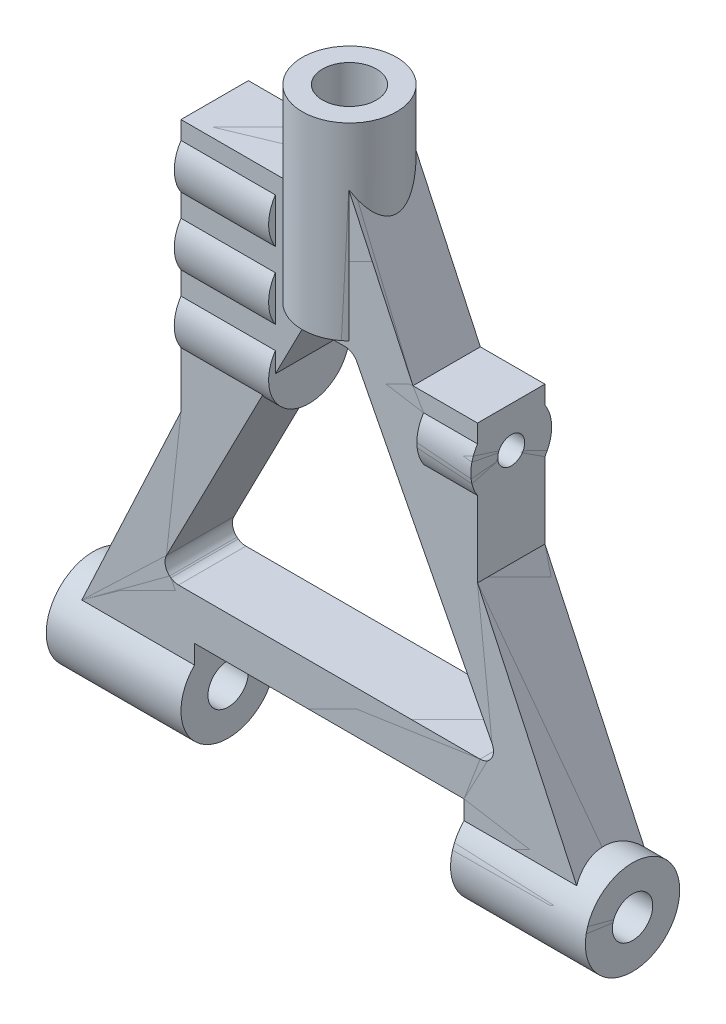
ISO-10303-21;
HEADER;
FILE_DESCRIPTION(('STEP AP214'),'2;1');
FILE_NAME('part.step','',(''),(''),'','','');
FILE_SCHEMA(('AUTOMOTIVE_DESIGN { 1 0 10303 214 1 1 1 1 }'));
ENDSEC;
DATA;
#1=APPLICATION_CONTEXT('core data for automotive mechanical design processes');
#2=APPLICATION_PROTOCOL_DEFINITION('international standard','automotive_design',2000,#1);
#3=PRODUCT_CONTEXT('',#1,'mechanical');
#4=PRODUCT('Part','Part','',(#3));
#5=PRODUCT_RELATED_PRODUCT_CATEGORY('part','',(#4));
#6=PRODUCT_DEFINITION_FORMATION('','',#4);
#7=PRODUCT_DEFINITION_CONTEXT('part definition',#1,'design');
#8=PRODUCT_DEFINITION('design','',#6,#7);
#9=PRODUCT_DEFINITION_SHAPE('','',#8);
#10=(LENGTH_UNIT() NAMED_UNIT(*) SI_UNIT(.MILLI.,.METRE.));
#11=(NAMED_UNIT(*) PLANE_ANGLE_UNIT() SI_UNIT($,.RADIAN.));
#12=(NAMED_UNIT(*) SI_UNIT($,.STERADIAN.) SOLID_ANGLE_UNIT());
#13=UNCERTAINTY_MEASURE_WITH_UNIT(LENGTH_MEASURE(1.E-05),#10,'distance_accuracy_value','');
#14=(GEOMETRIC_REPRESENTATION_CONTEXT(3) GLOBAL_UNCERTAINTY_ASSIGNED_CONTEXT((#13)) GLOBAL_UNIT_ASSIGNED_CONTEXT((#10,
#11,#12)) REPRESENTATION_CONTEXT('',''));
#15=CARTESIAN_POINT('',(0.,0.,0.));
#16=DIRECTION('',(0.,0.,1.));
#17=DIRECTION('',(1.,0.,0.));
#18=AXIS2_PLACEMENT_3D('',#15,#16,#17);
#19=CARTESIAN_POINT('',(-19.5,33.05078125,-2.));
#20=DIRECTION('',(0.,-1.,0.));
#21=DIRECTION('',(0.,0.,1.));
#22=AXIS2_PLACEMENT_3D('',#19,#20,#21);
#23=PLANE('',#22);
#24=CARTESIAN_POINT('',(-21.5,33.05078125,0.));
#25=DIRECTION('',(0.,1.,0.));
#26=DIRECTION('',(0.,0.,1.));
#27=AXIS2_PLACEMENT_3D('',#24,#25,#26);
#28=CIRCLE('',#27,2.);
#29=CARTESIAN_POINT('',(-21.5,33.05078125,2.));
#30=VERTEX_POINT('',#29);
#31=EDGE_CURVE('P0_E781',#30,#30,#28,.F.);
#32=ORIENTED_EDGE('',*,*,#31,.F.);
#33=EDGE_LOOP('',(#32));
#34=FACE_BOUND('',#33,.T.);
#35=ADVANCED_FACE('P0_F350',(#34),#23,.F.);
#36=CARTESIAN_POINT('',(-14.5,26.55078125,-1.));
#37=DIRECTION('',(-1.,0.,0.));
#38=DIRECTION('',(0.,0.,1.));
#39=AXIS2_PLACEMENT_3D('',#36,#37,#38);
#40=PLANE('',#39);
#41=CARTESIAN_POINT('',(-14.5,27.55078125,0.));
#42=DIRECTION('',(1.,0.,0.));
#43=DIRECTION('',(0.,0.,-1.));
#44=AXIS2_PLACEMENT_3D('',#41,#42,#43);
#45=CIRCLE('',#44,1.);
#46=CARTESIAN_POINT('',(-14.5,27.55078125,-1.));
#47=VERTEX_POINT('',#46);
#48=EDGE_CURVE('P0_E774',#47,#47,#45,.F.);
#49=ORIENTED_EDGE('',*,*,#48,.F.);
#50=EDGE_LOOP('',(#49));
#51=FACE_BOUND('',#50,.T.);
#52=ADVANCED_FACE('P0_F789',(#51),#40,.F.);
#53=CARTESIAN_POINT('',(-21.5,33.05078125,0.));
#54=DIRECTION('',(0.,1.,0.));
#55=DIRECTION('',(0.,0.,1.));
#56=AXIS2_PLACEMENT_3D('',#53,#54,#55);
#57=CYLINDRICAL_SURFACE('',#56,2.);
#58=ORIENTED_EDGE('',*,*,#31,.T.);
#59=EDGE_LOOP('',(#58));
#60=FACE_BOUND('',#59,.T.);
#61=CARTESIAN_POINT('',(-21.5,45.05078125,0.));
#62=DIRECTION('',(0.,1.,0.));
#63=DIRECTION('',(0.,0.,1.));
#64=AXIS2_PLACEMENT_3D('',#61,#62,#63);
#65=CIRCLE('',#64,2.);
#66=CARTESIAN_POINT('',(-21.5,45.05078125,2.));
#67=VERTEX_POINT('',#66);
#68=EDGE_CURVE('P0_E771',#67,#67,#65,.F.);
#69=ORIENTED_EDGE('',*,*,#68,.F.);
#70=EDGE_LOOP('',(#69));
#71=FACE_BOUND('',#70,.T.);
#72=ADVANCED_FACE('P0_F785',(#60,#71),#57,.F.);
#73=CARTESIAN_POINT('',(-26.5,37.05078125,-1.));
#74=DIRECTION('',(1.,0.,0.));
#75=DIRECTION('',(0.,0.,1.));
#76=AXIS2_PLACEMENT_3D('',#73,#74,#75);
#77=PLANE('',#76);
#78=CARTESIAN_POINT('',(-26.5,36.05078125,0.));
#79=DIRECTION('',(-1.,0.,0.));
#80=DIRECTION('',(0.,-1.,0.));
#81=AXIS2_PLACEMENT_3D('',#78,#79,#80);
#82=CIRCLE('',#81,1.);
#83=CARTESIAN_POINT('',(-26.5,35.05078125,0.));
#84=VERTEX_POINT('',#83);
#85=EDGE_CURVE('P0_E760',#84,#84,#82,.F.);
#86=ORIENTED_EDGE('',*,*,#85,.F.);
#87=EDGE_LOOP('',(#86));
#88=FACE_BOUND('',#87,.T.);
#89=ADVANCED_FACE('P0_F1371',(#88),#77,.F.);
#90=CARTESIAN_POINT('',(-26.5,32.05078125,-1.));
#91=DIRECTION('',(1.,0.,0.));
#92=DIRECTION('',(0.,0.,1.));
#93=AXIS2_PLACEMENT_3D('',#90,#91,#92);
#94=PLANE('',#93);
#95=CARTESIAN_POINT('',(-26.5,31.05078125,0.));
#96=DIRECTION('',(-1.,0.,0.));
#97=DIRECTION('',(0.,-1.,0.));
#98=AXIS2_PLACEMENT_3D('',#95,#96,#97);
#99=CIRCLE('',#98,1.);
#100=CARTESIAN_POINT('',(-26.5,30.05078125,0.));
#101=VERTEX_POINT('',#100);
#102=EDGE_CURVE('P0_E755',#101,#101,#99,.F.);
#103=ORIENTED_EDGE('',*,*,#102,.F.);
#104=EDGE_LOOP('',(#103));
#105=FACE_BOUND('',#104,.T.);
#106=ADVANCED_FACE('P0_F1323',(#105),#94,.F.);
#107=CARTESIAN_POINT('',(-26.5,27.05078125,-1.));
#108=DIRECTION('',(1.,0.,0.));
#109=DIRECTION('',(0.,0.,1.));
#110=AXIS2_PLACEMENT_3D('',#107,#108,#109);
#111=PLANE('',#110);
#112=CARTESIAN_POINT('',(-26.5,26.05078125,0.));
#113=DIRECTION('',(-1.,0.,0.));
#114=DIRECTION('',(0.,-1.,0.));
#115=AXIS2_PLACEMENT_3D('',#112,#113,#114);
#116=CIRCLE('',#115,1.);
#117=CARTESIAN_POINT('',(-26.5,25.05078125,0.));
#118=VERTEX_POINT('',#117);
#119=EDGE_CURVE('P0_E750',#118,#118,#116,.F.);
#120=ORIENTED_EDGE('',*,*,#119,.F.);
#121=EDGE_LOOP('',(#120));
#122=FACE_BOUND('',#121,.T.);
#123=ADVANCED_FACE('P0_F1314',(#122),#111,.F.);
#124=CARTESIAN_POINT('',(-24.5,37.709093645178,-3.60000000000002));
#125=DIRECTION('',(1.,0.,0.));
#126=DIRECTION('',(0.,0.,1.));
#127=AXIS2_PLACEMENT_3D('',#124,#125,#126);
#128=PLANE('',#127);
#129=CARTESIAN_POINT('',(-24.5,31.05078125,0.));
#130=DIRECTION('',(-1.,0.,0.));
#131=DIRECTION('',(0.,-1.,0.));
#132=AXIS2_PLACEMENT_3D('',#129,#130,#131);
#133=CIRCLE('',#132,3.);
#134=CARTESIAN_POINT('',(-24.4999999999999,29.3924688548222,-2.5));
#135=VERTEX_POINT('',#134);
#136=CARTESIAN_POINT('',(-24.4999999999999,32.7090936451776,-2.5));
#137=VERTEX_POINT('',#136);
#138=EDGE_CURVE('P0_E765',#135,#137,#133,.F.);
#139=ORIENTED_EDGE('',*,*,#138,.T.);
#140=DIRECTION('',(0.,1.,0.));
#141=VECTOR('',#140,1.);
#142=CARTESIAN_POINT('',(-24.4999999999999,22.8580551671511,-2.5));
#143=LINE('',#142,#141);
#144=EDGE_CURVE('P0_E977',#135,#137,#143,.T.);
#145=ORIENTED_EDGE('',*,*,#144,.F.);
#146=EDGE_LOOP('',(#139,#145));
#147=FACE_BOUND('',#146,.T.);
#148=ADVANCED_FACE('P0_F1311',(#147),#128,.T.);
#149=CARTESIAN_POINT('',(-24.5,37.709093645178,-3.60000000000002));
#150=DIRECTION('',(1.,0.,0.));
#151=DIRECTION('',(0.,0.,1.));
#152=AXIS2_PLACEMENT_3D('',#149,#150,#151);
#153=PLANE('',#152);
#154=CARTESIAN_POINT('',(-24.5,36.05078125,0.));
#155=DIRECTION('',(-1.,0.,0.));
#156=DIRECTION('',(0.,0.,1.));
#157=AXIS2_PLACEMENT_3D('',#154,#155,#156);
#158=CIRCLE('',#157,3.);
#159=CARTESIAN_POINT('',(-24.4999999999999,34.3924688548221,-2.5));
#160=VERTEX_POINT('',#159);
#161=CARTESIAN_POINT('',(-24.4999999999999,37.7090936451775,-2.5));
#162=VERTEX_POINT('',#161);
#163=EDGE_CURVE('P0_E769',#160,#162,#158,.F.);
#164=ORIENTED_EDGE('',*,*,#163,.T.);
#165=DIRECTION('',(0.,1.,0.));
#166=VECTOR('',#165,1.);
#167=CARTESIAN_POINT('',(-24.4999999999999,22.8580551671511,-2.5));
#168=LINE('',#167,#166);
#169=EDGE_CURVE('P0_E981',#160,#162,#168,.T.);
#170=ORIENTED_EDGE('',*,*,#169,.F.);
#171=EDGE_LOOP('',(#164,#170));
#172=FACE_BOUND('',#171,.T.);
#173=ADVANCED_FACE('P0_F1313',(#172),#153,.T.);
#174=CARTESIAN_POINT('',(-13.5,25.892468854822,-3.));
#175=DIRECTION('',(-1.,0.,0.));
#176=DIRECTION('',(0.,0.,1.));
#177=AXIS2_PLACEMENT_3D('',#174,#175,#176);
#178=PLANE('',#177);
#179=DIRECTION('',(0.,-1.,0.));
#180=VECTOR('',#179,1.);
#181=CARTESIAN_POINT('',(-13.5000000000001,22.8580551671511,-2.5));
#182=LINE('',#181,#180);
#183=CARTESIAN_POINT('',(-13.5,29.2090936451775,-2.5));
#184=VERTEX_POINT('',#183);
#185=CARTESIAN_POINT('',(-13.5,25.8924688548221,-2.5));
#186=VERTEX_POINT('',#185);
#187=EDGE_CURVE('P0_E1012',#184,#186,#182,.T.);
#188=ORIENTED_EDGE('',*,*,#187,.F.);
#189=CARTESIAN_POINT('',(-13.5,27.55078125,0.));
#190=DIRECTION('',(1.,0.,0.));
#191=DIRECTION('',(0.,1.,0.));
#192=AXIS2_PLACEMENT_3D('',#189,#190,#191);
#193=CIRCLE('',#192,3.);
#194=EDGE_CURVE('P0_E550',#184,#186,#193,.F.);
#195=ORIENTED_EDGE('',*,*,#194,.T.);
#196=EDGE_LOOP('',(#188,#195));
#197=FACE_BOUND('',#196,.T.);
#198=ADVANCED_FACE('P0_F1320',(#197),#178,.T.);
#199=CARTESIAN_POINT('',(-13.5,27.55078125,0.));
#200=DIRECTION('',(1.,0.,0.));
#201=DIRECTION('',(0.,1.,0.));
#202=AXIS2_PLACEMENT_3D('',#199,#200,#201);
#203=CYLINDRICAL_SURFACE('',#202,3.);
#204=CARTESIAN_POINT('',(-9.5,27.55078125,0.));
#205=DIRECTION('',(1.,0.,0.));
#206=DIRECTION('',(0.,1.,0.));
#207=AXIS2_PLACEMENT_3D('',#204,#205,#206);
#208=CIRCLE('',#207,3.);
#209=CARTESIAN_POINT('',(-9.5,25.8924688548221,-2.5));
#210=VERTEX_POINT('',#209);
#211=CARTESIAN_POINT('',(-9.5,29.2090936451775,-2.5));
#212=VERTEX_POINT('',#211);
#213=EDGE_CURVE('P0_E731',#210,#212,#208,.T.);
#214=ORIENTED_EDGE('',*,*,#213,.F.);
#215=DIRECTION('',(1.,0.,0.));
#216=VECTOR('',#215,1.);
#217=CARTESIAN_POINT('',(-20.4999999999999,25.892468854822,-2.5));
#218=LINE('',#217,#216);
#219=EDGE_CURVE('P0_E743',#186,#210,#218,.T.);
#220=ORIENTED_EDGE('',*,*,#219,.F.);
#221=ORIENTED_EDGE('',*,*,#194,.F.);
#222=DIRECTION('',(-1.,0.,0.));
#223=VECTOR('',#222,1.);
#224=CARTESIAN_POINT('',(-20.4999999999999,29.2090936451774,-2.5));
#225=LINE('',#224,#223);
#226=EDGE_CURVE('P0_E999',#212,#184,#225,.T.);
#227=ORIENTED_EDGE('',*,*,#226,.F.);
#228=EDGE_LOOP('',(#214,#220,#221,#227));
#229=FACE_BOUND('',#228,.T.);
#230=ADVANCED_FACE('P0_F1330',(#229),#203,.T.);
#231=CARTESIAN_POINT('',(-14.5,27.55078125,0.));
#232=DIRECTION('',(1.,0.,0.));
#233=DIRECTION('',(0.,0.,-1.));
#234=AXIS2_PLACEMENT_3D('',#231,#232,#233);
#235=CYLINDRICAL_SURFACE('',#234,1.);
#236=ORIENTED_EDGE('',*,*,#48,.T.);
#237=EDGE_LOOP('',(#236));
#238=FACE_BOUND('',#237,.T.);
#239=CARTESIAN_POINT('',(-9.5,27.55078125,0.));
#240=DIRECTION('',(1.,0.,0.));
#241=DIRECTION('',(0.,0.,-1.));
#242=AXIS2_PLACEMENT_3D('',#239,#240,#241);
#243=CIRCLE('',#242,1.);
#244=CARTESIAN_POINT('',(-9.5,27.55078125,-1.));
#245=VERTEX_POINT('',#244);
#246=EDGE_CURVE('P0_E724',#245,#245,#243,.F.);
#247=ORIENTED_EDGE('',*,*,#246,.F.);
#248=EDGE_LOOP('',(#247));
#249=FACE_BOUND('',#248,.T.);
#250=ADVANCED_FACE('P0_F1335',(#238,#249),#235,.F.);
#251=CARTESIAN_POINT('',(-19.050510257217,31.05078125,-3.5));
#252=DIRECTION('',(0.,-1.,0.));
#253=DIRECTION('',(0.,0.,1.));
#254=AXIS2_PLACEMENT_3D('',#251,#252,#253);
#255=PLANE('',#254);
#256=DIRECTION('',(1.,0.,0.));
#257=VECTOR('',#256,1.);
#258=CARTESIAN_POINT('',(-20.4999999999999,31.0507812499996,-2.5));
#259=LINE('',#258,#257);
#260=CARTESIAN_POINT('',(-23.9494897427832,31.0507812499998,-2.5));
#261=VERTEX_POINT('',#260);
#262=CARTESIAN_POINT('',(-19.0505102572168,31.0507812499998,-2.49999999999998));
#263=VERTEX_POINT('',#262);
#264=EDGE_CURVE('P0_E986',#261,#263,#259,.T.);
#265=ORIENTED_EDGE('',*,*,#264,.F.);
#266=CARTESIAN_POINT('',(-21.5,31.05078125,0.));
#267=DIRECTION('',(0.,1.,0.));
#268=DIRECTION('',(0.,0.,1.));
#269=AXIS2_PLACEMENT_3D('',#266,#267,#268);
#270=CIRCLE('',#269,3.5);
#271=EDGE_CURVE('P0_E714',#261,#263,#270,.F.);
#272=ORIENTED_EDGE('',*,*,#271,.T.);
#273=EDGE_LOOP('',(#265,#272));
#274=FACE_BOUND('',#273,.T.);
#275=ADVANCED_FACE('P0_F1331',(#274),#255,.T.);
#276=CARTESIAN_POINT('',(-18.,45.05078125,3.5));
#277=DIRECTION('',(0.,1.,0.));
#278=DIRECTION('',(0.,0.,-1.));
#279=AXIS2_PLACEMENT_3D('',#276,#277,#278);
#280=PLANE('',#279);
#281=ORIENTED_EDGE('',*,*,#68,.T.);
#282=EDGE_LOOP('',(#281));
#283=FACE_BOUND('',#282,.T.);
#284=CARTESIAN_POINT('',(-21.5,45.05078125,0.));
#285=DIRECTION('',(0.,1.,0.));
#286=DIRECTION('',(0.,0.,1.));
#287=AXIS2_PLACEMENT_3D('',#284,#285,#286);
#288=CIRCLE('',#287,3.5);
#289=CARTESIAN_POINT('',(-21.5,45.05078125,3.5));
#290=VERTEX_POINT('',#289);
#291=EDGE_CURVE('P0_E711',#290,#290,#288,.T.);
#292=ORIENTED_EDGE('',*,*,#291,.T.);
#293=EDGE_LOOP('',(#292));
#294=FACE_BOUND('',#293,.T.);
#295=ADVANCED_FACE('P0_F1334',(#283,#294),#280,.T.);
#296=CARTESIAN_POINT('',(-24.5,36.05078125,0.));
#297=DIRECTION('',(-1.,0.,0.));
#298=DIRECTION('',(0.,0.,1.));
#299=AXIS2_PLACEMENT_3D('',#296,#297,#298);
#300=CYLINDRICAL_SURFACE('',#299,3.);
#301=DIRECTION('',(-1.,0.,0.));
#302=VECTOR('',#301,1.);
#303=CARTESIAN_POINT('',(-20.4999999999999,37.7090936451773,-2.5));
#304=LINE('',#303,#302);
#305=CARTESIAN_POINT('',(-31.5,37.7090936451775,-2.50000000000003));
#306=VERTEX_POINT('',#305);
#307=EDGE_CURVE('P0_E984',#162,#306,#304,.T.);
#308=ORIENTED_EDGE('',*,*,#307,.F.);
#309=ORIENTED_EDGE('',*,*,#163,.F.);
#310=DIRECTION('',(1.,0.,0.));
#311=VECTOR('',#310,1.);
#312=CARTESIAN_POINT('',(-20.4999999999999,34.392468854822,-2.5));
#313=LINE('',#312,#311);
#314=CARTESIAN_POINT('',(-31.5,34.3924688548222,-2.50000000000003));
#315=VERTEX_POINT('',#314);
#316=EDGE_CURVE('P0_E978',#315,#160,#313,.T.);
#317=ORIENTED_EDGE('',*,*,#316,.F.);
#318=CARTESIAN_POINT('',(-31.5,36.05078125,0.));
#319=DIRECTION('',(-1.,0.,0.));
#320=DIRECTION('',(0.,0.,1.));
#321=AXIS2_PLACEMENT_3D('',#318,#319,#320);
#322=CIRCLE('',#321,3.);
#323=EDGE_CURVE('P0_E667',#306,#315,#322,.T.);
#324=ORIENTED_EDGE('',*,*,#323,.F.);
#325=EDGE_LOOP('',(#308,#309,#317,#324));
#326=FACE_BOUND('',#325,.T.);
#327=ADVANCED_FACE('P0_F1296',(#326),#300,.T.);
#328=CARTESIAN_POINT('',(-24.5,31.05078125,0.));
#329=DIRECTION('',(-1.,0.,0.));
#330=DIRECTION('',(0.,-1.,0.));
#331=AXIS2_PLACEMENT_3D('',#328,#329,#330);
#332=CYLINDRICAL_SURFACE('',#331,3.);
#333=DIRECTION('',(-1.,0.,0.));
#334=VECTOR('',#333,1.);
#335=CARTESIAN_POINT('',(-20.4999999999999,32.7090936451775,-2.5));
#336=LINE('',#335,#334);
#337=CARTESIAN_POINT('',(-31.5,32.7090936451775,-2.50000000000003));
#338=VERTEX_POINT('',#337);
#339=EDGE_CURVE('P0_E982',#137,#338,#336,.T.);
#340=ORIENTED_EDGE('',*,*,#339,.F.);
#341=ORIENTED_EDGE('',*,*,#138,.F.);
#342=DIRECTION('',(1.,0.,0.));
#343=VECTOR('',#342,1.);
#344=CARTESIAN_POINT('',(-20.4999999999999,29.3924688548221,-2.5));
#345=LINE('',#344,#343);
#346=CARTESIAN_POINT('',(-31.5,29.3924688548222,-2.50000000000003));
#347=VERTEX_POINT('',#346);
#348=EDGE_CURVE('P0_E749',#347,#135,#345,.T.);
#349=ORIENTED_EDGE('',*,*,#348,.F.);
#350=CARTESIAN_POINT('',(-31.5,31.05078125,0.));
#351=DIRECTION('',(-1.,0.,0.));
#352=DIRECTION('',(0.,-1.,0.));
#353=AXIS2_PLACEMENT_3D('',#350,#351,#352);
#354=CIRCLE('',#353,3.);
#355=EDGE_CURVE('P0_E663',#338,#347,#354,.T.);
#356=ORIENTED_EDGE('',*,*,#355,.F.);
#357=EDGE_LOOP('',(#340,#341,#349,#356));
#358=FACE_BOUND('',#357,.T.);
#359=ADVANCED_FACE('P0_F1302',(#358),#332,.T.);
#360=CARTESIAN_POINT('',(-26.5,36.05078125,0.));
#361=DIRECTION('',(-1.,0.,0.));
#362=DIRECTION('',(0.,-1.,0.));
#363=AXIS2_PLACEMENT_3D('',#360,#361,#362);
#364=CYLINDRICAL_SURFACE('',#363,1.);
#365=ORIENTED_EDGE('',*,*,#85,.T.);
#366=EDGE_LOOP('',(#365));
#367=FACE_BOUND('',#366,.T.);
#368=CARTESIAN_POINT('',(-31.5,36.05078125,0.));
#369=DIRECTION('',(-1.,0.,0.));
#370=DIRECTION('',(0.,-1.,0.));
#371=AXIS2_PLACEMENT_3D('',#368,#369,#370);
#372=CIRCLE('',#371,1.);
#373=CARTESIAN_POINT('',(-31.5,35.05078125,0.));
#374=VERTEX_POINT('',#373);
#375=EDGE_CURVE('P0_E651',#374,#374,#372,.F.);
#376=ORIENTED_EDGE('',*,*,#375,.F.);
#377=EDGE_LOOP('',(#376));
#378=FACE_BOUND('',#377,.T.);
#379=ADVANCED_FACE('P0_F1353',(#367,#378),#364,.F.);
#380=CARTESIAN_POINT('',(-26.5,31.05078125,0.));
#381=DIRECTION('',(-1.,0.,0.));
#382=DIRECTION('',(0.,-1.,0.));
#383=AXIS2_PLACEMENT_3D('',#380,#381,#382);
#384=CYLINDRICAL_SURFACE('',#383,1.);
#385=ORIENTED_EDGE('',*,*,#102,.T.);
#386=EDGE_LOOP('',(#385));
#387=FACE_BOUND('',#386,.T.);
#388=CARTESIAN_POINT('',(-31.5,31.05078125,0.));
#389=DIRECTION('',(-1.,0.,0.));
#390=DIRECTION('',(0.,-1.,0.));
#391=AXIS2_PLACEMENT_3D('',#388,#389,#390);
#392=CIRCLE('',#391,1.);
#393=CARTESIAN_POINT('',(-31.5,30.05078125,0.));
#394=VERTEX_POINT('',#393);
#395=EDGE_CURVE('P0_E646',#394,#394,#392,.F.);
#396=ORIENTED_EDGE('',*,*,#395,.F.);
#397=EDGE_LOOP('',(#396));
#398=FACE_BOUND('',#397,.T.);
#399=ADVANCED_FACE('P0_F1345',(#387,#398),#384,.F.);
#400=CARTESIAN_POINT('',(-26.5,26.05078125,0.));
#401=DIRECTION('',(-1.,0.,0.));
#402=DIRECTION('',(0.,-1.,0.));
#403=AXIS2_PLACEMENT_3D('',#400,#401,#402);
#404=CYLINDRICAL_SURFACE('',#403,1.);
#405=ORIENTED_EDGE('',*,*,#119,.T.);
#406=EDGE_LOOP('',(#405));
#407=FACE_BOUND('',#406,.T.);
#408=CARTESIAN_POINT('',(-31.5,26.05078125,0.));
#409=DIRECTION('',(-1.,0.,0.));
#410=DIRECTION('',(0.,-1.,0.));
#411=AXIS2_PLACEMENT_3D('',#408,#409,#410);
#412=CIRCLE('',#411,1.);
#413=CARTESIAN_POINT('',(-31.5,25.05078125,0.));
#414=VERTEX_POINT('',#413);
#415=EDGE_CURVE('P0_E642',#414,#414,#412,.F.);
#416=ORIENTED_EDGE('',*,*,#415,.F.);
#417=EDGE_LOOP('',(#416));
#418=FACE_BOUND('',#417,.T.);
#419=ADVANCED_FACE('P0_F1340',(#407,#418),#404,.F.);
#420=CARTESIAN_POINT('',(-40.5,5.55078125,-3.5));
#421=DIRECTION('',(-1.,0.,0.));
#422=DIRECTION('',(0.,-1.,0.));
#423=AXIS2_PLACEMENT_3D('',#420,#421,#422);
#424=PLANE('',#423);
#425=CARTESIAN_POINT('',(-40.5,2.05078125,0.));
#426=DIRECTION('',(-1.,0.,0.));
#427=DIRECTION('',(0.,0.,1.));
#428=AXIS2_PLACEMENT_3D('',#425,#426,#427);
#429=CIRCLE('',#428,1.5);
#430=CARTESIAN_POINT('',(-40.5,2.05078125,1.50000000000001));
#431=VERTEX_POINT('',#430);
#432=EDGE_CURVE('P0_E746',#431,#431,#429,.T.);
#433=ORIENTED_EDGE('',*,*,#432,.F.);
#434=EDGE_LOOP('',(#433));
#435=FACE_BOUND('',#434,.T.);
#436=CARTESIAN_POINT('',(-40.5,2.05078125,0.));
#437=DIRECTION('',(1.,0.,0.));
#438=DIRECTION('',(0.,0.,-1.));
#439=AXIS2_PLACEMENT_3D('',#436,#437,#438);
#440=CIRCLE('',#439,3.5);
#441=CARTESIAN_POINT('',(-40.5,2.05078125,-3.5));
#442=VERTEX_POINT('',#441);
#443=EDGE_CURVE('P0_E634',#442,#442,#440,.F.);
#444=ORIENTED_EDGE('',*,*,#443,.T.);
#445=EDGE_LOOP('',(#444));
#446=FACE_BOUND('',#445,.T.);
#447=ADVANCED_FACE('P0_F1160',(#435,#446),#424,.T.);
#448=CARTESIAN_POINT('',(-30.5,2.05078125,0.));
#449=DIRECTION('',(-1.,0.,0.));
#450=DIRECTION('',(0.,0.,1.));
#451=AXIS2_PLACEMENT_3D('',#448,#449,#450);
#452=CYLINDRICAL_SURFACE('',#451,1.5);
#453=CARTESIAN_POINT('',(-30.5,2.05078125,0.));
#454=DIRECTION('',(-1.,0.,0.));
#455=DIRECTION('',(0.,0.,1.));
#456=AXIS2_PLACEMENT_3D('',#453,#454,#455);
#457=CIRCLE('',#456,1.5);
#458=CARTESIAN_POINT('',(-30.5,2.05078125,1.5));
#459=VERTEX_POINT('',#458);
#460=EDGE_CURVE('P0_E625',#459,#459,#457,.F.);
#461=ORIENTED_EDGE('',*,*,#460,.T.);
#462=EDGE_LOOP('',(#461));
#463=FACE_BOUND('',#462,.T.);
#464=ORIENTED_EDGE('',*,*,#432,.T.);
#465=EDGE_LOOP('',(#464));
#466=FACE_BOUND('',#465,.T.);
#467=ADVANCED_FACE('P0_F1154',(#463,#466),#452,.F.);
#468=CARTESIAN_POINT('',(-0.5,2.05078125,0.));
#469=DIRECTION('',(-1.,0.,0.));
#470=DIRECTION('',(0.,0.,1.));
#471=AXIS2_PLACEMENT_3D('',#468,#469,#470);
#472=CYLINDRICAL_SURFACE('',#471,1.5);
#473=CARTESIAN_POINT('',(-10.5,2.05078125,0.));
#474=DIRECTION('',(-1.,0.,0.));
#475=DIRECTION('',(0.,0.,1.));
#476=AXIS2_PLACEMENT_3D('',#473,#474,#475);
#477=CIRCLE('',#476,1.5);
#478=CARTESIAN_POINT('',(-10.5,2.05078125,1.5));
#479=VERTEX_POINT('',#478);
#480=EDGE_CURVE('P0_E606',#479,#479,#477,.T.);
#481=ORIENTED_EDGE('',*,*,#480,.T.);
#482=EDGE_LOOP('',(#481));
#483=FACE_BOUND('',#482,.T.);
#484=CARTESIAN_POINT('',(-0.5,2.05078125,0.));
#485=DIRECTION('',(-1.,0.,0.));
#486=DIRECTION('',(0.,0.,1.));
#487=AXIS2_PLACEMENT_3D('',#484,#485,#486);
#488=CIRCLE('',#487,1.5);
#489=CARTESIAN_POINT('',(-0.5,2.05078125,1.5));
#490=VERTEX_POINT('',#489);
#491=EDGE_CURVE('P0_E740',#490,#490,#488,.T.);
#492=ORIENTED_EDGE('',*,*,#491,.F.);
#493=EDGE_LOOP('',(#492));
#494=FACE_BOUND('',#493,.T.);
#495=ADVANCED_FACE('P0_F1062',(#483,#494),#472,.F.);
#496=CARTESIAN_POINT('',(-2.1422158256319,4.5002709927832,-2.5));
#497=DIRECTION('',(0.,0.,-1.));
#498=DIRECTION('',(-1.,0.,0.));
#499=AXIS2_PLACEMENT_3D('',#496,#497,#498);
#500=PLANE('',#499);
#501=DIRECTION('',(0.,-1.,0.));
#502=VECTOR('',#501,1.);
#503=CARTESIAN_POINT('',(-30.5,1.50882648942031,-2.5));
#504=LINE('',#503,#502);
#505=CARTESIAN_POINT('',(-30.5,5.8998677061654,-2.5));
#506=VERTEX_POINT('',#505);
#507=CARTESIAN_POINT('',(-30.5,4.50027099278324,-2.49999999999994));
#508=VERTEX_POINT('',#507);
#509=EDGE_CURVE('P0_E633',#506,#508,#504,.T.);
#510=ORIENTED_EDGE('',*,*,#509,.T.);
#511=DIRECTION('',(-1.,0.,0.));
#512=VECTOR('',#511,1.);
#513=CARTESIAN_POINT('',(-20.5,4.5002709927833,-2.49999999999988));
#514=LINE('',#513,#512);
#515=CARTESIAN_POINT('',(-38.857784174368,4.50027099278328,-2.4999999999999));
#516=VERTEX_POINT('',#515);
#517=EDGE_CURVE('P0_E641',#508,#516,#514,.T.);
#518=ORIENTED_EDGE('',*,*,#517,.T.);
#519=DIRECTION('',(-0.422618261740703,-0.906307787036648,0.));
#520=VECTOR('',#519,1.);
#521=CARTESIAN_POINT('',(-35.178892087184,12.3896805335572,-2.49999999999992));
#522=LINE('',#521,#520);
#523=CARTESIAN_POINT('',(-31.5,20.279090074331,-2.49999999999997));
#524=VERTEX_POINT('',#523);
#525=EDGE_CURVE('P0_E832',#524,#516,#522,.T.);
#526=ORIENTED_EDGE('',*,*,#525,.F.);
#527=DIRECTION('',(0.,-1.,0.));
#528=VECTOR('',#527,1.);
#529=CARTESIAN_POINT('',(-31.5,29.6649356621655,-2.50000000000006));
#530=LINE('',#529,#528);
#531=CARTESIAN_POINT('',(-31.5,24.3924688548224,-2.50000000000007));
#532=VERTEX_POINT('',#531);
#533=EDGE_CURVE('P0_E656',#532,#524,#530,.T.);
#534=ORIENTED_EDGE('',*,*,#533,.F.);
#535=DIRECTION('',(1.,0.,0.));
#536=VECTOR('',#535,1.);
#537=CARTESIAN_POINT('',(-28.,24.3924688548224,-2.50000000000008));
#538=LINE('',#537,#536);
#539=CARTESIAN_POINT('',(-25.4361400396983,24.3924688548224,-2.50000000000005));
#540=VERTEX_POINT('',#539);
#541=EDGE_CURVE('P0_E680',#532,#540,#538,.T.);
#542=ORIENTED_EDGE('',*,*,#541,.T.);
#543=DIRECTION('',(0.457241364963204,0.889342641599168,0.));
#544=VECTOR('',#543,1.);
#545=CARTESIAN_POINT('',(-27.5617997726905,20.258022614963,-2.50000000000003));
#546=LINE('',#545,#544);
#547=CARTESIAN_POINT('',(-32.574607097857,10.508022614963,-2.50000000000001));
#548=VERTEX_POINT('',#547);
#549=EDGE_CURVE('P0_E685',#548,#540,#546,.T.);
#550=ORIENTED_EDGE('',*,*,#549,.F.);
#551=CARTESIAN_POINT('',(-31.685264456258,10.05078125,-2.5));
#552=DIRECTION('',(0.,0.,-1.));
#553=DIRECTION('',(0.,1.,0.));
#554=AXIS2_PLACEMENT_3D('',#551,#552,#553);
#555=CIRCLE('',#554,1.00000000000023);
#556=CARTESIAN_POINT('',(-31.6852644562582,9.05078124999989,-2.5));
#557=VERTEX_POINT('',#556);
#558=EDGE_CURVE('P0_E686',#557,#548,#555,.T.);
#559=ORIENTED_EDGE('',*,*,#558,.F.);
#560=DIRECTION('',(-1.,0.,0.));
#561=VECTOR('',#560,1.);
#562=CARTESIAN_POINT('',(-20.5000000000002,9.05078125,-2.49999999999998));
#563=LINE('',#562,#561);
#564=CARTESIAN_POINT('',(-9.3147355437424,9.05078125,-2.49999999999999));
#565=VERTEX_POINT('',#564);
#566=EDGE_CURVE('P0_E846',#565,#557,#563,.T.);
#567=ORIENTED_EDGE('',*,*,#566,.F.);
#568=CARTESIAN_POINT('',(-9.3147355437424,10.05078125,-2.5));
#569=DIRECTION('',(0.,0.,-1.));
#570=DIRECTION('',(0.,1.,0.));
#571=AXIS2_PLACEMENT_3D('',#568,#569,#570);
#572=CIRCLE('',#571,0.999999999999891);
#573=CARTESIAN_POINT('',(-8.42539290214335,10.5080226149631,-2.5));
#574=VERTEX_POINT('',#573);
#575=EDGE_CURVE('P0_E690',#574,#565,#572,.T.);
#576=ORIENTED_EDGE('',*,*,#575,.F.);
#577=DIRECTION('',(0.457241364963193,-0.889342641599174,0.));
#578=VECTOR('',#577,1.);
#579=CARTESIAN_POINT('',(-13.4382002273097,20.258022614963,-2.50000000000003));
#580=LINE('',#579,#578);
#581=CARTESIAN_POINT('',(-18.451007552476,30.008022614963,-2.50000000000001));
#582=VERTEX_POINT('',#581);
#583=EDGE_CURVE('P0_E851',#582,#574,#580,.T.);
#584=ORIENTED_EDGE('',*,*,#583,.F.);
#585=CARTESIAN_POINT('',(-19.340350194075,29.55078125,-2.5));
#586=DIRECTION('',(0.,0.,-1.));
#587=DIRECTION('',(-1.,0.,0.));
#588=AXIS2_PLACEMENT_3D('',#585,#586,#587);
#589=CIRCLE('',#588,1.00000000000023);
#590=CARTESIAN_POINT('',(-19.3403501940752,30.5507812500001,-2.5));
#591=VERTEX_POINT('',#590);
#592=EDGE_CURVE('P0_E694',#591,#582,#589,.T.);
#593=ORIENTED_EDGE('',*,*,#592,.F.);
#594=DIRECTION('',(1.,0.,0.));
#595=VECTOR('',#594,1.);
#596=CARTESIAN_POINT('',(-19.159649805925,30.55078125,-2.5));
#597=LINE('',#596,#595);
#598=CARTESIAN_POINT('',(-21.659649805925,30.55078125,-2.5));
#599=VERTEX_POINT('',#598);
#600=EDGE_CURVE('P0_E856',#599,#591,#597,.T.);
#601=ORIENTED_EDGE('',*,*,#600,.F.);
#602=CARTESIAN_POINT('',(-21.659649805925,29.55078125,-2.5));
#603=DIRECTION('',(0.,0.,-1.));
#604=DIRECTION('',(-1.,0.,0.));
#605=AXIS2_PLACEMENT_3D('',#602,#603,#604);
#606=CIRCLE('',#605,1.00000000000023);
#607=CARTESIAN_POINT('',(-22.5489924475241,30.0080226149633,-2.5));
#608=VERTEX_POINT('',#607);
#609=EDGE_CURVE('P0_E698',#608,#599,#606,.T.);
#610=ORIENTED_EDGE('',*,*,#609,.F.);
#611=DIRECTION('',(0.457241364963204,0.889342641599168,0.));
#612=VECTOR('',#611,1.);
#613=CARTESIAN_POINT('',(-27.5617997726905,20.258022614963,-2.50000000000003));
#614=LINE('',#613,#612);
#615=CARTESIAN_POINT('',(-24.4999999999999,26.2132779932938,-2.50000000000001));
#616=VERTEX_POINT('',#615);
#617=EDGE_CURVE('P0_E861',#616,#608,#614,.T.);
#618=ORIENTED_EDGE('',*,*,#617,.F.);
#619=DIRECTION('',(0.,-1.,0.));
#620=VECTOR('',#619,1.);
#621=CARTESIAN_POINT('',(-24.5,29.8867898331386,-2.49999999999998));
#622=LINE('',#621,#620);
#623=CARTESIAN_POINT('',(-24.5,27.7090936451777,-2.49999999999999));
#624=VERTEX_POINT('',#623);
#625=EDGE_CURVE('P0_E704',#624,#616,#622,.T.);
#626=ORIENTED_EDGE('',*,*,#625,.F.);
#627=DIRECTION('',(-1.,0.,0.));
#628=VECTOR('',#627,1.);
#629=CARTESIAN_POINT('',(-28.,27.7090936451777,-2.49999999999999));
#630=LINE('',#629,#628);
#631=CARTESIAN_POINT('',(-31.5,27.7090936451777,-2.50000000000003));
#632=VERTEX_POINT('',#631);
#633=EDGE_CURVE('P0_E684',#624,#632,#630,.T.);
#634=ORIENTED_EDGE('',*,*,#633,.T.);
#635=DIRECTION('',(0.,-1.,0.));
#636=VECTOR('',#635,1.);
#637=CARTESIAN_POINT('',(-31.5,29.6649356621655,-2.50000000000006));
#638=LINE('',#637,#636);
#639=EDGE_CURVE('P0_E662',#347,#632,#638,.T.);
#640=ORIENTED_EDGE('',*,*,#639,.F.);
#641=ORIENTED_EDGE('',*,*,#348,.T.);
#642=ORIENTED_EDGE('',*,*,#144,.T.);
#643=ORIENTED_EDGE('',*,*,#339,.T.);
#644=DIRECTION('',(0.,-1.,0.));
#645=VECTOR('',#644,1.);
#646=CARTESIAN_POINT('',(-31.5,29.6649356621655,-2.50000000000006));
#647=LINE('',#646,#645);
#648=EDGE_CURVE('P0_E666',#315,#338,#647,.T.);
#649=ORIENTED_EDGE('',*,*,#648,.F.);
#650=ORIENTED_EDGE('',*,*,#316,.T.);
#651=ORIENTED_EDGE('',*,*,#169,.T.);
#652=ORIENTED_EDGE('',*,*,#307,.T.);
#653=DIRECTION('',(0.,-1.,0.));
#654=VECTOR('',#653,1.);
#655=CARTESIAN_POINT('',(-31.5,29.6649356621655,-2.50000000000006));
#656=LINE('',#655,#654);
#657=CARTESIAN_POINT('',(-31.5,39.05078125,-2.50000000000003));
#658=VERTEX_POINT('',#657);
#659=EDGE_CURVE('P0_E670',#658,#306,#656,.T.);
#660=ORIENTED_EDGE('',*,*,#659,.F.);
#661=DIRECTION('',(-1.,0.,0.));
#662=VECTOR('',#661,1.);
#663=CARTESIAN_POINT('',(-27.7247448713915,39.05078125,-2.49999999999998));
#664=LINE('',#663,#662);
#665=CARTESIAN_POINT('',(-23.9494897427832,39.05078125,-2.49999999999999));
#666=VERTEX_POINT('',#665);
#667=EDGE_CURVE('P0_E707',#666,#658,#664,.T.);
#668=ORIENTED_EDGE('',*,*,#667,.F.);
#669=DIRECTION('',(0.,-1.,0.));
#670=VECTOR('',#669,1.);
#671=CARTESIAN_POINT('',(-23.9494897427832,38.05078125,-2.5));
#672=LINE('',#671,#670);
#673=EDGE_CURVE('P0_E718',#666,#261,#672,.T.);
#674=ORIENTED_EDGE('',*,*,#673,.T.);
#675=ORIENTED_EDGE('',*,*,#264,.T.);
#676=DIRECTION('',(0.,1.,0.));
#677=VECTOR('',#676,1.);
#678=CARTESIAN_POINT('',(-19.0505102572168,38.05078125,-2.49999999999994));
#679=LINE('',#678,#677);
#680=CARTESIAN_POINT('',(-19.0505102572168,40.7602254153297,-2.50000000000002));
#681=VERTEX_POINT('',#680);
#682=EDGE_CURVE('P0_E723',#263,#681,#679,.T.);
#683=ORIENTED_EDGE('',*,*,#682,.T.);
#684=DIRECTION('',(-0.422618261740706,0.906307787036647,0.));
#685=VECTOR('',#684,1.);
#686=CARTESIAN_POINT('',(-10.5963630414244,22.6302482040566,-2.5000000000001));
#687=LINE('',#686,#685);
#688=CARTESIAN_POINT('',(-14.2897682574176,30.5507812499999,-2.50000000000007));
#689=VERTEX_POINT('',#688);
#690=EDGE_CURVE('P0_E925',#689,#681,#687,.T.);
#691=ORIENTED_EDGE('',*,*,#690,.F.);
#692=DIRECTION('',(-1.,0.,0.));
#693=VECTOR('',#692,1.);
#694=CARTESIAN_POINT('',(-12.,30.55078125,-2.5));
#695=LINE('',#694,#693);
#696=CARTESIAN_POINT('',(-9.5,30.55078125,-2.5));
#697=VERTEX_POINT('',#696);
#698=EDGE_CURVE('P0_E926',#697,#689,#695,.T.);
#699=ORIENTED_EDGE('',*,*,#698,.F.);
#700=DIRECTION('',(0.,1.,0.));
#701=VECTOR('',#700,1.);
#702=CARTESIAN_POINT('',(-9.5,25.4149356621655,-2.5));
#703=LINE('',#702,#701);
#704=EDGE_CURVE('P0_E728',#212,#697,#703,.T.);
#705=ORIENTED_EDGE('',*,*,#704,.F.);
#706=ORIENTED_EDGE('',*,*,#226,.T.);
#707=ORIENTED_EDGE('',*,*,#187,.T.);
#708=ORIENTED_EDGE('',*,*,#219,.T.);
#709=DIRECTION('',(0.,1.,0.));
#710=VECTOR('',#709,1.);
#711=CARTESIAN_POINT('',(-9.5,25.4149356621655,-2.5));
#712=LINE('',#711,#710);
#713=CARTESIAN_POINT('',(-9.5,20.279090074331,-2.50000000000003));
#714=VERTEX_POINT('',#713);
#715=EDGE_CURVE('P0_E734',#714,#210,#712,.T.);
#716=ORIENTED_EDGE('',*,*,#715,.F.);
#717=DIRECTION('',(-0.422618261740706,0.906307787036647,0.));
#718=VECTOR('',#717,1.);
#719=CARTESIAN_POINT('',(-10.5963630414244,22.6302482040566,-2.5000000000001));
#720=LINE('',#719,#718);
#721=CARTESIAN_POINT('',(-2.14221582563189,4.50027099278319,-2.49999999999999));
#722=VERTEX_POINT('',#721);
#723=EDGE_CURVE('P0_E558',#722,#714,#720,.T.);
#724=ORIENTED_EDGE('',*,*,#723,.F.);
#725=DIRECTION('',(-1.,0.,0.));
#726=VECTOR('',#725,1.);
#727=CARTESIAN_POINT('',(-20.5,4.5002709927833,-2.49999999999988));
#728=LINE('',#727,#726);
#729=CARTESIAN_POINT('',(-10.5,4.50027099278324,-2.49999999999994));
#730=VERTEX_POINT('',#729);
#731=EDGE_CURVE('P0_E601',#722,#730,#728,.T.);
#732=ORIENTED_EDGE('',*,*,#731,.T.);
#733=DIRECTION('',(0.,1.,0.));
#734=VECTOR('',#733,1.);
#735=CARTESIAN_POINT('',(-10.5,1.5088264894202,-2.5));
#736=LINE('',#735,#734);
#737=CARTESIAN_POINT('',(-10.5,5.8998677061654,-2.5));
#738=VERTEX_POINT('',#737);
#739=EDGE_CURVE('P0_E604',#730,#738,#736,.T.);
#740=ORIENTED_EDGE('',*,*,#739,.T.);
#741=DIRECTION('',(-1.,0.,0.));
#742=VECTOR('',#741,1.);
#743=CARTESIAN_POINT('',(-20.5,5.8998677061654,-2.5));
#744=LINE('',#743,#742);
#745=EDGE_CURVE('P0_E628',#738,#506,#744,.T.);
#746=ORIENTED_EDGE('',*,*,#745,.T.);
#747=EDGE_LOOP('',(#510,#518,#526,#534,#542,#550,#559,#567,#576,#584,#593,#601,#610,#618,#626,
#634,#640,#641,#642,#643,#649,#650,#651,#652,#660,#668,#674,#675,#683,#691,#699,#705,#706,#707,
#708,#716,#724,#732,#740,#746));
#748=FACE_BOUND('',#747,.T.);
#749=ADVANCED_FACE('P0_F602',(#748),#500,.T.);
#750=CARTESIAN_POINT('',(-0.5,-1.44921875,-3.5));
#751=DIRECTION('',(1.,0.,0.));
#752=DIRECTION('',(0.,1.,0.));
#753=AXIS2_PLACEMENT_3D('',#750,#751,#752);
#754=PLANE('',#753);
#755=ORIENTED_EDGE('',*,*,#491,.T.);
#756=EDGE_LOOP('',(#755));
#757=FACE_BOUND('',#756,.T.);
#758=CARTESIAN_POINT('',(-0.5,2.05078125,0.));
#759=DIRECTION('',(1.,0.,0.));
#760=DIRECTION('',(0.,0.,-1.));
#761=AXIS2_PLACEMENT_3D('',#758,#759,#760);
#762=CIRCLE('',#761,3.5);
#763=CARTESIAN_POINT('',(-0.5,2.05078125,-3.5));
#764=VERTEX_POINT('',#763);
#765=EDGE_CURVE('P0_E617',#764,#764,#762,.T.);
#766=ORIENTED_EDGE('',*,*,#765,.T.);
#767=EDGE_LOOP('',(#766));
#768=FACE_BOUND('',#767,.T.);
#769=ADVANCED_FACE('P0_F1051',(#757,#768),#754,.T.);
#770=CARTESIAN_POINT('',(-2.1422158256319,4.5002709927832,2.5));
#771=DIRECTION('',(0.906307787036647,0.422618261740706,0.));
#772=DIRECTION('',(0.,0.,-1.));
#773=AXIS2_PLACEMENT_3D('',#770,#771,#772);
#774=PLANE('',#773);
#775=ORIENTED_EDGE('',*,*,#723,.T.);
#776=DIRECTION('',(0.,0.,-1.));
#777=VECTOR('',#776,1.);
#778=CARTESIAN_POINT('',(-9.5,20.279090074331,-1.8358455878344));
#779=LINE('',#778,#777);
#780=CARTESIAN_POINT('',(-9.50000000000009,20.2790900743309,2.5));
#781=VERTEX_POINT('',#780);
#782=EDGE_CURVE('P0_E737',#781,#714,#779,.T.);
#783=ORIENTED_EDGE('',*,*,#782,.F.);
#784=DIRECTION('',(-0.422618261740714,0.906307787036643,0.));
#785=VECTOR('',#784,1.);
#786=CARTESIAN_POINT('',(-2.1422158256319,4.5002709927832,2.5));
#787=LINE('',#786,#785);
#788=CARTESIAN_POINT('',(-2.14221582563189,4.50027099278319,2.5));
#789=VERTEX_POINT('',#788);
#790=EDGE_CURVE('P0_E955',#789,#781,#787,.T.);
#791=ORIENTED_EDGE('',*,*,#790,.F.);
#792=CARTESIAN_POINT('',(-0.999999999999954,2.05078125,0.));
#793=DIRECTION('',(0.906307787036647,0.422618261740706,0.));
#794=DIRECTION('',(0.422618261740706,-0.906307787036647,0.));
#795=AXIS2_PLACEMENT_3D('',#792,#793,#794);
#796=ELLIPSE('',#795,3.86182271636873,3.5);
#797=EDGE_CURVE('P0_E596',#789,#722,#796,.F.);
#798=ORIENTED_EDGE('',*,*,#797,.T.);
#799=EDGE_LOOP('',(#775,#783,#791,#798));
#800=FACE_BOUND('',#799,.T.);
#801=ADVANCED_FACE('P0_F1053',(#800),#774,.T.);
#802=CARTESIAN_POINT('',(-13.5,25.892468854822,-3.));
#803=DIRECTION('',(-1.,0.,0.));
#804=DIRECTION('',(0.,0.,1.));
#805=AXIS2_PLACEMENT_3D('',#802,#803,#804);
#806=PLANE('',#805);
#807=CARTESIAN_POINT('',(-13.5,27.55078125,0.));
#808=DIRECTION('',(1.,0.,0.));
#809=DIRECTION('',(0.,1.,0.));
#810=AXIS2_PLACEMENT_3D('',#807,#808,#809);
#811=CIRCLE('',#810,3.);
#812=CARTESIAN_POINT('',(-13.5,25.8924688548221,2.5));
#813=VERTEX_POINT('',#812);
#814=CARTESIAN_POINT('',(-13.5,29.2090936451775,2.5));
#815=VERTEX_POINT('',#814);
#816=EDGE_CURVE('P0_E738',#813,#815,#811,.F.);
#817=ORIENTED_EDGE('',*,*,#816,.T.);
#818=DIRECTION('',(0.,1.,0.));
#819=VECTOR('',#818,1.);
#820=CARTESIAN_POINT('',(-13.5000000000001,22.8580551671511,2.5));
#821=LINE('',#820,#819);
#822=EDGE_CURVE('P0_E946',#813,#815,#821,.T.);
#823=ORIENTED_EDGE('',*,*,#822,.F.);
#824=EDGE_LOOP('',(#817,#823));
#825=FACE_BOUND('',#824,.T.);
#826=ADVANCED_FACE('P0_F1060',(#825),#806,.T.);
#827=CARTESIAN_POINT('',(-13.5,27.55078125,0.));
#828=DIRECTION('',(1.,0.,0.));
#829=DIRECTION('',(0.,1.,0.));
#830=AXIS2_PLACEMENT_3D('',#827,#828,#829);
#831=CYLINDRICAL_SURFACE('',#830,3.);
#832=DIRECTION('',(1.,0.,0.));
#833=VECTOR('',#832,1.);
#834=CARTESIAN_POINT('',(-20.4999999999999,29.2090936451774,2.5));
#835=LINE('',#834,#833);
#836=CARTESIAN_POINT('',(-9.50000000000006,29.2090936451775,2.5));
#837=VERTEX_POINT('',#836);
#838=EDGE_CURVE('P0_E941',#815,#837,#835,.T.);
#839=ORIENTED_EDGE('',*,*,#838,.F.);
#840=ORIENTED_EDGE('',*,*,#816,.F.);
#841=DIRECTION('',(-1.,0.,0.));
#842=VECTOR('',#841,1.);
#843=CARTESIAN_POINT('',(-20.4999999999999,25.892468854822,2.5));
#844=LINE('',#843,#842);
#845=CARTESIAN_POINT('',(-9.50000000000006,25.8924688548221,2.5));
#846=VERTEX_POINT('',#845);
#847=EDGE_CURVE('P0_E949',#846,#813,#844,.T.);
#848=ORIENTED_EDGE('',*,*,#847,.F.);
#849=CARTESIAN_POINT('',(-9.5,27.55078125,0.));
#850=DIRECTION('',(1.,0.,0.));
#851=DIRECTION('',(0.,1.,0.));
#852=AXIS2_PLACEMENT_3D('',#849,#850,#851);
#853=CIRCLE('',#852,3.);
#854=EDGE_CURVE('P0_E735',#837,#846,#853,.T.);
#855=ORIENTED_EDGE('',*,*,#854,.F.);
#856=EDGE_LOOP('',(#839,#840,#848,#855));
#857=FACE_BOUND('',#856,.T.);
#858=ADVANCED_FACE('P0_F1068',(#857),#831,.T.);
#859=CARTESIAN_POINT('',(-9.5,20.279090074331,3.6));
#860=DIRECTION('',(1.,0.,0.));
#861=DIRECTION('',(0.,0.,-1.));
#862=AXIS2_PLACEMENT_3D('',#859,#860,#861);
#863=PLANE('',#862);
#864=ORIENTED_EDGE('',*,*,#246,.T.);
#865=EDGE_LOOP('',(#864));
#866=FACE_BOUND('',#865,.T.);
#867=ORIENTED_EDGE('',*,*,#704,.T.);
#868=DIRECTION('',(0.,0.,-1.));
#869=VECTOR('',#868,1.);
#870=CARTESIAN_POINT('',(-9.5,30.55078125,0.));
#871=LINE('',#870,#869);
#872=CARTESIAN_POINT('',(-9.50000000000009,30.5507812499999,2.5));
#873=VERTEX_POINT('',#872);
#874=EDGE_CURVE('P0_E727',#873,#697,#871,.T.);
#875=ORIENTED_EDGE('',*,*,#874,.F.);
#876=DIRECTION('',(0.,1.,0.));
#877=VECTOR('',#876,1.);
#878=CARTESIAN_POINT('',(-9.50000000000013,22.8580551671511,2.5));
#879=LINE('',#878,#877);
#880=EDGE_CURVE('P0_E932',#837,#873,#879,.T.);
#881=ORIENTED_EDGE('',*,*,#880,.F.);
#882=ORIENTED_EDGE('',*,*,#854,.T.);
#883=DIRECTION('',(0.,1.,0.));
#884=VECTOR('',#883,1.);
#885=CARTESIAN_POINT('',(-9.50000000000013,22.8580551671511,2.5));
#886=LINE('',#885,#884);
#887=EDGE_CURVE('P0_E952',#781,#846,#886,.T.);
#888=ORIENTED_EDGE('',*,*,#887,.F.);
#889=ORIENTED_EDGE('',*,*,#782,.T.);
#890=ORIENTED_EDGE('',*,*,#715,.T.);
#891=ORIENTED_EDGE('',*,*,#213,.T.);
#892=EDGE_LOOP('',(#867,#875,#881,#882,#888,#889,#890,#891));
#893=FACE_BOUND('',#892,.T.);
#894=ADVANCED_FACE('P0_F1070',(#866,#893),#863,.T.);
#895=CARTESIAN_POINT('',(-9.5,30.55078125,2.5));
#896=DIRECTION('',(0.,1.,0.));
#897=DIRECTION('',(0.,0.,-1.));
#898=AXIS2_PLACEMENT_3D('',#895,#896,#897);
#899=PLANE('',#898);
#900=ORIENTED_EDGE('',*,*,#698,.T.);
#901=DIRECTION('',(0.,0.,-1.));
#902=VECTOR('',#901,1.);
#903=CARTESIAN_POINT('',(-14.2897682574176,30.5507812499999,-17.5042165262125));
#904=LINE('',#903,#902);
#905=CARTESIAN_POINT('',(-14.2897682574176,30.5507812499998,2.5));
#906=VERTEX_POINT('',#905);
#907=EDGE_CURVE('P0_E922',#906,#689,#904,.T.);
#908=ORIENTED_EDGE('',*,*,#907,.F.);
#909=DIRECTION('',(-1.,0.,0.));
#910=VECTOR('',#909,1.);
#911=CARTESIAN_POINT('',(-20.4999999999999,30.5507812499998,2.5));
#912=LINE('',#911,#910);
#913=EDGE_CURVE('P0_E929',#873,#906,#912,.T.);
#914=ORIENTED_EDGE('',*,*,#913,.F.);
#915=ORIENTED_EDGE('',*,*,#874,.T.);
#916=EDGE_LOOP('',(#900,#908,#914,#915));
#917=FACE_BOUND('',#916,.T.);
#918=ADVANCED_FACE('P0_F1073',(#917),#899,.T.);
#919=CARTESIAN_POINT('',(-2.1422158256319,4.5002709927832,2.5));
#920=DIRECTION('',(0.906307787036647,0.422618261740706,0.));
#921=DIRECTION('',(0.,0.,-1.));
#922=AXIS2_PLACEMENT_3D('',#919,#920,#921);
#923=PLANE('',#922);
#924=ORIENTED_EDGE('',*,*,#690,.T.);
#925=CARTESIAN_POINT('',(-21.5,46.0131731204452,0.));
#926=DIRECTION('',(0.906307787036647,0.422618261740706,0.));
#927=DIRECTION('',(-0.422618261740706,0.906307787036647,0.));
#928=AXIS2_PLACEMENT_3D('',#925,#926,#927);
#929=ELLIPSE('',#928,8.28170554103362,3.5);
#930=CARTESIAN_POINT('',(-19.0505102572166,40.7602254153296,2.5));
#931=VERTEX_POINT('',#930);
#932=EDGE_CURVE('P0_E721',#681,#931,#929,.F.);
#933=ORIENTED_EDGE('',*,*,#932,.T.);
#934=DIRECTION('',(-0.422618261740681,0.906307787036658,0.));
#935=VECTOR('',#934,1.);
#936=CARTESIAN_POINT('',(-14.2897682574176,30.5507812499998,2.5));
#937=LINE('',#936,#935);
#938=EDGE_CURVE('P0_E921',#906,#931,#937,.T.);
#939=ORIENTED_EDGE('',*,*,#938,.F.);
#940=ORIENTED_EDGE('',*,*,#907,.T.);
#941=EDGE_LOOP('',(#924,#933,#939,#940));
#942=FACE_BOUND('',#941,.T.);
#943=ADVANCED_FACE('P0_F1077',(#942),#923,.T.);
#944=CARTESIAN_POINT('',(-19.050510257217,31.05078125,-3.5));
#945=DIRECTION('',(0.,-1.,0.));
#946=DIRECTION('',(0.,0.,1.));
#947=AXIS2_PLACEMENT_3D('',#944,#945,#946);
#948=PLANE('',#947);
#949=CARTESIAN_POINT('',(-21.5,31.05078125,0.));
#950=DIRECTION('',(0.,1.,0.));
#951=DIRECTION('',(0.,0.,1.));
#952=AXIS2_PLACEMENT_3D('',#949,#950,#951);
#953=CIRCLE('',#952,3.5);
#954=CARTESIAN_POINT('',(-19.0505102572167,31.0507812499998,2.5));
#955=VERTEX_POINT('',#954);
#956=CARTESIAN_POINT('',(-23.9494897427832,31.0507812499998,2.5));
#957=VERTEX_POINT('',#956);
#958=EDGE_CURVE('P0_E719',#955,#957,#953,.F.);
#959=ORIENTED_EDGE('',*,*,#958,.T.);
#960=DIRECTION('',(-1.,0.,0.));
#961=VECTOR('',#960,1.);
#962=CARTESIAN_POINT('',(-20.4999999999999,31.0507812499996,2.5));
#963=LINE('',#962,#961);
#964=EDGE_CURVE('P0_E915',#955,#957,#963,.T.);
#965=ORIENTED_EDGE('',*,*,#964,.F.);
#966=EDGE_LOOP('',(#959,#965));
#967=FACE_BOUND('',#966,.T.);
#968=ADVANCED_FACE('P0_F1081',(#967),#948,.T.);
#969=CARTESIAN_POINT('',(-21.5,31.05078125,0.));
#970=DIRECTION('',(0.,1.,0.));
#971=DIRECTION('',(0.,0.,1.));
#972=AXIS2_PLACEMENT_3D('',#969,#970,#971);
#973=CYLINDRICAL_SURFACE('',#972,3.5);
#974=ORIENTED_EDGE('',*,*,#682,.F.);
#975=ORIENTED_EDGE('',*,*,#271,.F.);
#976=ORIENTED_EDGE('',*,*,#673,.F.);
#977=CARTESIAN_POINT('',(-21.5,39.05078125,0.));
#978=DIRECTION('',(0.,1.,0.));
#979=DIRECTION('',(0.,0.,1.));
#980=AXIS2_PLACEMENT_3D('',#977,#978,#979);
#981=CIRCLE('',#980,3.5);
#982=CARTESIAN_POINT('',(-23.9494897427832,39.0507812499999,2.5));
#983=VERTEX_POINT('',#982);
#984=EDGE_CURVE('P0_E708',#983,#666,#981,.F.);
#985=ORIENTED_EDGE('',*,*,#984,.F.);
#986=DIRECTION('',(0.,1.,0.));
#987=VECTOR('',#986,1.);
#988=CARTESIAN_POINT('',(-23.9494897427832,22.8580551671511,2.5));
#989=LINE('',#988,#987);
#990=EDGE_CURVE('P0_E910',#957,#983,#989,.T.);
#991=ORIENTED_EDGE('',*,*,#990,.F.);
#992=ORIENTED_EDGE('',*,*,#958,.F.);
#993=DIRECTION('',(0.,-1.,0.));
#994=VECTOR('',#993,1.);
#995=CARTESIAN_POINT('',(-19.0505102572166,22.8580551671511,2.5));
#996=LINE('',#995,#994);
#997=EDGE_CURVE('P0_E918',#931,#955,#996,.T.);
#998=ORIENTED_EDGE('',*,*,#997,.F.);
#999=ORIENTED_EDGE('',*,*,#932,.F.);
#1000=EDGE_LOOP('',(#974,#975,#976,#985,#991,#992,#998,#999));
#1001=FACE_BOUND('',#1000,.T.);
#1002=ORIENTED_EDGE('',*,*,#291,.F.);
#1003=EDGE_LOOP('',(#1002));
#1004=FACE_BOUND('',#1003,.T.);
#1005=ADVANCED_FACE('P0_F1085',(#1001,#1004),#973,.T.);
#1006=CARTESIAN_POINT('',(-23.949489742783,39.05078125,2.5));
#1007=DIRECTION('',(0.,1.,0.));
#1008=DIRECTION('',(0.,0.,-1.));
#1009=AXIS2_PLACEMENT_3D('',#1006,#1007,#1008);
#1010=PLANE('',#1009);
#1011=ORIENTED_EDGE('',*,*,#667,.T.);
#1012=DIRECTION('',(0.,0.,-1.));
#1013=VECTOR('',#1012,1.);
#1014=CARTESIAN_POINT('',(-31.5,39.05078125,-6.0858455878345));
#1015=LINE('',#1014,#1013);
#1016=CARTESIAN_POINT('',(-31.4999999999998,39.0507812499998,2.5));
#1017=VERTEX_POINT('',#1016);
#1018=EDGE_CURVE('P0_E673',#1017,#658,#1015,.T.);
#1019=ORIENTED_EDGE('',*,*,#1018,.F.);
#1020=DIRECTION('',(-1.,0.,0.));
#1021=VECTOR('',#1020,1.);
#1022=CARTESIAN_POINT('',(-20.4999999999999,39.0507812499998,2.5));
#1023=LINE('',#1022,#1021);
#1024=EDGE_CURVE('P0_E901',#983,#1017,#1023,.T.);
#1025=ORIENTED_EDGE('',*,*,#1024,.F.);
#1026=ORIENTED_EDGE('',*,*,#984,.T.);
#1027=EDGE_LOOP('',(#1011,#1019,#1025,#1026));
#1028=FACE_BOUND('',#1027,.T.);
#1029=ADVANCED_FACE('P0_F1087',(#1028),#1010,.T.);
#1030=CARTESIAN_POINT('',(-24.5,37.709093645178,-3.));
#1031=DIRECTION('',(1.,0.,0.));
#1032=DIRECTION('',(0.,0.,1.));
#1033=AXIS2_PLACEMENT_3D('',#1030,#1031,#1032);
#1034=PLANE('',#1033);
#1035=CARTESIAN_POINT('',(-24.5,36.05078125,0.));
#1036=DIRECTION('',(-1.,0.,0.));
#1037=DIRECTION('',(0.,0.,1.));
#1038=AXIS2_PLACEMENT_3D('',#1035,#1036,#1037);
#1039=CIRCLE('',#1038,3.);
#1040=CARTESIAN_POINT('',(-24.4999999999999,37.7090936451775,2.5));
#1041=VERTEX_POINT('',#1040);
#1042=CARTESIAN_POINT('',(-24.4999999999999,34.3924688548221,2.5));
#1043=VERTEX_POINT('',#1042);
#1044=EDGE_CURVE('P0_E705',#1041,#1043,#1039,.F.);
#1045=ORIENTED_EDGE('',*,*,#1044,.T.);
#1046=DIRECTION('',(0.,-1.,0.));
#1047=VECTOR('',#1046,1.);
#1048=CARTESIAN_POINT('',(-24.4999999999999,22.8580551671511,2.5));
#1049=LINE('',#1048,#1047);
#1050=EDGE_CURVE('P0_E892',#1041,#1043,#1049,.T.);
#1051=ORIENTED_EDGE('',*,*,#1050,.F.);
#1052=EDGE_LOOP('',(#1045,#1051));
#1053=FACE_BOUND('',#1052,.T.);
#1054=ADVANCED_FACE('P0_F1090',(#1053),#1034,.T.);
#1055=CARTESIAN_POINT('',(-24.5,36.05078125,0.));
#1056=DIRECTION('',(-1.,0.,0.));
#1057=DIRECTION('',(0.,0.,1.));
#1058=AXIS2_PLACEMENT_3D('',#1055,#1056,#1057);
#1059=CYLINDRICAL_SURFACE('',#1058,3.);
#1060=DIRECTION('',(-1.,0.,0.));
#1061=VECTOR('',#1060,1.);
#1062=CARTESIAN_POINT('',(-20.4999999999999,34.392468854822,2.5));
#1063=LINE('',#1062,#1061);
#1064=CARTESIAN_POINT('',(-31.4999999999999,34.3924688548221,2.5));
#1065=VERTEX_POINT('',#1064);
#1066=EDGE_CURVE('P0_E889',#1043,#1065,#1063,.T.);
#1067=ORIENTED_EDGE('',*,*,#1066,.F.);
#1068=ORIENTED_EDGE('',*,*,#1044,.F.);
#1069=DIRECTION('',(1.,0.,0.));
#1070=VECTOR('',#1069,1.);
#1071=CARTESIAN_POINT('',(-20.4999999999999,37.7090936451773,2.5));
#1072=LINE('',#1071,#1070);
#1073=CARTESIAN_POINT('',(-31.4999999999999,37.7090936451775,2.5));
#1074=VERTEX_POINT('',#1073);
#1075=EDGE_CURVE('P0_E895',#1074,#1041,#1072,.T.);
#1076=ORIENTED_EDGE('',*,*,#1075,.F.);
#1077=CARTESIAN_POINT('',(-31.5,36.05078125,0.));
#1078=DIRECTION('',(-1.,0.,0.));
#1079=DIRECTION('',(0.,0.,1.));
#1080=AXIS2_PLACEMENT_3D('',#1077,#1078,#1079);
#1081=CIRCLE('',#1080,3.);
#1082=EDGE_CURVE('P0_E671',#1065,#1074,#1081,.T.);
#1083=ORIENTED_EDGE('',*,*,#1082,.F.);
#1084=EDGE_LOOP('',(#1067,#1068,#1076,#1083));
#1085=FACE_BOUND('',#1084,.T.);
#1086=ADVANCED_FACE('P0_F1094',(#1085),#1059,.T.);
#1087=CARTESIAN_POINT('',(-24.5,37.709093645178,-3.));
#1088=DIRECTION('',(1.,0.,0.));
#1089=DIRECTION('',(0.,0.,1.));
#1090=AXIS2_PLACEMENT_3D('',#1087,#1088,#1089);
#1091=PLANE('',#1090);
#1092=CARTESIAN_POINT('',(-24.5,31.05078125,0.));
#1093=DIRECTION('',(-1.,0.,0.));
#1094=DIRECTION('',(0.,-1.,0.));
#1095=AXIS2_PLACEMENT_3D('',#1092,#1093,#1094);
#1096=CIRCLE('',#1095,3.);
#1097=CARTESIAN_POINT('',(-24.4999999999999,32.7090936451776,2.5));
#1098=VERTEX_POINT('',#1097);
#1099=CARTESIAN_POINT('',(-24.4999999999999,29.3924688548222,2.5));
#1100=VERTEX_POINT('',#1099);
#1101=EDGE_CURVE('P0_E702',#1098,#1100,#1096,.F.);
#1102=ORIENTED_EDGE('',*,*,#1101,.T.);
#1103=DIRECTION('',(0.,-1.,0.));
#1104=VECTOR('',#1103,1.);
#1105=CARTESIAN_POINT('',(-24.4999999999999,22.8580551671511,2.5));
#1106=LINE('',#1105,#1104);
#1107=EDGE_CURVE('P0_E880',#1098,#1100,#1106,.T.);
#1108=ORIENTED_EDGE('',*,*,#1107,.F.);
#1109=EDGE_LOOP('',(#1102,#1108));
#1110=FACE_BOUND('',#1109,.T.);
#1111=ADVANCED_FACE('P0_F1096',(#1110),#1091,.T.);
#1112=CARTESIAN_POINT('',(-24.5,31.05078125,0.));
#1113=DIRECTION('',(-1.,0.,0.));
#1114=DIRECTION('',(0.,-1.,0.));
#1115=AXIS2_PLACEMENT_3D('',#1112,#1113,#1114);
#1116=CYLINDRICAL_SURFACE('',#1115,3.);
#1117=DIRECTION('',(-1.,0.,0.));
#1118=VECTOR('',#1117,1.);
#1119=CARTESIAN_POINT('',(-20.4999999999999,29.3924688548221,2.5));
#1120=LINE('',#1119,#1118);
#1121=CARTESIAN_POINT('',(-31.4999999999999,29.3924688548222,2.5));
#1122=VERTEX_POINT('',#1121);
#1123=EDGE_CURVE('P0_E877',#1100,#1122,#1120,.T.);
#1124=ORIENTED_EDGE('',*,*,#1123,.F.);
#1125=ORIENTED_EDGE('',*,*,#1101,.F.);
#1126=DIRECTION('',(1.,0.,0.));
#1127=VECTOR('',#1126,1.);
#1128=CARTESIAN_POINT('',(-20.4999999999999,32.7090936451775,2.5));
#1129=LINE('',#1128,#1127);
#1130=CARTESIAN_POINT('',(-31.4999999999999,32.7090936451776,2.5));
#1131=VERTEX_POINT('',#1130);
#1132=EDGE_CURVE('P0_E883',#1131,#1098,#1129,.T.);
#1133=ORIENTED_EDGE('',*,*,#1132,.F.);
#1134=CARTESIAN_POINT('',(-31.5,31.05078125,0.));
#1135=DIRECTION('',(-1.,0.,0.));
#1136=DIRECTION('',(0.,-1.,0.));
#1137=AXIS2_PLACEMENT_3D('',#1134,#1135,#1136);
#1138=CIRCLE('',#1137,3.);
#1139=EDGE_CURVE('P0_E674',#1122,#1131,#1138,.T.);
#1140=ORIENTED_EDGE('',*,*,#1139,.F.);
#1141=EDGE_LOOP('',(#1124,#1125,#1133,#1140));
#1142=FACE_BOUND('',#1141,.T.);
#1143=ADVANCED_FACE('P0_F1099',(#1142),#1116,.T.);
#1144=CARTESIAN_POINT('',(-24.5,37.709093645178,-3.95101541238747));
#1145=DIRECTION('',(1.,0.,0.));
#1146=DIRECTION('',(0.,0.,1.));
#1147=AXIS2_PLACEMENT_3D('',#1144,#1145,#1146);
#1148=PLANE('',#1147);
#1149=DIRECTION('',(0.,0.,-1.));
#1150=VECTOR('',#1149,1.);
#1151=CARTESIAN_POINT('',(-24.4999999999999,26.2132779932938,-8.4631536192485));
#1152=LINE('',#1151,#1150);
#1153=CARTESIAN_POINT('',(-24.4999999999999,26.2132779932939,2.5));
#1154=VERTEX_POINT('',#1153);
#1155=EDGE_CURVE('P0_E862',#1154,#616,#1152,.T.);
#1156=ORIENTED_EDGE('',*,*,#1155,.F.);
#1157=DIRECTION('',(0.,-1.,0.));
#1158=VECTOR('',#1157,1.);
#1159=CARTESIAN_POINT('',(-24.4999999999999,22.8580551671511,2.5));
#1160=LINE('',#1159,#1158);
#1161=CARTESIAN_POINT('',(-24.4999999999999,27.7090936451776,2.5));
#1162=VERTEX_POINT('',#1161);
#1163=EDGE_CURVE('P0_E867',#1162,#1154,#1160,.T.);
#1164=ORIENTED_EDGE('',*,*,#1163,.F.);
#1165=CARTESIAN_POINT('',(-24.5,26.05078125,0.));
#1166=DIRECTION('',(-1.,0.,0.));
#1167=DIRECTION('',(0.,0.,1.));
#1168=AXIS2_PLACEMENT_3D('',#1165,#1166,#1167);
#1169=CIRCLE('',#1168,3.);
#1170=EDGE_CURVE('P0_E681',#1162,#624,#1169,.F.);
#1171=ORIENTED_EDGE('',*,*,#1170,.T.);
#1172=ORIENTED_EDGE('',*,*,#625,.T.);
#1173=EDGE_LOOP('',(#1156,#1164,#1171,#1172));
#1174=FACE_BOUND('',#1173,.T.);
#1175=ADVANCED_FACE('P0_F1101',(#1174),#1148,.T.);
#1176=CARTESIAN_POINT('',(-32.574607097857,10.508022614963,2.5));
#1177=DIRECTION('',(0.889342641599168,-0.457241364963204,0.));
#1178=DIRECTION('',(0.,0.,-1.));
#1179=AXIS2_PLACEMENT_3D('',#1176,#1177,#1178);
#1180=PLANE('',#1179);
#1181=ORIENTED_EDGE('',*,*,#617,.T.);
#1182=DIRECTION('',(0.,0.,-1.));
#1183=VECTOR('',#1182,1.);
#1184=CARTESIAN_POINT('',(-22.5489924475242,30.0080226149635,0.));
#1185=LINE('',#1184,#1183);
#1186=CARTESIAN_POINT('',(-22.5489924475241,30.0080226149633,2.5));
#1187=VERTEX_POINT('',#1186);
#1188=EDGE_CURVE('P0_E701',#1187,#608,#1185,.T.);
#1189=ORIENTED_EDGE('',*,*,#1188,.F.);
#1190=DIRECTION('',(0.457241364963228,0.889342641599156,0.));
#1191=VECTOR('',#1190,1.);
#1192=CARTESIAN_POINT('',(-24.4999999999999,26.213277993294,2.5));
#1193=LINE('',#1192,#1191);
#1194=EDGE_CURVE('P0_E870',#1154,#1187,#1193,.T.);
#1195=ORIENTED_EDGE('',*,*,#1194,.F.);
#1196=ORIENTED_EDGE('',*,*,#1155,.T.);
#1197=EDGE_LOOP('',(#1181,#1189,#1195,#1196));
#1198=FACE_BOUND('',#1197,.T.);
#1199=ADVANCED_FACE('P0_F1104',(#1198),#1180,.T.);
#1200=CARTESIAN_POINT('',(-21.659649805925,29.55078125,2.5));
#1201=DIRECTION('',(0.,0.,-1.));
#1202=DIRECTION('',(-1.,0.,0.));
#1203=AXIS2_PLACEMENT_3D('',#1200,#1201,#1202);
#1204=CYLINDRICAL_SURFACE('',#1203,1.00000000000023);
#1205=ORIENTED_EDGE('',*,*,#609,.T.);
#1206=DIRECTION('',(0.,0.,-1.));
#1207=VECTOR('',#1206,1.);
#1208=CARTESIAN_POINT('',(-21.659649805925,30.55078125,0.));
#1209=LINE('',#1208,#1207);
#1210=CARTESIAN_POINT('',(-21.659649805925,30.5507812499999,2.5));
#1211=VERTEX_POINT('',#1210);
#1212=EDGE_CURVE('P0_E700',#1211,#599,#1209,.T.);
#1213=ORIENTED_EDGE('',*,*,#1212,.F.);
#1214=CARTESIAN_POINT('',(-21.659649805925,29.55078125,2.5));
#1215=DIRECTION('',(0.,0.,-1.));
#1216=DIRECTION('',(-1.,0.,0.));
#1217=AXIS2_PLACEMENT_3D('',#1214,#1215,#1216);
#1218=CIRCLE('',#1217,1.00000000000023);
#1219=EDGE_CURVE('P0_E1039',#1187,#1211,#1218,.T.);
#1220=ORIENTED_EDGE('',*,*,#1219,.F.);
#1221=ORIENTED_EDGE('',*,*,#1188,.T.);
#1222=EDGE_LOOP('',(#1205,#1213,#1220,#1221));
#1223=FACE_BOUND('',#1222,.T.);
#1224=ADVANCED_FACE('P0_F1108',(#1223),#1204,.F.);
#1225=CARTESIAN_POINT('',(-21.659649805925,30.55078125,2.5));
#1226=DIRECTION('',(0.,-1.,0.));
#1227=DIRECTION('',(0.,0.,-1.));
#1228=AXIS2_PLACEMENT_3D('',#1225,#1226,#1227);
#1229=PLANE('',#1228);
#1230=ORIENTED_EDGE('',*,*,#600,.T.);
#1231=DIRECTION('',(0.,0.,-1.));
#1232=VECTOR('',#1231,1.);
#1233=CARTESIAN_POINT('',(-19.3403501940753,30.5507812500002,0.));
#1234=LINE('',#1233,#1232);
#1235=CARTESIAN_POINT('',(-19.3403501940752,30.55078125,2.5));
#1236=VERTEX_POINT('',#1235);
#1237=EDGE_CURVE('P0_E697',#1236,#591,#1234,.T.);
#1238=ORIENTED_EDGE('',*,*,#1237,.F.);
#1239=DIRECTION('',(1.,0.,0.));
#1240=VECTOR('',#1239,1.);
#1241=CARTESIAN_POINT('',(-20.4999999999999,30.5507812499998,2.5));
#1242=LINE('',#1241,#1240);
#1243=EDGE_CURVE('P0_E1038',#1211,#1236,#1242,.T.);
#1244=ORIENTED_EDGE('',*,*,#1243,.F.);
#1245=ORIENTED_EDGE('',*,*,#1212,.T.);
#1246=EDGE_LOOP('',(#1230,#1238,#1244,#1245));
#1247=FACE_BOUND('',#1246,.T.);
#1248=ADVANCED_FACE('P0_F1110',(#1247),#1229,.T.);
#1249=CARTESIAN_POINT('',(-19.340350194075,29.55078125,2.5));
#1250=DIRECTION('',(0.,0.,-1.));
#1251=DIRECTION('',(-1.,0.,0.));
#1252=AXIS2_PLACEMENT_3D('',#1249,#1250,#1251);
#1253=CYLINDRICAL_SURFACE('',#1252,1.00000000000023);
#1254=ORIENTED_EDGE('',*,*,#592,.T.);
#1255=DIRECTION('',(0.,0.,-1.));
#1256=VECTOR('',#1255,1.);
#1257=CARTESIAN_POINT('',(-18.451007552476,30.008022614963,-8.4631536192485));
#1258=LINE('',#1257,#1256);
#1259=CARTESIAN_POINT('',(-18.451007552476,30.0080226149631,2.5));
#1260=VERTEX_POINT('',#1259);
#1261=EDGE_CURVE('P0_E696',#1260,#582,#1258,.T.);
#1262=ORIENTED_EDGE('',*,*,#1261,.F.);
#1263=CARTESIAN_POINT('',(-19.340350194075,29.55078125,2.5));
#1264=DIRECTION('',(0.,0.,-1.));
#1265=DIRECTION('',(-1.,0.,0.));
#1266=AXIS2_PLACEMENT_3D('',#1263,#1264,#1265);
#1267=CIRCLE('',#1266,1.00000000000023);
#1268=EDGE_CURVE('P0_E1035',#1236,#1260,#1267,.T.);
#1269=ORIENTED_EDGE('',*,*,#1268,.F.);
#1270=ORIENTED_EDGE('',*,*,#1237,.T.);
#1271=EDGE_LOOP('',(#1254,#1262,#1269,#1270));
#1272=FACE_BOUND('',#1271,.T.);
#1273=ADVANCED_FACE('P0_F1113',(#1272),#1253,.F.);
#1274=CARTESIAN_POINT('',(-18.451007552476,30.008022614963,2.5));
#1275=DIRECTION('',(-0.889342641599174,-0.457241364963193,0.));
#1276=DIRECTION('',(0.,0.,-1.));
#1277=AXIS2_PLACEMENT_3D('',#1274,#1275,#1276);
#1278=PLANE('',#1277);
#1279=ORIENTED_EDGE('',*,*,#583,.T.);
#1280=DIRECTION('',(0.,0.,-1.));
#1281=VECTOR('',#1280,1.);
#1282=CARTESIAN_POINT('',(-8.42539290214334,10.5080226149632,0.));
#1283=LINE('',#1282,#1281);
#1284=CARTESIAN_POINT('',(-8.42539290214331,10.5080226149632,2.5));
#1285=VERTEX_POINT('',#1284);
#1286=EDGE_CURVE('P0_E693',#1285,#574,#1283,.T.);
#1287=ORIENTED_EDGE('',*,*,#1286,.F.);
#1288=DIRECTION('',(0.457241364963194,-0.889342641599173,0.));
#1289=VECTOR('',#1288,1.);
#1290=CARTESIAN_POINT('',(-18.4510075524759,30.0080226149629,2.5));
#1291=LINE('',#1290,#1289);
#1292=EDGE_CURVE('P0_E1032',#1260,#1285,#1291,.T.);
#1293=ORIENTED_EDGE('',*,*,#1292,.F.);
#1294=ORIENTED_EDGE('',*,*,#1261,.T.);
#1295=EDGE_LOOP('',(#1279,#1287,#1293,#1294));
#1296=FACE_BOUND('',#1295,.T.);
#1297=ADVANCED_FACE('P0_F1115',(#1296),#1278,.T.);
#1298=CARTESIAN_POINT('',(-9.3147355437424,10.05078125,2.5));
#1299=DIRECTION('',(0.,0.,-1.));
#1300=DIRECTION('',(0.,1.,0.));
#1301=AXIS2_PLACEMENT_3D('',#1298,#1299,#1300);
#1302=CYLINDRICAL_SURFACE('',#1301,0.999999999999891);
#1303=ORIENTED_EDGE('',*,*,#575,.T.);
#1304=DIRECTION('',(0.,0.,-1.));
#1305=VECTOR('',#1304,1.);
#1306=CARTESIAN_POINT('',(-9.3147355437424,9.05078125,-8.6852644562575));
#1307=LINE('',#1306,#1305);
#1308=CARTESIAN_POINT('',(-9.3147355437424,9.05078125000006,2.5));
#1309=VERTEX_POINT('',#1308);
#1310=EDGE_CURVE('P0_E692',#1309,#565,#1307,.T.);
#1311=ORIENTED_EDGE('',*,*,#1310,.F.);
#1312=CARTESIAN_POINT('',(-9.3147355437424,10.05078125,2.5));
#1313=DIRECTION('',(0.,0.,-1.));
#1314=DIRECTION('',(0.,1.,0.));
#1315=AXIS2_PLACEMENT_3D('',#1312,#1313,#1314);
#1316=CIRCLE('',#1315,0.999999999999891);
#1317=EDGE_CURVE('P0_E1029',#1285,#1309,#1316,.T.);
#1318=ORIENTED_EDGE('',*,*,#1317,.F.);
#1319=ORIENTED_EDGE('',*,*,#1286,.T.);
#1320=EDGE_LOOP('',(#1303,#1311,#1318,#1319));
#1321=FACE_BOUND('',#1320,.T.);
#1322=ADVANCED_FACE('P0_F1118',(#1321),#1302,.F.);
#1323=CARTESIAN_POINT('',(-9.3147355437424,9.05078125,2.5));
#1324=DIRECTION('',(0.,1.,0.));
#1325=DIRECTION('',(0.,0.,-1.));
#1326=AXIS2_PLACEMENT_3D('',#1323,#1324,#1325);
#1327=PLANE('',#1326);
#1328=ORIENTED_EDGE('',*,*,#566,.T.);
#1329=DIRECTION('',(0.,0.,-1.));
#1330=VECTOR('',#1329,1.);
#1331=CARTESIAN_POINT('',(-31.6852644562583,9.05078124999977,0.));
#1332=LINE('',#1331,#1330);
#1333=CARTESIAN_POINT('',(-31.6852644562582,9.05078124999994,2.5));
#1334=VERTEX_POINT('',#1333);
#1335=EDGE_CURVE('P0_E689',#1334,#557,#1332,.T.);
#1336=ORIENTED_EDGE('',*,*,#1335,.F.);
#1337=DIRECTION('',(-1.,0.,0.));
#1338=VECTOR('',#1337,1.);
#1339=CARTESIAN_POINT('',(-20.4999999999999,9.05078125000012,2.5));
#1340=LINE('',#1339,#1338);
#1341=EDGE_CURVE('P0_E1028',#1309,#1334,#1340,.T.);
#1342=ORIENTED_EDGE('',*,*,#1341,.F.);
#1343=ORIENTED_EDGE('',*,*,#1310,.T.);
#1344=EDGE_LOOP('',(#1328,#1336,#1342,#1343));
#1345=FACE_BOUND('',#1344,.T.);
#1346=ADVANCED_FACE('P0_F1120',(#1345),#1327,.T.);
#1347=CARTESIAN_POINT('',(-31.685264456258,10.05078125,2.5));
#1348=DIRECTION('',(0.,0.,-1.));
#1349=DIRECTION('',(0.,1.,0.));
#1350=AXIS2_PLACEMENT_3D('',#1347,#1348,#1349);
#1351=CYLINDRICAL_SURFACE('',#1350,1.00000000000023);
#1352=ORIENTED_EDGE('',*,*,#558,.T.);
#1353=DIRECTION('',(0.,0.,-1.));
#1354=VECTOR('',#1353,1.);
#1355=CARTESIAN_POINT('',(-32.574607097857,10.508022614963,-8.4631536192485));
#1356=LINE('',#1355,#1354);
#1357=CARTESIAN_POINT('',(-32.5746070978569,10.508022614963,2.5));
#1358=VERTEX_POINT('',#1357);
#1359=EDGE_CURVE('P0_E688',#1358,#548,#1356,.T.);
#1360=ORIENTED_EDGE('',*,*,#1359,.F.);
#1361=CARTESIAN_POINT('',(-31.685264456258,10.05078125,2.5));
#1362=DIRECTION('',(0.,0.,-1.));
#1363=DIRECTION('',(0.,1.,0.));
#1364=AXIS2_PLACEMENT_3D('',#1361,#1362,#1363);
#1365=CIRCLE('',#1364,1.00000000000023);
#1366=EDGE_CURVE('P0_E1025',#1334,#1358,#1365,.T.);
#1367=ORIENTED_EDGE('',*,*,#1366,.F.);
#1368=ORIENTED_EDGE('',*,*,#1335,.T.);
#1369=EDGE_LOOP('',(#1352,#1360,#1367,#1368));
#1370=FACE_BOUND('',#1369,.T.);
#1371=ADVANCED_FACE('P0_F1123',(#1370),#1351,.F.);
#1372=CARTESIAN_POINT('',(-32.574607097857,10.508022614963,2.5));
#1373=DIRECTION('',(0.889342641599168,-0.457241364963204,0.));
#1374=DIRECTION('',(0.,0.,-1.));
#1375=AXIS2_PLACEMENT_3D('',#1372,#1373,#1374);
#1376=PLANE('',#1375);
#1377=ORIENTED_EDGE('',*,*,#549,.T.);
#1378=CARTESIAN_POINT('',(-24.583545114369,26.05078125,0.));
#1379=DIRECTION('',(0.889342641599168,-0.457241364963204,0.));
#1380=DIRECTION('',(-0.457241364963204,-0.889342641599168,0.));
#1381=AXIS2_PLACEMENT_3D('',#1378,#1379,#1380);
#1382=ELLIPSE('',#1381,3.37327803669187,3.);
#1383=CARTESIAN_POINT('',(-25.4361400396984,24.3924688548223,2.5));
#1384=VERTEX_POINT('',#1383);
#1385=EDGE_CURVE('P0_E678',#540,#1384,#1382,.F.);
#1386=ORIENTED_EDGE('',*,*,#1385,.T.);
#1387=DIRECTION('',(0.457241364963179,0.889342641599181,0.));
#1388=VECTOR('',#1387,1.);
#1389=CARTESIAN_POINT('',(-32.5746070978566,10.5080226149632,2.5));
#1390=LINE('',#1389,#1388);
#1391=EDGE_CURVE('P0_E841',#1358,#1384,#1390,.T.);
#1392=ORIENTED_EDGE('',*,*,#1391,.F.);
#1393=ORIENTED_EDGE('',*,*,#1359,.T.);
#1394=EDGE_LOOP('',(#1377,#1386,#1392,#1393));
#1395=FACE_BOUND('',#1394,.T.);
#1396=ADVANCED_FACE('P0_F1125',(#1395),#1376,.T.);
#1397=CARTESIAN_POINT('',(-24.5,26.05078125,0.));
#1398=DIRECTION('',(-1.,0.,0.));
#1399=DIRECTION('',(0.,0.,1.));
#1400=AXIS2_PLACEMENT_3D('',#1397,#1398,#1399);
#1401=CYLINDRICAL_SURFACE('',#1400,3.);
#1402=DIRECTION('',(-1.,0.,0.));
#1403=VECTOR('',#1402,1.);
#1404=CARTESIAN_POINT('',(-20.4999999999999,24.3924688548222,2.5));
#1405=LINE('',#1404,#1403);
#1406=CARTESIAN_POINT('',(-31.4999999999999,24.3924688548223,2.5));
#1407=VERTEX_POINT('',#1406);
#1408=EDGE_CURVE('P0_E838',#1384,#1407,#1405,.T.);
#1409=ORIENTED_EDGE('',*,*,#1408,.F.);
#1410=ORIENTED_EDGE('',*,*,#1385,.F.);
#1411=ORIENTED_EDGE('',*,*,#541,.F.);
#1412=CARTESIAN_POINT('',(-31.5,26.05078125,0.));
#1413=DIRECTION('',(-1.,0.,0.));
#1414=DIRECTION('',(0.,0.,1.));
#1415=AXIS2_PLACEMENT_3D('',#1412,#1413,#1414);
#1416=CIRCLE('',#1415,3.);
#1417=EDGE_CURVE('P0_E659',#632,#532,#1416,.T.);
#1418=ORIENTED_EDGE('',*,*,#1417,.F.);
#1419=ORIENTED_EDGE('',*,*,#633,.F.);
#1420=ORIENTED_EDGE('',*,*,#1170,.F.);
#1421=DIRECTION('',(1.,0.,0.));
#1422=VECTOR('',#1421,1.);
#1423=CARTESIAN_POINT('',(-20.4999999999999,27.7090936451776,2.5));
#1424=LINE('',#1423,#1422);
#1425=CARTESIAN_POINT('',(-31.4999999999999,27.7090936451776,2.5));
#1426=VERTEX_POINT('',#1425);
#1427=EDGE_CURVE('P0_E871',#1426,#1162,#1424,.T.);
#1428=ORIENTED_EDGE('',*,*,#1427,.F.);
#1429=CARTESIAN_POINT('',(-31.5,26.05078125,0.));
#1430=DIRECTION('',(-1.,0.,0.));
#1431=DIRECTION('',(0.,0.,1.));
#1432=AXIS2_PLACEMENT_3D('',#1429,#1430,#1431);
#1433=CIRCLE('',#1432,3.);
#1434=EDGE_CURVE('P0_E676',#1407,#1426,#1433,.T.);
#1435=ORIENTED_EDGE('',*,*,#1434,.F.);
#1436=EDGE_LOOP('',(#1409,#1410,#1411,#1418,#1419,#1420,#1428,#1435));
#1437=FACE_BOUND('',#1436,.T.);
#1438=ADVANCED_FACE('P0_F1128',(#1437),#1401,.T.);
#1439=CARTESIAN_POINT('',(-31.5,39.05078125,3.60000000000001));
#1440=DIRECTION('',(-1.,0.,0.));
#1441=DIRECTION('',(0.,0.,-1.));
#1442=AXIS2_PLACEMENT_3D('',#1439,#1440,#1441);
#1443=PLANE('',#1442);
#1444=ORIENTED_EDGE('',*,*,#415,.T.);
#1445=EDGE_LOOP('',(#1444));
#1446=FACE_BOUND('',#1445,.T.);
#1447=ORIENTED_EDGE('',*,*,#395,.T.);
#1448=EDGE_LOOP('',(#1447));
#1449=FACE_BOUND('',#1448,.T.);
#1450=ORIENTED_EDGE('',*,*,#375,.T.);
#1451=EDGE_LOOP('',(#1450));
#1452=FACE_BOUND('',#1451,.T.);
#1453=ORIENTED_EDGE('',*,*,#533,.T.);
#1454=DIRECTION('',(0.,0.,-1.));
#1455=VECTOR('',#1454,1.);
#1456=CARTESIAN_POINT('',(-31.5,20.279090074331,-6.205000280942));
#1457=LINE('',#1456,#1455);
#1458=CARTESIAN_POINT('',(-31.4999999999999,20.2790900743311,2.5));
#1459=VERTEX_POINT('',#1458);
#1460=EDGE_CURVE('P0_E645',#1459,#524,#1457,.T.);
#1461=ORIENTED_EDGE('',*,*,#1460,.F.);
#1462=DIRECTION('',(0.,-1.,0.));
#1463=VECTOR('',#1462,1.);
#1464=CARTESIAN_POINT('',(-31.4999999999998,22.8580551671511,2.5));
#1465=LINE('',#1464,#1463);
#1466=EDGE_CURVE('P0_E835',#1407,#1459,#1465,.T.);
#1467=ORIENTED_EDGE('',*,*,#1466,.F.);
#1468=ORIENTED_EDGE('',*,*,#1434,.T.);
#1469=DIRECTION('',(0.,-1.,0.));
#1470=VECTOR('',#1469,1.);
#1471=CARTESIAN_POINT('',(-31.4999999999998,22.8580551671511,2.5));
#1472=LINE('',#1471,#1470);
#1473=EDGE_CURVE('P0_E874',#1122,#1426,#1472,.T.);
#1474=ORIENTED_EDGE('',*,*,#1473,.F.);
#1475=ORIENTED_EDGE('',*,*,#1139,.T.);
#1476=DIRECTION('',(0.,-1.,0.));
#1477=VECTOR('',#1476,1.);
#1478=CARTESIAN_POINT('',(-31.4999999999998,22.8580551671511,2.5));
#1479=LINE('',#1478,#1477);
#1480=EDGE_CURVE('P0_E886',#1065,#1131,#1479,.T.);
#1481=ORIENTED_EDGE('',*,*,#1480,.F.);
#1482=ORIENTED_EDGE('',*,*,#1082,.T.);
#1483=DIRECTION('',(0.,-1.,0.));
#1484=VECTOR('',#1483,1.);
#1485=CARTESIAN_POINT('',(-31.4999999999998,22.8580551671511,2.5));
#1486=LINE('',#1485,#1484);
#1487=EDGE_CURVE('P0_E898',#1017,#1074,#1486,.T.);
#1488=ORIENTED_EDGE('',*,*,#1487,.F.);
#1489=ORIENTED_EDGE('',*,*,#1018,.T.);
#1490=ORIENTED_EDGE('',*,*,#659,.T.);
#1491=ORIENTED_EDGE('',*,*,#323,.T.);
#1492=ORIENTED_EDGE('',*,*,#648,.T.);
#1493=ORIENTED_EDGE('',*,*,#355,.T.);
#1494=ORIENTED_EDGE('',*,*,#639,.T.);
#1495=ORIENTED_EDGE('',*,*,#1417,.T.);
#1496=EDGE_LOOP('',(#1453,#1461,#1467,#1468,#1474,#1475,#1481,#1482,#1488,#1489,#1490,#1491,
#1492,#1493,#1494,#1495));
#1497=FACE_BOUND('',#1496,.T.);
#1498=ADVANCED_FACE('P0_F1130',(#1446,#1449,#1452,#1497),#1443,.T.);
#1499=CARTESIAN_POINT('',(-31.5,20.279090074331,2.5));
#1500=DIRECTION('',(-0.906307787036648,0.422618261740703,0.));
#1501=DIRECTION('',(0.,0.,-1.));
#1502=AXIS2_PLACEMENT_3D('',#1499,#1500,#1501);
#1503=PLANE('',#1502);
#1504=CARTESIAN_POINT('',(-40.,2.05078125,0.));
#1505=DIRECTION('',(-0.906307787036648,0.422618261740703,0.));
#1506=DIRECTION('',(0.422618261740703,0.906307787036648,0.));
#1507=AXIS2_PLACEMENT_3D('',#1504,#1505,#1506);
#1508=ELLIPSE('',#1507,3.86182271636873,3.5);
#1509=CARTESIAN_POINT('',(-38.857784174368,4.5002709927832,2.5));
#1510=VERTEX_POINT('',#1509);
#1511=EDGE_CURVE('P0_E637',#516,#1510,#1508,.F.);
#1512=ORIENTED_EDGE('',*,*,#1511,.T.);
#1513=DIRECTION('',(-0.422618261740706,-0.906307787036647,0.));
#1514=VECTOR('',#1513,1.);
#1515=CARTESIAN_POINT('',(-31.4999999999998,20.2790900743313,2.5));
#1516=LINE('',#1515,#1514);
#1517=EDGE_CURVE('P0_E829',#1459,#1510,#1516,.T.);
#1518=ORIENTED_EDGE('',*,*,#1517,.F.);
#1519=ORIENTED_EDGE('',*,*,#1460,.T.);
#1520=ORIENTED_EDGE('',*,*,#525,.T.);
#1521=EDGE_LOOP('',(#1512,#1518,#1519,#1520));
#1522=FACE_BOUND('',#1521,.T.);
#1523=ADVANCED_FACE('P0_F1133',(#1522),#1503,.T.);
#1524=CARTESIAN_POINT('',(-40.5,2.05078125,0.));
#1525=DIRECTION('',(1.,0.,0.));
#1526=DIRECTION('',(0.,0.,-1.));
#1527=AXIS2_PLACEMENT_3D('',#1524,#1525,#1526);
#1528=CYLINDRICAL_SURFACE('',#1527,3.5);
#1529=ORIENTED_EDGE('',*,*,#443,.F.);
#1530=EDGE_LOOP('',(#1529));
#1531=FACE_BOUND('',#1530,.T.);
#1532=DIRECTION('',(1.,0.,0.));
#1533=VECTOR('',#1532,1.);
#1534=CARTESIAN_POINT('',(-20.4999999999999,4.5002709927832,2.5));
#1535=LINE('',#1534,#1533);
#1536=CARTESIAN_POINT('',(-30.4999999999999,4.50027099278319,2.5));
#1537=VERTEX_POINT('',#1536);
#1538=EDGE_CURVE('P0_E824',#1510,#1537,#1535,.T.);
#1539=ORIENTED_EDGE('',*,*,#1538,.F.);
#1540=ORIENTED_EDGE('',*,*,#1511,.F.);
#1541=ORIENTED_EDGE('',*,*,#517,.F.);
#1542=CARTESIAN_POINT('',(-30.5,2.05078125,0.));
#1543=DIRECTION('',(1.,0.,0.));
#1544=DIRECTION('',(0.,0.,-1.));
#1545=AXIS2_PLACEMENT_3D('',#1542,#1543,#1544);
#1546=CIRCLE('',#1545,3.5);
#1547=EDGE_CURVE('P0_E629',#508,#1537,#1546,.F.);
#1548=ORIENTED_EDGE('',*,*,#1547,.T.);
#1549=EDGE_LOOP('',(#1539,#1540,#1541,#1548));
#1550=FACE_BOUND('',#1549,.T.);
#1551=ADVANCED_FACE('P0_F1137',(#1531,#1550),#1528,.T.);
#1552=CARTESIAN_POINT('',(-30.5,5.8998677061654,-4.93288181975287));
#1553=DIRECTION('',(-1.,0.,0.));
#1554=DIRECTION('',(0.,-1.,0.));
#1555=AXIS2_PLACEMENT_3D('',#1552,#1553,#1554);
#1556=PLANE('',#1555);
#1557=ORIENTED_EDGE('',*,*,#460,.F.);
#1558=EDGE_LOOP('',(#1557));
#1559=FACE_BOUND('',#1558,.T.);
#1560=DIRECTION('',(0.,1.,0.));
#1561=VECTOR('',#1560,1.);
#1562=CARTESIAN_POINT('',(-30.4999999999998,22.8580551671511,2.5));
#1563=LINE('',#1562,#1561);
#1564=CARTESIAN_POINT('',(-30.4999999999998,5.89986770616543,2.5));
#1565=VERTEX_POINT('',#1564);
#1566=EDGE_CURVE('P0_E808',#1537,#1565,#1563,.T.);
#1567=ORIENTED_EDGE('',*,*,#1566,.F.);
#1568=ORIENTED_EDGE('',*,*,#1547,.F.);
#1569=ORIENTED_EDGE('',*,*,#509,.F.);
#1570=DIRECTION('',(0.,0.,1.));
#1571=VECTOR('',#1570,1.);
#1572=CARTESIAN_POINT('',(-30.5,5.8998677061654,7.5));
#1573=LINE('',#1572,#1571);
#1574=EDGE_CURVE('P0_E611',#506,#1565,#1573,.T.);
#1575=ORIENTED_EDGE('',*,*,#1574,.T.);
#1576=EDGE_LOOP('',(#1567,#1568,#1569,#1575));
#1577=FACE_BOUND('',#1576,.T.);
#1578=ADVANCED_FACE('P0_F1139',(#1559,#1577),#1556,.F.);
#1579=CARTESIAN_POINT('',(-10.5,5.8998677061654,-2.5));
#1580=DIRECTION('',(0.,1.,0.));
#1581=DIRECTION('',(-1.,0.,0.));
#1582=AXIS2_PLACEMENT_3D('',#1579,#1580,#1581);
#1583=PLANE('',#1582);
#1584=DIRECTION('',(1.,0.,0.));
#1585=VECTOR('',#1584,1.);
#1586=CARTESIAN_POINT('',(-20.4999999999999,5.89986770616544,2.5));
#1587=LINE('',#1586,#1585);
#1588=CARTESIAN_POINT('',(-10.5000000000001,5.89986770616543,2.5));
#1589=VERTEX_POINT('',#1588);
#1590=EDGE_CURVE('P0_E806',#1565,#1589,#1587,.T.);
#1591=ORIENTED_EDGE('',*,*,#1590,.F.);
#1592=ORIENTED_EDGE('',*,*,#1574,.F.);
#1593=ORIENTED_EDGE('',*,*,#745,.F.);
#1594=DIRECTION('',(0.,0.,1.));
#1595=VECTOR('',#1594,1.);
#1596=CARTESIAN_POINT('',(-10.5,5.8998677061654,1.15359111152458E-13));
#1597=LINE('',#1596,#1595);
#1598=EDGE_CURVE('P0_E610',#738,#1589,#1597,.T.);
#1599=ORIENTED_EDGE('',*,*,#1598,.T.);
#1600=EDGE_LOOP('',(#1591,#1592,#1593,#1599));
#1601=FACE_BOUND('',#1600,.T.);
#1602=ADVANCED_FACE('P0_F1142',(#1601),#1583,.F.);
#1603=CARTESIAN_POINT('',(-10.5,-2.882214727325,-4.93288181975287));
#1604=DIRECTION('',(1.,0.,0.));
#1605=DIRECTION('',(0.,1.,0.));
#1606=AXIS2_PLACEMENT_3D('',#1603,#1604,#1605);
#1607=PLANE('',#1606);
#1608=ORIENTED_EDGE('',*,*,#480,.F.);
#1609=EDGE_LOOP('',(#1608));
#1610=FACE_BOUND('',#1609,.T.);
#1611=ORIENTED_EDGE('',*,*,#739,.F.);
#1612=CARTESIAN_POINT('',(-10.5,2.05078125,0.));
#1613=DIRECTION('',(1.,0.,0.));
#1614=DIRECTION('',(0.,0.,-1.));
#1615=AXIS2_PLACEMENT_3D('',#1612,#1613,#1614);
#1616=CIRCLE('',#1615,3.5);
#1617=CARTESIAN_POINT('',(-10.5000000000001,4.50027099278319,2.5));
#1618=VERTEX_POINT('',#1617);
#1619=EDGE_CURVE('P0_E369',#730,#1618,#1616,.F.);
#1620=ORIENTED_EDGE('',*,*,#1619,.T.);
#1621=DIRECTION('',(0.,-1.,0.));
#1622=VECTOR('',#1621,1.);
#1623=CARTESIAN_POINT('',(-10.5000000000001,22.8580551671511,2.5));
#1624=LINE('',#1623,#1622);
#1625=EDGE_CURVE('P0_E360',#1589,#1618,#1624,.T.);
#1626=ORIENTED_EDGE('',*,*,#1625,.F.);
#1627=ORIENTED_EDGE('',*,*,#1598,.F.);
#1628=EDGE_LOOP('',(#1611,#1620,#1626,#1627));
#1629=FACE_BOUND('',#1628,.T.);
#1630=ADVANCED_FACE('P0_F609',(#1610,#1629),#1607,.F.);
#1631=CARTESIAN_POINT('',(-10.5,2.05078125,0.));
#1632=DIRECTION('',(1.,0.,0.));
#1633=DIRECTION('',(0.,0.,-1.));
#1634=AXIS2_PLACEMENT_3D('',#1631,#1632,#1633);
#1635=CYLINDRICAL_SURFACE('',#1634,3.5);
#1636=ORIENTED_EDGE('',*,*,#731,.F.);
#1637=ORIENTED_EDGE('',*,*,#797,.F.);
#1638=DIRECTION('',(1.,0.,0.));
#1639=VECTOR('',#1638,1.);
#1640=CARTESIAN_POINT('',(-20.4999999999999,4.5002709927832,2.5));
#1641=LINE('',#1640,#1639);
#1642=EDGE_CURVE('P0_E11',#1618,#789,#1641,.T.);
#1643=ORIENTED_EDGE('',*,*,#1642,.F.);
#1644=ORIENTED_EDGE('',*,*,#1619,.F.);
#1645=EDGE_LOOP('',(#1636,#1637,#1643,#1644));
#1646=FACE_BOUND('',#1645,.T.);
#1647=ORIENTED_EDGE('',*,*,#765,.F.);
#1648=EDGE_LOOP('',(#1647));
#1649=FACE_BOUND('',#1648,.T.);
#1650=ADVANCED_FACE('P0_F613',(#1646,#1649),#1635,.T.);
#1651=CARTESIAN_POINT('',(-38.857784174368,4.5002709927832,2.5));
#1652=DIRECTION('',(0.,0.,1.));
#1653=DIRECTION('',(1.,0.,0.));
#1654=AXIS2_PLACEMENT_3D('',#1651,#1652,#1653);
#1655=PLANE('',#1654);
#1656=ORIENTED_EDGE('',*,*,#1625,.T.);
#1657=ORIENTED_EDGE('',*,*,#1642,.T.);
#1658=ORIENTED_EDGE('',*,*,#790,.T.);
#1659=ORIENTED_EDGE('',*,*,#887,.T.);
#1660=ORIENTED_EDGE('',*,*,#847,.T.);
#1661=ORIENTED_EDGE('',*,*,#822,.T.);
#1662=ORIENTED_EDGE('',*,*,#838,.T.);
#1663=ORIENTED_EDGE('',*,*,#880,.T.);
#1664=ORIENTED_EDGE('',*,*,#913,.T.);
#1665=ORIENTED_EDGE('',*,*,#938,.T.);
#1666=ORIENTED_EDGE('',*,*,#997,.T.);
#1667=ORIENTED_EDGE('',*,*,#964,.T.);
#1668=ORIENTED_EDGE('',*,*,#990,.T.);
#1669=ORIENTED_EDGE('',*,*,#1024,.T.);
#1670=ORIENTED_EDGE('',*,*,#1487,.T.);
#1671=ORIENTED_EDGE('',*,*,#1075,.T.);
#1672=ORIENTED_EDGE('',*,*,#1050,.T.);
#1673=ORIENTED_EDGE('',*,*,#1066,.T.);
#1674=ORIENTED_EDGE('',*,*,#1480,.T.);
#1675=ORIENTED_EDGE('',*,*,#1132,.T.);
#1676=ORIENTED_EDGE('',*,*,#1107,.T.);
#1677=ORIENTED_EDGE('',*,*,#1123,.T.);
#1678=ORIENTED_EDGE('',*,*,#1473,.T.);
#1679=ORIENTED_EDGE('',*,*,#1427,.T.);
#1680=ORIENTED_EDGE('',*,*,#1163,.T.);
#1681=ORIENTED_EDGE('',*,*,#1194,.T.);
#1682=ORIENTED_EDGE('',*,*,#1219,.T.);
#1683=ORIENTED_EDGE('',*,*,#1243,.T.);
#1684=ORIENTED_EDGE('',*,*,#1268,.T.);
#1685=ORIENTED_EDGE('',*,*,#1292,.T.);
#1686=ORIENTED_EDGE('',*,*,#1317,.T.);
#1687=ORIENTED_EDGE('',*,*,#1341,.T.);
#1688=ORIENTED_EDGE('',*,*,#1366,.T.);
#1689=ORIENTED_EDGE('',*,*,#1391,.T.);
#1690=ORIENTED_EDGE('',*,*,#1408,.T.);
#1691=ORIENTED_EDGE('',*,*,#1466,.T.);
#1692=ORIENTED_EDGE('',*,*,#1517,.T.);
#1693=ORIENTED_EDGE('',*,*,#1538,.T.);
#1694=ORIENTED_EDGE('',*,*,#1566,.T.);
#1695=ORIENTED_EDGE('',*,*,#1590,.T.);
#1696=EDGE_LOOP('',(#1656,#1657,#1658,#1659,#1660,#1661,#1662,#1663,#1664,#1665,#1666,#1667,
#1668,#1669,#1670,#1671,#1672,#1673,#1674,#1675,#1676,#1677,#1678,#1679,#1680,#1681,#1682,#1683,
#1684,#1685,#1686,#1687,#1688,#1689,#1690,#1691,#1692,#1693,#1694,#1695));
#1697=FACE_BOUND('',#1696,.T.);
#1698=ADVANCED_FACE('P0_F352',(#1697),#1655,.T.);
#1699=CLOSED_SHELL('',(#35,#52,#72,#89,#106,#123,#148,#173,#198,#230,#250,#275,#295,#327,#359,
#379,#399,#419,#447,#467,#495,#749,#769,#801,#826,#858,#894,#918,#943,#968,#1005,#1029,#1054,
#1086,#1111,#1143,#1175,#1199,#1224,#1248,#1273,#1297,#1322,#1346,#1371,#1396,#1438,#1498,#1523,
#1551,#1578,#1602,#1630,#1650,#1698));
#1700=MANIFOLD_SOLID_BREP('P0_B2',#1699);
#1701=CARTESIAN_POINT('',(-19.5,33.05078125,-2.));
#1702=DIRECTION('',(0.,-1.,0.));
#1703=DIRECTION('',(0.,0.,1.));
#1704=AXIS2_PLACEMENT_3D('',#1701,#1702,#1703);
#1705=PLANE('',#1704);
#1706=CARTESIAN_POINT('',(-21.5,33.05078125,0.));
#1707=DIRECTION('',(0.,1.,0.));
#1708=DIRECTION('',(0.,0.,1.));
#1709=AXIS2_PLACEMENT_3D('',#1706,#1707,#1708);
#1710=CIRCLE('',#1709,2.);
#1711=CARTESIAN_POINT('',(-21.5,33.05078125,2.));
#1712=VERTEX_POINT('',#1711);
#1713=EDGE_CURVE('P1_E447',#1712,#1712,#1710,.F.);
#1714=ORIENTED_EDGE('',*,*,#1713,.F.);
#1715=EDGE_LOOP('',(#1714));
#1716=FACE_BOUND('',#1715,.T.);
#1717=ADVANCED_FACE('P1_F16',(#1716),#1705,.F.);
#1718=CARTESIAN_POINT('',(-14.5,26.55078125,-1.));
#1719=DIRECTION('',(-1.,0.,0.));
#1720=DIRECTION('',(0.,0.,1.));
#1721=AXIS2_PLACEMENT_3D('',#1718,#1719,#1720);
#1722=PLANE('',#1721);
#1723=CARTESIAN_POINT('',(-14.5,27.55078125,0.));
#1724=DIRECTION('',(1.,0.,0.));
#1725=DIRECTION('',(0.,0.,-1.));
#1726=AXIS2_PLACEMENT_3D('',#1723,#1724,#1725);
#1727=CIRCLE('',#1726,1.);
#1728=CARTESIAN_POINT('',(-14.5,27.55078125,-1.));
#1729=VERTEX_POINT('',#1728);
#1730=EDGE_CURVE('P1_E440',#1729,#1729,#1727,.F.);
#1731=ORIENTED_EDGE('',*,*,#1730,.F.);
#1732=EDGE_LOOP('',(#1731));
#1733=FACE_BOUND('',#1732,.T.);
#1734=ADVANCED_FACE('P1_F454',(#1733),#1722,.F.);
#1735=CARTESIAN_POINT('',(-21.5,33.05078125,0.));
#1736=DIRECTION('',(0.,1.,0.));
#1737=DIRECTION('',(0.,0.,1.));
#1738=AXIS2_PLACEMENT_3D('',#1735,#1736,#1737);
#1739=CYLINDRICAL_SURFACE('',#1738,2.);
#1740=ORIENTED_EDGE('',*,*,#1713,.T.);
#1741=EDGE_LOOP('',(#1740));
#1742=FACE_BOUND('',#1741,.T.);
#1743=CARTESIAN_POINT('',(-21.5,45.05078125,0.));
#1744=DIRECTION('',(0.,1.,0.));
#1745=DIRECTION('',(0.,0.,1.));
#1746=AXIS2_PLACEMENT_3D('',#1743,#1744,#1745);
#1747=CIRCLE('',#1746,2.);
#1748=CARTESIAN_POINT('',(-21.5,45.05078125,2.));
#1749=VERTEX_POINT('',#1748);
#1750=EDGE_CURVE('P1_E437',#1749,#1749,#1747,.F.);
#1751=ORIENTED_EDGE('',*,*,#1750,.F.);
#1752=EDGE_LOOP('',(#1751));
#1753=FACE_BOUND('',#1752,.T.);
#1754=ADVANCED_FACE('P1_F451',(#1742,#1753),#1739,.F.);
#1755=CARTESIAN_POINT('',(-26.5,37.05078125,-1.));
#1756=DIRECTION('',(1.,0.,0.));
#1757=DIRECTION('',(0.,0.,1.));
#1758=AXIS2_PLACEMENT_3D('',#1755,#1756,#1757);
#1759=PLANE('',#1758);
#1760=CARTESIAN_POINT('',(-26.5,36.05078125,0.));
#1761=DIRECTION('',(-1.,0.,0.));
#1762=DIRECTION('',(0.,-1.,0.));
#1763=AXIS2_PLACEMENT_3D('',#1760,#1761,#1762);
#1764=CIRCLE('',#1763,1.);
#1765=CARTESIAN_POINT('',(-26.5,35.05078125,0.));
#1766=VERTEX_POINT('',#1765);
#1767=EDGE_CURVE('P1_E426',#1766,#1766,#1764,.F.);
#1768=ORIENTED_EDGE('',*,*,#1767,.F.);
#1769=EDGE_LOOP('',(#1768));
#1770=FACE_BOUND('',#1769,.T.);
#1771=ADVANCED_FACE('P1_F966',(#1770),#1759,.F.);
#1772=CARTESIAN_POINT('',(-26.5,32.05078125,-1.));
#1773=DIRECTION('',(1.,0.,0.));
#1774=DIRECTION('',(0.,0.,1.));
#1775=AXIS2_PLACEMENT_3D('',#1772,#1773,#1774);
#1776=PLANE('',#1775);
#1777=CARTESIAN_POINT('',(-26.5,31.05078125,0.));
#1778=DIRECTION('',(-1.,0.,0.));
#1779=DIRECTION('',(0.,-1.,0.));
#1780=AXIS2_PLACEMENT_3D('',#1777,#1778,#1779);
#1781=CIRCLE('',#1780,1.);
#1782=CARTESIAN_POINT('',(-26.5,30.05078125,0.));
#1783=VERTEX_POINT('',#1782);
#1784=EDGE_CURVE('P1_E421',#1783,#1783,#1781,.F.);
#1785=ORIENTED_EDGE('',*,*,#1784,.F.);
#1786=EDGE_LOOP('',(#1785));
#1787=FACE_BOUND('',#1786,.T.);
#1788=ADVANCED_FACE('P1_F934',(#1787),#1776,.F.);
#1789=CARTESIAN_POINT('',(-26.5,27.05078125,-1.));
#1790=DIRECTION('',(1.,0.,0.));
#1791=DIRECTION('',(0.,0.,1.));
#1792=AXIS2_PLACEMENT_3D('',#1789,#1790,#1791);
#1793=PLANE('',#1792);
#1794=CARTESIAN_POINT('',(-26.5,26.05078125,0.));
#1795=DIRECTION('',(-1.,0.,0.));
#1796=DIRECTION('',(0.,-1.,0.));
#1797=AXIS2_PLACEMENT_3D('',#1794,#1795,#1796);
#1798=CIRCLE('',#1797,1.);
#1799=CARTESIAN_POINT('',(-26.5,25.05078125,0.));
#1800=VERTEX_POINT('',#1799);
#1801=EDGE_CURVE('P1_E416',#1800,#1800,#1798,.F.);
#1802=ORIENTED_EDGE('',*,*,#1801,.F.);
#1803=EDGE_LOOP('',(#1802));
#1804=FACE_BOUND('',#1803,.T.);
#1805=ADVANCED_FACE('P1_F929',(#1804),#1793,.F.);
#1806=CARTESIAN_POINT('',(-24.5,37.709093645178,-3.60000000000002));
#1807=DIRECTION('',(1.,0.,0.));
#1808=DIRECTION('',(0.,0.,1.));
#1809=AXIS2_PLACEMENT_3D('',#1806,#1807,#1808);
#1810=PLANE('',#1809);
#1811=CARTESIAN_POINT('',(-24.5,31.05078125,0.));
#1812=DIRECTION('',(-1.,0.,0.));
#1813=DIRECTION('',(0.,-1.,0.));
#1814=AXIS2_PLACEMENT_3D('',#1811,#1812,#1813);
#1815=CIRCLE('',#1814,3.);
#1816=CARTESIAN_POINT('',(-24.4999999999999,29.3924688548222,-2.5));
#1817=VERTEX_POINT('',#1816);
#1818=CARTESIAN_POINT('',(-24.4999999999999,32.7090936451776,-2.5));
#1819=VERTEX_POINT('',#1818);
#1820=EDGE_CURVE('P1_E431',#1817,#1819,#1815,.F.);
#1821=ORIENTED_EDGE('',*,*,#1820,.T.);
#1822=DIRECTION('',(0.,1.,0.));
#1823=VECTOR('',#1822,1.);
#1824=CARTESIAN_POINT('',(-24.4999999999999,22.8580551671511,-2.5));
#1825=LINE('',#1824,#1823);
#1826=EDGE_CURVE('P1_E635',#1817,#1819,#1825,.T.);
#1827=ORIENTED_EDGE('',*,*,#1826,.F.);
#1828=EDGE_LOOP('',(#1821,#1827));
#1829=FACE_BOUND('',#1828,.T.);
#1830=ADVANCED_FACE('P1_F927',(#1829),#1810,.T.);
#1831=CARTESIAN_POINT('',(-24.5,37.709093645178,-3.60000000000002));
#1832=DIRECTION('',(1.,0.,0.));
#1833=DIRECTION('',(0.,0.,1.));
#1834=AXIS2_PLACEMENT_3D('',#1831,#1832,#1833);
#1835=PLANE('',#1834);
#1836=CARTESIAN_POINT('',(-24.5,36.05078125,0.));
#1837=DIRECTION('',(-1.,0.,0.));
#1838=DIRECTION('',(0.,0.,1.));
#1839=AXIS2_PLACEMENT_3D('',#1836,#1837,#1838);
#1840=CIRCLE('',#1839,3.);
#1841=CARTESIAN_POINT('',(-24.4999999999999,34.3924688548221,-2.5));
#1842=VERTEX_POINT('',#1841);
#1843=CARTESIAN_POINT('',(-24.4999999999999,37.7090936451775,-2.5));
#1844=VERTEX_POINT('',#1843);
#1845=EDGE_CURVE('P1_E435',#1842,#1844,#1840,.F.);
#1846=ORIENTED_EDGE('',*,*,#1845,.T.);
#1847=DIRECTION('',(0.,1.,0.));
#1848=VECTOR('',#1847,1.);
#1849=CARTESIAN_POINT('',(-24.4999999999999,22.8580551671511,-2.5));
#1850=LINE('',#1849,#1848);
#1851=EDGE_CURVE('P1_E639',#1842,#1844,#1850,.T.);
#1852=ORIENTED_EDGE('',*,*,#1851,.F.);
#1853=EDGE_LOOP('',(#1846,#1852));
#1854=FACE_BOUND('',#1853,.T.);
#1855=ADVANCED_FACE('P1_F928',(#1854),#1835,.T.);
#1856=CARTESIAN_POINT('',(-13.5,25.892468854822,-3.));
#1857=DIRECTION('',(-1.,0.,0.));
#1858=DIRECTION('',(0.,0.,1.));
#1859=AXIS2_PLACEMENT_3D('',#1856,#1857,#1858);
#1860=PLANE('',#1859);
#1861=DIRECTION('',(0.,-1.,0.));
#1862=VECTOR('',#1861,1.);
#1863=CARTESIAN_POINT('',(-13.5000000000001,22.8580551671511,-2.5));
#1864=LINE('',#1863,#1862);
#1865=CARTESIAN_POINT('',(-13.5,29.2090936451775,-2.5));
#1866=VERTEX_POINT('',#1865);
#1867=CARTESIAN_POINT('',(-13.5,25.8924688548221,-2.5));
#1868=VERTEX_POINT('',#1867);
#1869=EDGE_CURVE('P1_E670',#1866,#1868,#1864,.T.);
#1870=ORIENTED_EDGE('',*,*,#1869,.F.);
#1871=CARTESIAN_POINT('',(-13.5,27.55078125,0.));
#1872=DIRECTION('',(1.,0.,0.));
#1873=DIRECTION('',(0.,1.,0.));
#1874=AXIS2_PLACEMENT_3D('',#1871,#1872,#1873);
#1875=CIRCLE('',#1874,3.);
#1876=EDGE_CURVE('P1_E216',#1866,#1868,#1875,.F.);
#1877=ORIENTED_EDGE('',*,*,#1876,.T.);
#1878=EDGE_LOOP('',(#1870,#1877));
#1879=FACE_BOUND('',#1878,.T.);
#1880=ADVANCED_FACE('P1_F931',(#1879),#1860,.T.);
#1881=CARTESIAN_POINT('',(-13.5,27.55078125,0.));
#1882=DIRECTION('',(1.,0.,0.));
#1883=DIRECTION('',(0.,1.,0.));
#1884=AXIS2_PLACEMENT_3D('',#1881,#1882,#1883);
#1885=CYLINDRICAL_SURFACE('',#1884,3.);
#1886=CARTESIAN_POINT('',(-9.5,27.55078125,0.));
#1887=DIRECTION('',(1.,0.,0.));
#1888=DIRECTION('',(0.,1.,0.));
#1889=AXIS2_PLACEMENT_3D('',#1886,#1887,#1888);
#1890=CIRCLE('',#1889,3.);
#1891=CARTESIAN_POINT('',(-9.5,25.8924688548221,-2.5));
#1892=VERTEX_POINT('',#1891);
#1893=CARTESIAN_POINT('',(-9.5,29.2090936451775,-2.5));
#1894=VERTEX_POINT('',#1893);
#1895=EDGE_CURVE('P1_E397',#1892,#1894,#1890,.T.);
#1896=ORIENTED_EDGE('',*,*,#1895,.F.);
#1897=DIRECTION('',(1.,0.,0.));
#1898=VECTOR('',#1897,1.);
#1899=CARTESIAN_POINT('',(-20.4999999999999,25.892468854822,-2.5));
#1900=LINE('',#1899,#1898);
#1901=EDGE_CURVE('P1_E409',#1868,#1892,#1900,.T.);
#1902=ORIENTED_EDGE('',*,*,#1901,.F.);
#1903=ORIENTED_EDGE('',*,*,#1876,.F.);
#1904=DIRECTION('',(-1.,0.,0.));
#1905=VECTOR('',#1904,1.);
#1906=CARTESIAN_POINT('',(-20.4999999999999,29.2090936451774,-2.5));
#1907=LINE('',#1906,#1905);
#1908=EDGE_CURVE('P1_E657',#1894,#1866,#1907,.T.);
#1909=ORIENTED_EDGE('',*,*,#1908,.F.);
#1910=EDGE_LOOP('',(#1896,#1902,#1903,#1909));
#1911=FACE_BOUND('',#1910,.T.);
#1912=ADVANCED_FACE('P1_F940',(#1911),#1885,.T.);
#1913=CARTESIAN_POINT('',(-14.5,27.55078125,0.));
#1914=DIRECTION('',(1.,0.,0.));
#1915=DIRECTION('',(0.,0.,-1.));
#1916=AXIS2_PLACEMENT_3D('',#1913,#1914,#1915);
#1917=CYLINDRICAL_SURFACE('',#1916,1.);
#1918=ORIENTED_EDGE('',*,*,#1730,.T.);
#1919=EDGE_LOOP('',(#1918));
#1920=FACE_BOUND('',#1919,.T.);
#1921=CARTESIAN_POINT('',(-9.5,27.55078125,0.));
#1922=DIRECTION('',(1.,0.,0.));
#1923=DIRECTION('',(0.,0.,-1.));
#1924=AXIS2_PLACEMENT_3D('',#1921,#1922,#1923);
#1925=CIRCLE('',#1924,1.);
#1926=CARTESIAN_POINT('',(-9.5,27.55078125,-1.));
#1927=VERTEX_POINT('',#1926);
#1928=EDGE_CURVE('P1_E390',#1927,#1927,#1925,.F.);
#1929=ORIENTED_EDGE('',*,*,#1928,.F.);
#1930=EDGE_LOOP('',(#1929));
#1931=FACE_BOUND('',#1930,.T.);
#1932=ADVANCED_FACE('P1_F944',(#1920,#1931),#1917,.F.);
#1933=CARTESIAN_POINT('',(-19.050510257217,31.05078125,-3.5));
#1934=DIRECTION('',(0.,-1.,0.));
#1935=DIRECTION('',(0.,0.,1.));
#1936=AXIS2_PLACEMENT_3D('',#1933,#1934,#1935);
#1937=PLANE('',#1936);
#1938=DIRECTION('',(1.,0.,0.));
#1939=VECTOR('',#1938,1.);
#1940=CARTESIAN_POINT('',(-20.4999999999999,31.0507812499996,-2.5));
#1941=LINE('',#1940,#1939);
#1942=CARTESIAN_POINT('',(-23.9494897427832,31.0507812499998,-2.5));
#1943=VERTEX_POINT('',#1942);
#1944=CARTESIAN_POINT('',(-19.0505102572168,31.0507812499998,-2.49999999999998));
#1945=VERTEX_POINT('',#1944);
#1946=EDGE_CURVE('P1_E644',#1943,#1945,#1941,.T.);
#1947=ORIENTED_EDGE('',*,*,#1946,.F.);
#1948=CARTESIAN_POINT('',(-21.5,31.05078125,0.));
#1949=DIRECTION('',(0.,1.,0.));
#1950=DIRECTION('',(0.,0.,1.));
#1951=AXIS2_PLACEMENT_3D('',#1948,#1949,#1950);
#1952=CIRCLE('',#1951,3.5);
#1953=EDGE_CURVE('P1_E380',#1943,#1945,#1952,.F.);
#1954=ORIENTED_EDGE('',*,*,#1953,.T.);
#1955=EDGE_LOOP('',(#1947,#1954));
#1956=FACE_BOUND('',#1955,.T.);
#1957=ADVANCED_FACE('P1_F941',(#1956),#1937,.T.);
#1958=CARTESIAN_POINT('',(-18.,45.05078125,3.5));
#1959=DIRECTION('',(0.,1.,0.));
#1960=DIRECTION('',(0.,0.,-1.));
#1961=AXIS2_PLACEMENT_3D('',#1958,#1959,#1960);
#1962=PLANE('',#1961);
#1963=ORIENTED_EDGE('',*,*,#1750,.T.);
#1964=EDGE_LOOP('',(#1963));
#1965=FACE_BOUND('',#1964,.T.);
#1966=CARTESIAN_POINT('',(-21.5,45.05078125,0.));
#1967=DIRECTION('',(0.,1.,0.));
#1968=DIRECTION('',(0.,0.,1.));
#1969=AXIS2_PLACEMENT_3D('',#1966,#1967,#1968);
#1970=CIRCLE('',#1969,3.5);
#1971=CARTESIAN_POINT('',(-21.5,45.05078125,3.5));
#1972=VERTEX_POINT('',#1971);
#1973=EDGE_CURVE('P1_E377',#1972,#1972,#1970,.T.);
#1974=ORIENTED_EDGE('',*,*,#1973,.T.);
#1975=EDGE_LOOP('',(#1974));
#1976=FACE_BOUND('',#1975,.T.);
#1977=ADVANCED_FACE('P1_F943',(#1965,#1976),#1962,.T.);
#1978=CARTESIAN_POINT('',(-24.5,36.05078125,0.));
#1979=DIRECTION('',(-1.,0.,0.));
#1980=DIRECTION('',(0.,0.,1.));
#1981=AXIS2_PLACEMENT_3D('',#1978,#1979,#1980);
#1982=CYLINDRICAL_SURFACE('',#1981,3.);
#1983=DIRECTION('',(-1.,0.,0.));
#1984=VECTOR('',#1983,1.);
#1985=CARTESIAN_POINT('',(-20.4999999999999,37.7090936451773,-2.5));
#1986=LINE('',#1985,#1984);
#1987=CARTESIAN_POINT('',(-31.5,37.7090936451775,-2.50000000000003));
#1988=VERTEX_POINT('',#1987);
#1989=EDGE_CURVE('P1_E642',#1844,#1988,#1986,.T.);
#1990=ORIENTED_EDGE('',*,*,#1989,.F.);
#1991=ORIENTED_EDGE('',*,*,#1845,.F.);
#1992=DIRECTION('',(1.,0.,0.));
#1993=VECTOR('',#1992,1.);
#1994=CARTESIAN_POINT('',(-20.4999999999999,34.392468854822,-2.5));
#1995=LINE('',#1994,#1993);
#1996=CARTESIAN_POINT('',(-31.5,34.3924688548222,-2.50000000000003));
#1997=VERTEX_POINT('',#1996);
#1998=EDGE_CURVE('P1_E636',#1997,#1842,#1995,.T.);
#1999=ORIENTED_EDGE('',*,*,#1998,.F.);
#2000=CARTESIAN_POINT('',(-31.5,36.05078125,0.));
#2001=DIRECTION('',(-1.,0.,0.));
#2002=DIRECTION('',(0.,0.,1.));
#2003=AXIS2_PLACEMENT_3D('',#2000,#2001,#2002);
#2004=CIRCLE('',#2003,3.);
#2005=EDGE_CURVE('P1_E333',#1988,#1997,#2004,.T.);
#2006=ORIENTED_EDGE('',*,*,#2005,.F.);
#2007=EDGE_LOOP('',(#1990,#1991,#1999,#2006));
#2008=FACE_BOUND('',#2007,.T.);
#2009=ADVANCED_FACE('P1_F912',(#2008),#1982,.T.);
#2010=CARTESIAN_POINT('',(-24.5,31.05078125,0.));
#2011=DIRECTION('',(-1.,0.,0.));
#2012=DIRECTION('',(0.,-1.,0.));
#2013=AXIS2_PLACEMENT_3D('',#2010,#2011,#2012);
#2014=CYLINDRICAL_SURFACE('',#2013,3.);
#2015=DIRECTION('',(-1.,0.,0.));
#2016=VECTOR('',#2015,1.);
#2017=CARTESIAN_POINT('',(-20.4999999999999,32.7090936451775,-2.5));
#2018=LINE('',#2017,#2016);
#2019=CARTESIAN_POINT('',(-31.5,32.7090936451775,-2.50000000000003));
#2020=VERTEX_POINT('',#2019);
#2021=EDGE_CURVE('P1_E640',#1819,#2020,#2018,.T.);
#2022=ORIENTED_EDGE('',*,*,#2021,.F.);
#2023=ORIENTED_EDGE('',*,*,#1820,.F.);
#2024=DIRECTION('',(1.,0.,0.));
#2025=VECTOR('',#2024,1.);
#2026=CARTESIAN_POINT('',(-20.4999999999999,29.3924688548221,-2.5));
#2027=LINE('',#2026,#2025);
#2028=CARTESIAN_POINT('',(-31.5,29.3924688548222,-2.50000000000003));
#2029=VERTEX_POINT('',#2028);
#2030=EDGE_CURVE('P1_E415',#2029,#1817,#2027,.T.);
#2031=ORIENTED_EDGE('',*,*,#2030,.F.);
#2032=CARTESIAN_POINT('',(-31.5,31.05078125,0.));
#2033=DIRECTION('',(-1.,0.,0.));
#2034=DIRECTION('',(0.,-1.,0.));
#2035=AXIS2_PLACEMENT_3D('',#2032,#2033,#2034);
#2036=CIRCLE('',#2035,3.);
#2037=EDGE_CURVE('P1_E329',#2020,#2029,#2036,.T.);
#2038=ORIENTED_EDGE('',*,*,#2037,.F.);
#2039=EDGE_LOOP('',(#2022,#2023,#2031,#2038));
#2040=FACE_BOUND('',#2039,.T.);
#2041=ADVANCED_FACE('P1_F918',(#2040),#2014,.T.);
#2042=CARTESIAN_POINT('',(-26.5,36.05078125,0.));
#2043=DIRECTION('',(-1.,0.,0.));
#2044=DIRECTION('',(0.,-1.,0.));
#2045=AXIS2_PLACEMENT_3D('',#2042,#2043,#2044);
#2046=CYLINDRICAL_SURFACE('',#2045,1.);
#2047=ORIENTED_EDGE('',*,*,#1767,.T.);
#2048=EDGE_LOOP('',(#2047));
#2049=FACE_BOUND('',#2048,.T.);
#2050=CARTESIAN_POINT('',(-31.5,36.05078125,0.));
#2051=DIRECTION('',(-1.,0.,0.));
#2052=DIRECTION('',(0.,-1.,0.));
#2053=AXIS2_PLACEMENT_3D('',#2050,#2051,#2052);
#2054=CIRCLE('',#2053,1.);
#2055=CARTESIAN_POINT('',(-31.5,35.05078125,0.));
#2056=VERTEX_POINT('',#2055);
#2057=EDGE_CURVE('P1_E317',#2056,#2056,#2054,.F.);
#2058=ORIENTED_EDGE('',*,*,#2057,.F.);
#2059=EDGE_LOOP('',(#2058));
#2060=FACE_BOUND('',#2059,.T.);
#2061=ADVANCED_FACE('P1_F954',(#2049,#2060),#2046,.F.);
#2062=CARTESIAN_POINT('',(-26.5,31.05078125,0.));
#2063=DIRECTION('',(-1.,0.,0.));
#2064=DIRECTION('',(0.,-1.,0.));
#2065=AXIS2_PLACEMENT_3D('',#2062,#2063,#2064);
#2066=CYLINDRICAL_SURFACE('',#2065,1.);
#2067=ORIENTED_EDGE('',*,*,#1784,.T.);
#2068=EDGE_LOOP('',(#2067));
#2069=FACE_BOUND('',#2068,.T.);
#2070=CARTESIAN_POINT('',(-31.5,31.05078125,0.));
#2071=DIRECTION('',(-1.,0.,0.));
#2072=DIRECTION('',(0.,-1.,0.));
#2073=AXIS2_PLACEMENT_3D('',#2070,#2071,#2072);
#2074=CIRCLE('',#2073,1.);
#2075=CARTESIAN_POINT('',(-31.5,30.05078125,0.));
#2076=VERTEX_POINT('',#2075);
#2077=EDGE_CURVE('P1_E312',#2076,#2076,#2074,.F.);
#2078=ORIENTED_EDGE('',*,*,#2077,.F.);
#2079=EDGE_LOOP('',(#2078));
#2080=FACE_BOUND('',#2079,.T.);
#2081=ADVANCED_FACE('P1_F949',(#2069,#2080),#2066,.F.);
#2082=CARTESIAN_POINT('',(-26.5,26.05078125,0.));
#2083=DIRECTION('',(-1.,0.,0.));
#2084=DIRECTION('',(0.,-1.,0.));
#2085=AXIS2_PLACEMENT_3D('',#2082,#2083,#2084);
#2086=CYLINDRICAL_SURFACE('',#2085,1.);
#2087=ORIENTED_EDGE('',*,*,#1801,.T.);
#2088=EDGE_LOOP('',(#2087));
#2089=FACE_BOUND('',#2088,.T.);
#2090=CARTESIAN_POINT('',(-31.5,26.05078125,0.));
#2091=DIRECTION('',(-1.,0.,0.));
#2092=DIRECTION('',(0.,-1.,0.));
#2093=AXIS2_PLACEMENT_3D('',#2090,#2091,#2092);
#2094=CIRCLE('',#2093,1.);
#2095=CARTESIAN_POINT('',(-31.5,25.05078125,0.));
#2096=VERTEX_POINT('',#2095);
#2097=EDGE_CURVE('P1_E308',#2096,#2096,#2094,.F.);
#2098=ORIENTED_EDGE('',*,*,#2097,.F.);
#2099=EDGE_LOOP('',(#2098));
#2100=FACE_BOUND('',#2099,.T.);
#2101=ADVANCED_FACE('P1_F947',(#2089,#2100),#2086,.F.);
#2102=CARTESIAN_POINT('',(-40.5,5.55078125,-3.5));
#2103=DIRECTION('',(-1.,0.,0.));
#2104=DIRECTION('',(0.,-1.,0.));
#2105=AXIS2_PLACEMENT_3D('',#2102,#2103,#2104);
#2106=PLANE('',#2105);
#2107=CARTESIAN_POINT('',(-40.5,2.05078125,0.));
#2108=DIRECTION('',(-1.,0.,0.));
#2109=DIRECTION('',(0.,0.,1.));
#2110=AXIS2_PLACEMENT_3D('',#2107,#2108,#2109);
#2111=CIRCLE('',#2110,1.5);
#2112=CARTESIAN_POINT('',(-40.5,2.05078125,1.50000000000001));
#2113=VERTEX_POINT('',#2112);
#2114=EDGE_CURVE('P1_E412',#2113,#2113,#2111,.T.);
#2115=ORIENTED_EDGE('',*,*,#2114,.F.);
#2116=EDGE_LOOP('',(#2115));
#2117=FACE_BOUND('',#2116,.T.);
#2118=CARTESIAN_POINT('',(-40.5,2.05078125,0.));
#2119=DIRECTION('',(1.,0.,0.));
#2120=DIRECTION('',(0.,0.,-1.));
#2121=AXIS2_PLACEMENT_3D('',#2118,#2119,#2120);
#2122=CIRCLE('',#2121,3.5);
#2123=CARTESIAN_POINT('',(-40.5,2.05078125,-3.5));
#2124=VERTEX_POINT('',#2123);
#2125=EDGE_CURVE('P1_E300',#2124,#2124,#2122,.F.);
#2126=ORIENTED_EDGE('',*,*,#2125,.T.);
#2127=EDGE_LOOP('',(#2126));
#2128=FACE_BOUND('',#2127,.T.);
#2129=ADVANCED_FACE('P1_F788',(#2117,#2128),#2106,.T.);
#2130=CARTESIAN_POINT('',(-30.5,2.05078125,0.));
#2131=DIRECTION('',(-1.,0.,0.));
#2132=DIRECTION('',(0.,0.,1.));
#2133=AXIS2_PLACEMENT_3D('',#2130,#2131,#2132);
#2134=CYLINDRICAL_SURFACE('',#2133,1.5);
#2135=CARTESIAN_POINT('',(-30.5,2.05078125,0.));
#2136=DIRECTION('',(-1.,0.,0.));
#2137=DIRECTION('',(0.,0.,1.));
#2138=AXIS2_PLACEMENT_3D('',#2135,#2136,#2137);
#2139=CIRCLE('',#2138,1.5);
#2140=CARTESIAN_POINT('',(-30.5,2.05078125,1.5));
#2141=VERTEX_POINT('',#2140);
#2142=EDGE_CURVE('P1_E291',#2141,#2141,#2139,.F.);
#2143=ORIENTED_EDGE('',*,*,#2142,.T.);
#2144=EDGE_LOOP('',(#2143));
#2145=FACE_BOUND('',#2144,.T.);
#2146=ORIENTED_EDGE('',*,*,#2114,.T.);
#2147=EDGE_LOOP('',(#2146));
#2148=FACE_BOUND('',#2147,.T.);
#2149=ADVANCED_FACE('P1_F785',(#2145,#2148),#2134,.F.);
#2150=CARTESIAN_POINT('',(-0.5,2.05078125,0.));
#2151=DIRECTION('',(-1.,0.,0.));
#2152=DIRECTION('',(0.,0.,1.));
#2153=AXIS2_PLACEMENT_3D('',#2150,#2151,#2152);
#2154=CYLINDRICAL_SURFACE('',#2153,1.5);
#2155=CARTESIAN_POINT('',(-10.5,2.05078125,0.));
#2156=DIRECTION('',(-1.,0.,0.));
#2157=DIRECTION('',(0.,0.,1.));
#2158=AXIS2_PLACEMENT_3D('',#2155,#2156,#2157);
#2159=CIRCLE('',#2158,1.5);
#2160=CARTESIAN_POINT('',(-10.5,2.05078125,1.5));
#2161=VERTEX_POINT('',#2160);
#2162=EDGE_CURVE('P1_E272',#2161,#2161,#2159,.T.);
#2163=ORIENTED_EDGE('',*,*,#2162,.T.);
#2164=EDGE_LOOP('',(#2163));
#2165=FACE_BOUND('',#2164,.T.);
#2166=CARTESIAN_POINT('',(-0.5,2.05078125,0.));
#2167=DIRECTION('',(-1.,0.,0.));
#2168=DIRECTION('',(0.,0.,1.));
#2169=AXIS2_PLACEMENT_3D('',#2166,#2167,#2168);
#2170=CIRCLE('',#2169,1.5);
#2171=CARTESIAN_POINT('',(-0.5,2.05078125,1.5));
#2172=VERTEX_POINT('',#2171);
#2173=EDGE_CURVE('P1_E406',#2172,#2172,#2170,.T.);
#2174=ORIENTED_EDGE('',*,*,#2173,.F.);
#2175=EDGE_LOOP('',(#2174));
#2176=FACE_BOUND('',#2175,.T.);
#2177=ADVANCED_FACE('P1_F715',(#2165,#2176),#2154,.F.);
#2178=CARTESIAN_POINT('',(-2.1422158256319,4.5002709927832,-2.5));
#2179=DIRECTION('',(0.,0.,-1.));
#2180=DIRECTION('',(-1.,0.,0.));
#2181=AXIS2_PLACEMENT_3D('',#2178,#2179,#2180);
#2182=PLANE('',#2181);
#2183=DIRECTION('',(0.,-1.,0.));
#2184=VECTOR('',#2183,1.);
#2185=CARTESIAN_POINT('',(-30.5,1.50882648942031,-2.5));
#2186=LINE('',#2185,#2184);
#2187=CARTESIAN_POINT('',(-30.5,5.8998677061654,-2.5));
#2188=VERTEX_POINT('',#2187);
#2189=CARTESIAN_POINT('',(-30.5,4.50027099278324,-2.49999999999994));
#2190=VERTEX_POINT('',#2189);
#2191=EDGE_CURVE('P1_E299',#2188,#2190,#2186,.T.);
#2192=ORIENTED_EDGE('',*,*,#2191,.T.);
#2193=DIRECTION('',(-1.,0.,0.));
#2194=VECTOR('',#2193,1.);
#2195=CARTESIAN_POINT('',(-20.5,4.5002709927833,-2.49999999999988));
#2196=LINE('',#2195,#2194);
#2197=CARTESIAN_POINT('',(-38.857784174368,4.50027099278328,-2.4999999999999));
#2198=VERTEX_POINT('',#2197);
#2199=EDGE_CURVE('P1_E307',#2190,#2198,#2196,.T.);
#2200=ORIENTED_EDGE('',*,*,#2199,.T.);
#2201=DIRECTION('',(-0.422618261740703,-0.906307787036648,0.));
#2202=VECTOR('',#2201,1.);
#2203=CARTESIAN_POINT('',(-35.178892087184,12.3896805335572,-2.49999999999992));
#2204=LINE('',#2203,#2202);
#2205=CARTESIAN_POINT('',(-31.5,20.279090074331,-2.49999999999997));
#2206=VERTEX_POINT('',#2205);
#2207=EDGE_CURVE('P1_E490',#2206,#2198,#2204,.T.);
#2208=ORIENTED_EDGE('',*,*,#2207,.F.);
#2209=DIRECTION('',(0.,-1.,0.));
#2210=VECTOR('',#2209,1.);
#2211=CARTESIAN_POINT('',(-31.5,29.6649356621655,-2.50000000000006));
#2212=LINE('',#2211,#2210);
#2213=CARTESIAN_POINT('',(-31.5,24.3924688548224,-2.50000000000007));
#2214=VERTEX_POINT('',#2213);
#2215=EDGE_CURVE('P1_E322',#2214,#2206,#2212,.T.);
#2216=ORIENTED_EDGE('',*,*,#2215,.F.);
#2217=DIRECTION('',(1.,0.,0.));
#2218=VECTOR('',#2217,1.);
#2219=CARTESIAN_POINT('',(-28.,24.3924688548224,-2.50000000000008));
#2220=LINE('',#2219,#2218);
#2221=CARTESIAN_POINT('',(-25.4361400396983,24.3924688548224,-2.50000000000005));
#2222=VERTEX_POINT('',#2221);
#2223=EDGE_CURVE('P1_E346',#2214,#2222,#2220,.T.);
#2224=ORIENTED_EDGE('',*,*,#2223,.T.);
#2225=DIRECTION('',(0.457241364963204,0.889342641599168,0.));
#2226=VECTOR('',#2225,1.);
#2227=CARTESIAN_POINT('',(-27.5617997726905,20.258022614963,-2.50000000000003));
#2228=LINE('',#2227,#2226);
#2229=CARTESIAN_POINT('',(-32.574607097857,10.508022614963,-2.50000000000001));
#2230=VERTEX_POINT('',#2229);
#2231=EDGE_CURVE('P1_E351',#2230,#2222,#2228,.T.);
#2232=ORIENTED_EDGE('',*,*,#2231,.F.);
#2233=CARTESIAN_POINT('',(-31.685264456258,10.05078125,-2.5));
#2234=DIRECTION('',(0.,0.,-1.));
#2235=DIRECTION('',(0.,1.,0.));
#2236=AXIS2_PLACEMENT_3D('',#2233,#2234,#2235);
#2237=CIRCLE('',#2236,1.00000000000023);
#2238=CARTESIAN_POINT('',(-31.6852644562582,9.05078124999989,-2.5));
#2239=VERTEX_POINT('',#2238);
#2240=EDGE_CURVE('P1_E352',#2239,#2230,#2237,.T.);
#2241=ORIENTED_EDGE('',*,*,#2240,.F.);
#2242=DIRECTION('',(-1.,0.,0.));
#2243=VECTOR('',#2242,1.);
#2244=CARTESIAN_POINT('',(-20.5000000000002,9.05078125,-2.49999999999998));
#2245=LINE('',#2244,#2243);
#2246=CARTESIAN_POINT('',(-9.3147355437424,9.05078125,-2.49999999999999));
#2247=VERTEX_POINT('',#2246);
#2248=EDGE_CURVE('P1_E504',#2247,#2239,#2245,.T.);
#2249=ORIENTED_EDGE('',*,*,#2248,.F.);
#2250=CARTESIAN_POINT('',(-9.3147355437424,10.05078125,-2.5));
#2251=DIRECTION('',(0.,0.,-1.));
#2252=DIRECTION('',(0.,1.,0.));
#2253=AXIS2_PLACEMENT_3D('',#2250,#2251,#2252);
#2254=CIRCLE('',#2253,0.999999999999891);
#2255=CARTESIAN_POINT('',(-8.42539290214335,10.5080226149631,-2.5));
#2256=VERTEX_POINT('',#2255);
#2257=EDGE_CURVE('P1_E356',#2256,#2247,#2254,.T.);
#2258=ORIENTED_EDGE('',*,*,#2257,.F.);
#2259=DIRECTION('',(0.457241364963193,-0.889342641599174,0.));
#2260=VECTOR('',#2259,1.);
#2261=CARTESIAN_POINT('',(-13.4382002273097,20.258022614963,-2.50000000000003));
#2262=LINE('',#2261,#2260);
#2263=CARTESIAN_POINT('',(-18.451007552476,30.008022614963,-2.50000000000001));
#2264=VERTEX_POINT('',#2263);
#2265=EDGE_CURVE('P1_E509',#2264,#2256,#2262,.T.);
#2266=ORIENTED_EDGE('',*,*,#2265,.F.);
#2267=CARTESIAN_POINT('',(-19.340350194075,29.55078125,-2.5));
#2268=DIRECTION('',(0.,0.,-1.));
#2269=DIRECTION('',(-1.,0.,0.));
#2270=AXIS2_PLACEMENT_3D('',#2267,#2268,#2269);
#2271=CIRCLE('',#2270,1.00000000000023);
#2272=CARTESIAN_POINT('',(-19.3403501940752,30.5507812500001,-2.5));
#2273=VERTEX_POINT('',#2272);
#2274=EDGE_CURVE('P1_E360',#2273,#2264,#2271,.T.);
#2275=ORIENTED_EDGE('',*,*,#2274,.F.);
#2276=DIRECTION('',(1.,0.,0.));
#2277=VECTOR('',#2276,1.);
#2278=CARTESIAN_POINT('',(-19.159649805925,30.55078125,-2.5));
#2279=LINE('',#2278,#2277);
#2280=CARTESIAN_POINT('',(-21.659649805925,30.55078125,-2.5));
#2281=VERTEX_POINT('',#2280);
#2282=EDGE_CURVE('P1_E514',#2281,#2273,#2279,.T.);
#2283=ORIENTED_EDGE('',*,*,#2282,.F.);
#2284=CARTESIAN_POINT('',(-21.659649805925,29.55078125,-2.5));
#2285=DIRECTION('',(0.,0.,-1.));
#2286=DIRECTION('',(-1.,0.,0.));
#2287=AXIS2_PLACEMENT_3D('',#2284,#2285,#2286);
#2288=CIRCLE('',#2287,1.00000000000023);
#2289=CARTESIAN_POINT('',(-22.5489924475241,30.0080226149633,-2.5));
#2290=VERTEX_POINT('',#2289);
#2291=EDGE_CURVE('P1_E364',#2290,#2281,#2288,.T.);
#2292=ORIENTED_EDGE('',*,*,#2291,.F.);
#2293=DIRECTION('',(0.457241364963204,0.889342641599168,0.));
#2294=VECTOR('',#2293,1.);
#2295=CARTESIAN_POINT('',(-27.5617997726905,20.258022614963,-2.50000000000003));
#2296=LINE('',#2295,#2294);
#2297=CARTESIAN_POINT('',(-24.4999999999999,26.2132779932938,-2.50000000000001));
#2298=VERTEX_POINT('',#2297);
#2299=EDGE_CURVE('P1_E519',#2298,#2290,#2296,.T.);
#2300=ORIENTED_EDGE('',*,*,#2299,.F.);
#2301=DIRECTION('',(0.,-1.,0.));
#2302=VECTOR('',#2301,1.);
#2303=CARTESIAN_POINT('',(-24.5,29.8867898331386,-2.49999999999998));
#2304=LINE('',#2303,#2302);
#2305=CARTESIAN_POINT('',(-24.5,27.7090936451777,-2.49999999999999));
#2306=VERTEX_POINT('',#2305);
#2307=EDGE_CURVE('P1_E370',#2306,#2298,#2304,.T.);
#2308=ORIENTED_EDGE('',*,*,#2307,.F.);
#2309=DIRECTION('',(-1.,0.,0.));
#2310=VECTOR('',#2309,1.);
#2311=CARTESIAN_POINT('',(-28.,27.7090936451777,-2.49999999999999));
#2312=LINE('',#2311,#2310);
#2313=CARTESIAN_POINT('',(-31.5,27.7090936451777,-2.50000000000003));
#2314=VERTEX_POINT('',#2313);
#2315=EDGE_CURVE('P1_E350',#2306,#2314,#2312,.T.);
#2316=ORIENTED_EDGE('',*,*,#2315,.T.);
#2317=DIRECTION('',(0.,-1.,0.));
#2318=VECTOR('',#2317,1.);
#2319=CARTESIAN_POINT('',(-31.5,29.6649356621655,-2.50000000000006));
#2320=LINE('',#2319,#2318);
#2321=EDGE_CURVE('P1_E328',#2029,#2314,#2320,.T.);
#2322=ORIENTED_EDGE('',*,*,#2321,.F.);
#2323=ORIENTED_EDGE('',*,*,#2030,.T.);
#2324=ORIENTED_EDGE('',*,*,#1826,.T.);
#2325=ORIENTED_EDGE('',*,*,#2021,.T.);
#2326=DIRECTION('',(0.,-1.,0.));
#2327=VECTOR('',#2326,1.);
#2328=CARTESIAN_POINT('',(-31.5,29.6649356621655,-2.50000000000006));
#2329=LINE('',#2328,#2327);
#2330=EDGE_CURVE('P1_E332',#1997,#2020,#2329,.T.);
#2331=ORIENTED_EDGE('',*,*,#2330,.F.);
#2332=ORIENTED_EDGE('',*,*,#1998,.T.);
#2333=ORIENTED_EDGE('',*,*,#1851,.T.);
#2334=ORIENTED_EDGE('',*,*,#1989,.T.);
#2335=DIRECTION('',(0.,-1.,0.));
#2336=VECTOR('',#2335,1.);
#2337=CARTESIAN_POINT('',(-31.5,29.6649356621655,-2.50000000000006));
#2338=LINE('',#2337,#2336);
#2339=CARTESIAN_POINT('',(-31.5,39.05078125,-2.50000000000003));
#2340=VERTEX_POINT('',#2339);
#2341=EDGE_CURVE('P1_E336',#2340,#1988,#2338,.T.);
#2342=ORIENTED_EDGE('',*,*,#2341,.F.);
#2343=DIRECTION('',(-1.,0.,0.));
#2344=VECTOR('',#2343,1.);
#2345=CARTESIAN_POINT('',(-27.7247448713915,39.05078125,-2.49999999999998));
#2346=LINE('',#2345,#2344);
#2347=CARTESIAN_POINT('',(-23.9494897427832,39.05078125,-2.49999999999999));
#2348=VERTEX_POINT('',#2347);
#2349=EDGE_CURVE('P1_E373',#2348,#2340,#2346,.T.);
#2350=ORIENTED_EDGE('',*,*,#2349,.F.);
#2351=DIRECTION('',(0.,-1.,0.));
#2352=VECTOR('',#2351,1.);
#2353=CARTESIAN_POINT('',(-23.9494897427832,38.05078125,-2.5));
#2354=LINE('',#2353,#2352);
#2355=EDGE_CURVE('P1_E384',#2348,#1943,#2354,.T.);
#2356=ORIENTED_EDGE('',*,*,#2355,.T.);
#2357=ORIENTED_EDGE('',*,*,#1946,.T.);
#2358=DIRECTION('',(0.,1.,0.));
#2359=VECTOR('',#2358,1.);
#2360=CARTESIAN_POINT('',(-19.0505102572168,38.05078125,-2.49999999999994));
#2361=LINE('',#2360,#2359);
#2362=CARTESIAN_POINT('',(-19.0505102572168,40.7602254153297,-2.50000000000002));
#2363=VERTEX_POINT('',#2362);
#2364=EDGE_CURVE('P1_E389',#1945,#2363,#2361,.T.);
#2365=ORIENTED_EDGE('',*,*,#2364,.T.);
#2366=DIRECTION('',(-0.422618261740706,0.906307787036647,0.));
#2367=VECTOR('',#2366,1.);
#2368=CARTESIAN_POINT('',(-10.5963630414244,22.6302482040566,-2.5000000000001));
#2369=LINE('',#2368,#2367);
#2370=CARTESIAN_POINT('',(-14.2897682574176,30.5507812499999,-2.50000000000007));
#2371=VERTEX_POINT('',#2370);
#2372=EDGE_CURVE('P1_E583',#2371,#2363,#2369,.T.);
#2373=ORIENTED_EDGE('',*,*,#2372,.F.);
#2374=DIRECTION('',(-1.,0.,0.));
#2375=VECTOR('',#2374,1.);
#2376=CARTESIAN_POINT('',(-12.,30.55078125,-2.5));
#2377=LINE('',#2376,#2375);
#2378=CARTESIAN_POINT('',(-9.5,30.55078125,-2.5));
#2379=VERTEX_POINT('',#2378);
#2380=EDGE_CURVE('P1_E584',#2379,#2371,#2377,.T.);
#2381=ORIENTED_EDGE('',*,*,#2380,.F.);
#2382=DIRECTION('',(0.,1.,0.));
#2383=VECTOR('',#2382,1.);
#2384=CARTESIAN_POINT('',(-9.5,25.4149356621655,-2.5));
#2385=LINE('',#2384,#2383);
#2386=EDGE_CURVE('P1_E394',#1894,#2379,#2385,.T.);
#2387=ORIENTED_EDGE('',*,*,#2386,.F.);
#2388=ORIENTED_EDGE('',*,*,#1908,.T.);
#2389=ORIENTED_EDGE('',*,*,#1869,.T.);
#2390=ORIENTED_EDGE('',*,*,#1901,.T.);
#2391=DIRECTION('',(0.,1.,0.));
#2392=VECTOR('',#2391,1.);
#2393=CARTESIAN_POINT('',(-9.5,25.4149356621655,-2.5));
#2394=LINE('',#2393,#2392);
#2395=CARTESIAN_POINT('',(-9.5,20.279090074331,-2.50000000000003));
#2396=VERTEX_POINT('',#2395);
#2397=EDGE_CURVE('P1_E400',#2396,#1892,#2394,.T.);
#2398=ORIENTED_EDGE('',*,*,#2397,.F.);
#2399=DIRECTION('',(-0.422618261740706,0.906307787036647,0.));
#2400=VECTOR('',#2399,1.);
#2401=CARTESIAN_POINT('',(-10.5963630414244,22.6302482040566,-2.5000000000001));
#2402=LINE('',#2401,#2400);
#2403=CARTESIAN_POINT('',(-2.14221582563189,4.50027099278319,-2.49999999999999));
#2404=VERTEX_POINT('',#2403);
#2405=EDGE_CURVE('P1_E224',#2404,#2396,#2402,.T.);
#2406=ORIENTED_EDGE('',*,*,#2405,.F.);
#2407=DIRECTION('',(-1.,0.,0.));
#2408=VECTOR('',#2407,1.);
#2409=CARTESIAN_POINT('',(-20.5,4.5002709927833,-2.49999999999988));
#2410=LINE('',#2409,#2408);
#2411=CARTESIAN_POINT('',(-10.5,4.50027099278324,-2.49999999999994));
#2412=VERTEX_POINT('',#2411);
#2413=EDGE_CURVE('P1_E267',#2404,#2412,#2410,.T.);
#2414=ORIENTED_EDGE('',*,*,#2413,.T.);
#2415=DIRECTION('',(0.,1.,0.));
#2416=VECTOR('',#2415,1.);
#2417=CARTESIAN_POINT('',(-10.5,1.5088264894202,-2.5));
#2418=LINE('',#2417,#2416);
#2419=CARTESIAN_POINT('',(-10.5,5.8998677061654,-2.5));
#2420=VERTEX_POINT('',#2419);
#2421=EDGE_CURVE('P1_E270',#2412,#2420,#2418,.T.);
#2422=ORIENTED_EDGE('',*,*,#2421,.T.);
#2423=DIRECTION('',(-1.,0.,0.));
#2424=VECTOR('',#2423,1.);
#2425=CARTESIAN_POINT('',(-20.5,5.8998677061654,-2.5));
#2426=LINE('',#2425,#2424);
#2427=EDGE_CURVE('P1_E294',#2420,#2188,#2426,.T.);
#2428=ORIENTED_EDGE('',*,*,#2427,.T.);
#2429=EDGE_LOOP('',(#2192,#2200,#2208,#2216,#2224,#2232,#2241,#2249,#2258,#2266,#2275,#2283,
#2292,#2300,#2308,#2316,#2322,#2323,#2324,#2325,#2331,#2332,#2333,#2334,#2342,#2350,#2356,#2357,
#2365,#2373,#2381,#2387,#2388,#2389,#2390,#2398,#2406,#2414,#2422,#2428));
#2430=FACE_BOUND('',#2429,.T.);
#2431=ADVANCED_FACE('P1_F268',(#2430),#2182,.T.);
#2432=CARTESIAN_POINT('',(-0.5,-1.44921875,-3.5));
#2433=DIRECTION('',(1.,0.,0.));
#2434=DIRECTION('',(0.,1.,0.));
#2435=AXIS2_PLACEMENT_3D('',#2432,#2433,#2434);
#2436=PLANE('',#2435);
#2437=ORIENTED_EDGE('',*,*,#2173,.T.);
#2438=EDGE_LOOP('',(#2437));
#2439=FACE_BOUND('',#2438,.T.);
#2440=CARTESIAN_POINT('',(-0.5,2.05078125,0.));
#2441=DIRECTION('',(1.,0.,0.));
#2442=DIRECTION('',(0.,0.,-1.));
#2443=AXIS2_PLACEMENT_3D('',#2440,#2441,#2442);
#2444=CIRCLE('',#2443,3.5);
#2445=CARTESIAN_POINT('',(-0.5,2.05078125,-3.5));
#2446=VERTEX_POINT('',#2445);
#2447=EDGE_CURVE('P1_E283',#2446,#2446,#2444,.T.);
#2448=ORIENTED_EDGE('',*,*,#2447,.T.);
#2449=EDGE_LOOP('',(#2448));
#2450=FACE_BOUND('',#2449,.T.);
#2451=ADVANCED_FACE('P1_F709',(#2439,#2450),#2436,.T.);
#2452=CARTESIAN_POINT('',(-2.1422158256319,4.5002709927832,2.5));
#2453=DIRECTION('',(0.906307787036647,0.422618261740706,0.));
#2454=DIRECTION('',(0.,0.,-1.));
#2455=AXIS2_PLACEMENT_3D('',#2452,#2453,#2454);
#2456=PLANE('',#2455);
#2457=ORIENTED_EDGE('',*,*,#2405,.T.);
#2458=DIRECTION('',(0.,0.,-1.));
#2459=VECTOR('',#2458,1.);
#2460=CARTESIAN_POINT('',(-9.5,20.279090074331,-1.8358455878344));
#2461=LINE('',#2460,#2459);
#2462=CARTESIAN_POINT('',(-9.50000000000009,20.2790900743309,2.5));
#2463=VERTEX_POINT('',#2462);
#2464=EDGE_CURVE('P1_E403',#2463,#2396,#2461,.T.);
#2465=ORIENTED_EDGE('',*,*,#2464,.F.);
#2466=DIRECTION('',(-0.422618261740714,0.906307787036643,0.));
#2467=VECTOR('',#2466,1.);
#2468=CARTESIAN_POINT('',(-2.1422158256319,4.5002709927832,2.5));
#2469=LINE('',#2468,#2467);
#2470=CARTESIAN_POINT('',(-2.14221582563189,4.50027099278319,2.5));
#2471=VERTEX_POINT('',#2470);
#2472=EDGE_CURVE('P1_E613',#2471,#2463,#2469,.T.);
#2473=ORIENTED_EDGE('',*,*,#2472,.F.);
#2474=CARTESIAN_POINT('',(-0.999999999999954,2.05078125,0.));
#2475=DIRECTION('',(0.906307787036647,0.422618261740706,0.));
#2476=DIRECTION('',(0.422618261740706,-0.906307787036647,0.));
#2477=AXIS2_PLACEMENT_3D('',#2474,#2475,#2476);
#2478=ELLIPSE('',#2477,3.86182271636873,3.5);
#2479=EDGE_CURVE('P1_E262',#2471,#2404,#2478,.F.);
#2480=ORIENTED_EDGE('',*,*,#2479,.T.);
#2481=EDGE_LOOP('',(#2457,#2465,#2473,#2480));
#2482=FACE_BOUND('',#2481,.T.);
#2483=ADVANCED_FACE('P1_F710',(#2482),#2456,.T.);
#2484=CARTESIAN_POINT('',(-13.5,25.892468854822,-3.));
#2485=DIRECTION('',(-1.,0.,0.));
#2486=DIRECTION('',(0.,0.,1.));
#2487=AXIS2_PLACEMENT_3D('',#2484,#2485,#2486);
#2488=PLANE('',#2487);
#2489=CARTESIAN_POINT('',(-13.5,27.55078125,0.));
#2490=DIRECTION('',(1.,0.,0.));
#2491=DIRECTION('',(0.,1.,0.));
#2492=AXIS2_PLACEMENT_3D('',#2489,#2490,#2491);
#2493=CIRCLE('',#2492,3.);
#2494=CARTESIAN_POINT('',(-13.5,25.8924688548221,2.5));
#2495=VERTEX_POINT('',#2494);
#2496=CARTESIAN_POINT('',(-13.5,29.2090936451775,2.5));
#2497=VERTEX_POINT('',#2496);
#2498=EDGE_CURVE('P1_E404',#2495,#2497,#2493,.F.);
#2499=ORIENTED_EDGE('',*,*,#2498,.T.);
#2500=DIRECTION('',(0.,1.,0.));
#2501=VECTOR('',#2500,1.);
#2502=CARTESIAN_POINT('',(-13.5000000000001,22.8580551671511,2.5));
#2503=LINE('',#2502,#2501);
#2504=EDGE_CURVE('P1_E604',#2495,#2497,#2503,.T.);
#2505=ORIENTED_EDGE('',*,*,#2504,.F.);
#2506=EDGE_LOOP('',(#2499,#2505));
#2507=FACE_BOUND('',#2506,.T.);
#2508=ADVANCED_FACE('P1_F713',(#2507),#2488,.T.);
#2509=CARTESIAN_POINT('',(-13.5,27.55078125,0.));
#2510=DIRECTION('',(1.,0.,0.));
#2511=DIRECTION('',(0.,1.,0.));
#2512=AXIS2_PLACEMENT_3D('',#2509,#2510,#2511);
#2513=CYLINDRICAL_SURFACE('',#2512,3.);
#2514=DIRECTION('',(1.,0.,0.));
#2515=VECTOR('',#2514,1.);
#2516=CARTESIAN_POINT('',(-20.4999999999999,29.2090936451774,2.5));
#2517=LINE('',#2516,#2515);
#2518=CARTESIAN_POINT('',(-9.50000000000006,29.2090936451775,2.5));
#2519=VERTEX_POINT('',#2518);
#2520=EDGE_CURVE('P1_E599',#2497,#2519,#2517,.T.);
#2521=ORIENTED_EDGE('',*,*,#2520,.F.);
#2522=ORIENTED_EDGE('',*,*,#2498,.F.);
#2523=DIRECTION('',(-1.,0.,0.));
#2524=VECTOR('',#2523,1.);
#2525=CARTESIAN_POINT('',(-20.4999999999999,25.892468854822,2.5));
#2526=LINE('',#2525,#2524);
#2527=CARTESIAN_POINT('',(-9.50000000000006,25.8924688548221,2.5));
#2528=VERTEX_POINT('',#2527);
#2529=EDGE_CURVE('P1_E607',#2528,#2495,#2526,.T.);
#2530=ORIENTED_EDGE('',*,*,#2529,.F.);
#2531=CARTESIAN_POINT('',(-9.5,27.55078125,0.));
#2532=DIRECTION('',(1.,0.,0.));
#2533=DIRECTION('',(0.,1.,0.));
#2534=AXIS2_PLACEMENT_3D('',#2531,#2532,#2533);
#2535=CIRCLE('',#2534,3.);
#2536=EDGE_CURVE('P1_E401',#2519,#2528,#2535,.T.);
#2537=ORIENTED_EDGE('',*,*,#2536,.F.);
#2538=EDGE_LOOP('',(#2521,#2522,#2530,#2537));
#2539=FACE_BOUND('',#2538,.T.);
#2540=ADVANCED_FACE('P1_F720',(#2539),#2513,.T.);
#2541=CARTESIAN_POINT('',(-9.5,20.279090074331,3.6));
#2542=DIRECTION('',(1.,0.,0.));
#2543=DIRECTION('',(0.,0.,-1.));
#2544=AXIS2_PLACEMENT_3D('',#2541,#2542,#2543);
#2545=PLANE('',#2544);
#2546=ORIENTED_EDGE('',*,*,#1928,.T.);
#2547=EDGE_LOOP('',(#2546));
#2548=FACE_BOUND('',#2547,.T.);
#2549=ORIENTED_EDGE('',*,*,#2386,.T.);
#2550=DIRECTION('',(0.,0.,-1.));
#2551=VECTOR('',#2550,1.);
#2552=CARTESIAN_POINT('',(-9.5,30.55078125,0.));
#2553=LINE('',#2552,#2551);
#2554=CARTESIAN_POINT('',(-9.50000000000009,30.5507812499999,2.5));
#2555=VERTEX_POINT('',#2554);
#2556=EDGE_CURVE('P1_E393',#2555,#2379,#2553,.T.);
#2557=ORIENTED_EDGE('',*,*,#2556,.F.);
#2558=DIRECTION('',(0.,1.,0.));
#2559=VECTOR('',#2558,1.);
#2560=CARTESIAN_POINT('',(-9.50000000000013,22.8580551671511,2.5));
#2561=LINE('',#2560,#2559);
#2562=EDGE_CURVE('P1_E590',#2519,#2555,#2561,.T.);
#2563=ORIENTED_EDGE('',*,*,#2562,.F.);
#2564=ORIENTED_EDGE('',*,*,#2536,.T.);
#2565=DIRECTION('',(0.,1.,0.));
#2566=VECTOR('',#2565,1.);
#2567=CARTESIAN_POINT('',(-9.50000000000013,22.8580551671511,2.5));
#2568=LINE('',#2567,#2566);
#2569=EDGE_CURVE('P1_E610',#2463,#2528,#2568,.T.);
#2570=ORIENTED_EDGE('',*,*,#2569,.F.);
#2571=ORIENTED_EDGE('',*,*,#2464,.T.);
#2572=ORIENTED_EDGE('',*,*,#2397,.T.);
#2573=ORIENTED_EDGE('',*,*,#1895,.T.);
#2574=EDGE_LOOP('',(#2549,#2557,#2563,#2564,#2570,#2571,#2572,#2573));
#2575=FACE_BOUND('',#2574,.T.);
#2576=ADVANCED_FACE('P1_F722',(#2548,#2575),#2545,.T.);
#2577=CARTESIAN_POINT('',(-9.5,30.55078125,2.5));
#2578=DIRECTION('',(0.,1.,0.));
#2579=DIRECTION('',(0.,0.,-1.));
#2580=AXIS2_PLACEMENT_3D('',#2577,#2578,#2579);
#2581=PLANE('',#2580);
#2582=ORIENTED_EDGE('',*,*,#2380,.T.);
#2583=DIRECTION('',(0.,0.,-1.));
#2584=VECTOR('',#2583,1.);
#2585=CARTESIAN_POINT('',(-14.2897682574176,30.5507812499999,-17.5042165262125));
#2586=LINE('',#2585,#2584);
#2587=CARTESIAN_POINT('',(-14.2897682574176,30.5507812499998,2.5));
#2588=VERTEX_POINT('',#2587);
#2589=EDGE_CURVE('P1_E580',#2588,#2371,#2586,.T.);
#2590=ORIENTED_EDGE('',*,*,#2589,.F.);
#2591=DIRECTION('',(-1.,0.,0.));
#2592=VECTOR('',#2591,1.);
#2593=CARTESIAN_POINT('',(-20.4999999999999,30.5507812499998,2.5));
#2594=LINE('',#2593,#2592);
#2595=EDGE_CURVE('P1_E587',#2555,#2588,#2594,.T.);
#2596=ORIENTED_EDGE('',*,*,#2595,.F.);
#2597=ORIENTED_EDGE('',*,*,#2556,.T.);
#2598=EDGE_LOOP('',(#2582,#2590,#2596,#2597));
#2599=FACE_BOUND('',#2598,.T.);
#2600=ADVANCED_FACE('P1_F724',(#2599),#2581,.T.);
#2601=CARTESIAN_POINT('',(-2.1422158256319,4.5002709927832,2.5));
#2602=DIRECTION('',(0.906307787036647,0.422618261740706,0.));
#2603=DIRECTION('',(0.,0.,-1.));
#2604=AXIS2_PLACEMENT_3D('',#2601,#2602,#2603);
#2605=PLANE('',#2604);
#2606=ORIENTED_EDGE('',*,*,#2372,.T.);
#2607=CARTESIAN_POINT('',(-21.5,46.0131731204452,0.));
#2608=DIRECTION('',(0.906307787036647,0.422618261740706,0.));
#2609=DIRECTION('',(-0.422618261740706,0.906307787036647,0.));
#2610=AXIS2_PLACEMENT_3D('',#2607,#2608,#2609);
#2611=ELLIPSE('',#2610,8.28170554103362,3.5);
#2612=CARTESIAN_POINT('',(-19.0505102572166,40.7602254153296,2.5));
#2613=VERTEX_POINT('',#2612);
#2614=EDGE_CURVE('P1_E387',#2363,#2613,#2611,.F.);
#2615=ORIENTED_EDGE('',*,*,#2614,.T.);
#2616=DIRECTION('',(-0.422618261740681,0.906307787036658,0.));
#2617=VECTOR('',#2616,1.);
#2618=CARTESIAN_POINT('',(-14.2897682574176,30.5507812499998,2.5));
#2619=LINE('',#2618,#2617);
#2620=EDGE_CURVE('P1_E579',#2588,#2613,#2619,.T.);
#2621=ORIENTED_EDGE('',*,*,#2620,.F.);
#2622=ORIENTED_EDGE('',*,*,#2589,.T.);
#2623=EDGE_LOOP('',(#2606,#2615,#2621,#2622));
#2624=FACE_BOUND('',#2623,.T.);
#2625=ADVANCED_FACE('P1_F727',(#2624),#2605,.T.);
#2626=CARTESIAN_POINT('',(-19.050510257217,31.05078125,-3.5));
#2627=DIRECTION('',(0.,-1.,0.));
#2628=DIRECTION('',(0.,0.,1.));
#2629=AXIS2_PLACEMENT_3D('',#2626,#2627,#2628);
#2630=PLANE('',#2629);
#2631=CARTESIAN_POINT('',(-21.5,31.05078125,0.));
#2632=DIRECTION('',(0.,1.,0.));
#2633=DIRECTION('',(0.,0.,1.));
#2634=AXIS2_PLACEMENT_3D('',#2631,#2632,#2633);
#2635=CIRCLE('',#2634,3.5);
#2636=CARTESIAN_POINT('',(-19.0505102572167,31.0507812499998,2.5));
#2637=VERTEX_POINT('',#2636);
#2638=CARTESIAN_POINT('',(-23.9494897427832,31.0507812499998,2.5));
#2639=VERTEX_POINT('',#2638);
#2640=EDGE_CURVE('P1_E385',#2637,#2639,#2635,.F.);
#2641=ORIENTED_EDGE('',*,*,#2640,.T.);
#2642=DIRECTION('',(-1.,0.,0.));
#2643=VECTOR('',#2642,1.);
#2644=CARTESIAN_POINT('',(-20.4999999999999,31.0507812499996,2.5));
#2645=LINE('',#2644,#2643);
#2646=EDGE_CURVE('P1_E573',#2637,#2639,#2645,.T.);
#2647=ORIENTED_EDGE('',*,*,#2646,.F.);
#2648=EDGE_LOOP('',(#2641,#2647));
#2649=FACE_BOUND('',#2648,.T.);
#2650=ADVANCED_FACE('P1_F730',(#2649),#2630,.T.);
#2651=CARTESIAN_POINT('',(-21.5,31.05078125,0.));
#2652=DIRECTION('',(0.,1.,0.));
#2653=DIRECTION('',(0.,0.,1.));
#2654=AXIS2_PLACEMENT_3D('',#2651,#2652,#2653);
#2655=CYLINDRICAL_SURFACE('',#2654,3.5);
#2656=ORIENTED_EDGE('',*,*,#2364,.F.);
#2657=ORIENTED_EDGE('',*,*,#1953,.F.);
#2658=ORIENTED_EDGE('',*,*,#2355,.F.);
#2659=CARTESIAN_POINT('',(-21.5,39.05078125,0.));
#2660=DIRECTION('',(0.,1.,0.));
#2661=DIRECTION('',(0.,0.,1.));
#2662=AXIS2_PLACEMENT_3D('',#2659,#2660,#2661);
#2663=CIRCLE('',#2662,3.5);
#2664=CARTESIAN_POINT('',(-23.9494897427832,39.0507812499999,2.5));
#2665=VERTEX_POINT('',#2664);
#2666=EDGE_CURVE('P1_E374',#2665,#2348,#2663,.F.);
#2667=ORIENTED_EDGE('',*,*,#2666,.F.);
#2668=DIRECTION('',(0.,1.,0.));
#2669=VECTOR('',#2668,1.);
#2670=CARTESIAN_POINT('',(-23.9494897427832,22.8580551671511,2.5));
#2671=LINE('',#2670,#2669);
#2672=EDGE_CURVE('P1_E568',#2639,#2665,#2671,.T.);
#2673=ORIENTED_EDGE('',*,*,#2672,.F.);
#2674=ORIENTED_EDGE('',*,*,#2640,.F.);
#2675=DIRECTION('',(0.,-1.,0.));
#2676=VECTOR('',#2675,1.);
#2677=CARTESIAN_POINT('',(-19.0505102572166,22.8580551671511,2.5));
#2678=LINE('',#2677,#2676);
#2679=EDGE_CURVE('P1_E576',#2613,#2637,#2678,.T.);
#2680=ORIENTED_EDGE('',*,*,#2679,.F.);
#2681=ORIENTED_EDGE('',*,*,#2614,.F.);
#2682=EDGE_LOOP('',(#2656,#2657,#2658,#2667,#2673,#2674,#2680,#2681));
#2683=FACE_BOUND('',#2682,.T.);
#2684=ORIENTED_EDGE('',*,*,#1973,.F.);
#2685=EDGE_LOOP('',(#2684));
#2686=FACE_BOUND('',#2685,.T.);
#2687=ADVANCED_FACE('P1_F733',(#2683,#2686),#2655,.T.);
#2688=CARTESIAN_POINT('',(-23.949489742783,39.05078125,2.5));
#2689=DIRECTION('',(0.,1.,0.));
#2690=DIRECTION('',(0.,0.,-1.));
#2691=AXIS2_PLACEMENT_3D('',#2688,#2689,#2690);
#2692=PLANE('',#2691);
#2693=ORIENTED_EDGE('',*,*,#2349,.T.);
#2694=DIRECTION('',(0.,0.,-1.));
#2695=VECTOR('',#2694,1.);
#2696=CARTESIAN_POINT('',(-31.5,39.05078125,-6.0858455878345));
#2697=LINE('',#2696,#2695);
#2698=CARTESIAN_POINT('',(-31.4999999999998,39.0507812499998,2.5));
#2699=VERTEX_POINT('',#2698);
#2700=EDGE_CURVE('P1_E339',#2699,#2340,#2697,.T.);
#2701=ORIENTED_EDGE('',*,*,#2700,.F.);
#2702=DIRECTION('',(-1.,0.,0.));
#2703=VECTOR('',#2702,1.);
#2704=CARTESIAN_POINT('',(-20.4999999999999,39.0507812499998,2.5));
#2705=LINE('',#2704,#2703);
#2706=EDGE_CURVE('P1_E559',#2665,#2699,#2705,.T.);
#2707=ORIENTED_EDGE('',*,*,#2706,.F.);
#2708=ORIENTED_EDGE('',*,*,#2666,.T.);
#2709=EDGE_LOOP('',(#2693,#2701,#2707,#2708));
#2710=FACE_BOUND('',#2709,.T.);
#2711=ADVANCED_FACE('P1_F735',(#2710),#2692,.T.);
#2712=CARTESIAN_POINT('',(-24.5,37.709093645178,-3.));
#2713=DIRECTION('',(1.,0.,0.));
#2714=DIRECTION('',(0.,0.,1.));
#2715=AXIS2_PLACEMENT_3D('',#2712,#2713,#2714);
#2716=PLANE('',#2715);
#2717=CARTESIAN_POINT('',(-24.5,36.05078125,0.));
#2718=DIRECTION('',(-1.,0.,0.));
#2719=DIRECTION('',(0.,0.,1.));
#2720=AXIS2_PLACEMENT_3D('',#2717,#2718,#2719);
#2721=CIRCLE('',#2720,3.);
#2722=CARTESIAN_POINT('',(-24.4999999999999,37.7090936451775,2.5));
#2723=VERTEX_POINT('',#2722);
#2724=CARTESIAN_POINT('',(-24.4999999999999,34.3924688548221,2.5));
#2725=VERTEX_POINT('',#2724);
#2726=EDGE_CURVE('P1_E371',#2723,#2725,#2721,.F.);
#2727=ORIENTED_EDGE('',*,*,#2726,.T.);
#2728=DIRECTION('',(0.,-1.,0.));
#2729=VECTOR('',#2728,1.);
#2730=CARTESIAN_POINT('',(-24.4999999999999,22.8580551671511,2.5));
#2731=LINE('',#2730,#2729);
#2732=EDGE_CURVE('P1_E550',#2723,#2725,#2731,.T.);
#2733=ORIENTED_EDGE('',*,*,#2732,.F.);
#2734=EDGE_LOOP('',(#2727,#2733));
#2735=FACE_BOUND('',#2734,.T.);
#2736=ADVANCED_FACE('P1_F737',(#2735),#2716,.T.);
#2737=CARTESIAN_POINT('',(-24.5,36.05078125,0.));
#2738=DIRECTION('',(-1.,0.,0.));
#2739=DIRECTION('',(0.,0.,1.));
#2740=AXIS2_PLACEMENT_3D('',#2737,#2738,#2739);
#2741=CYLINDRICAL_SURFACE('',#2740,3.);
#2742=DIRECTION('',(-1.,0.,0.));
#2743=VECTOR('',#2742,1.);
#2744=CARTESIAN_POINT('',(-20.4999999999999,34.392468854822,2.5));
#2745=LINE('',#2744,#2743);
#2746=CARTESIAN_POINT('',(-31.4999999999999,34.3924688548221,2.5));
#2747=VERTEX_POINT('',#2746);
#2748=EDGE_CURVE('P1_E547',#2725,#2747,#2745,.T.);
#2749=ORIENTED_EDGE('',*,*,#2748,.F.);
#2750=ORIENTED_EDGE('',*,*,#2726,.F.);
#2751=DIRECTION('',(1.,0.,0.));
#2752=VECTOR('',#2751,1.);
#2753=CARTESIAN_POINT('',(-20.4999999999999,37.7090936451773,2.5));
#2754=LINE('',#2753,#2752);
#2755=CARTESIAN_POINT('',(-31.4999999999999,37.7090936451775,2.5));
#2756=VERTEX_POINT('',#2755);
#2757=EDGE_CURVE('P1_E553',#2756,#2723,#2754,.T.);
#2758=ORIENTED_EDGE('',*,*,#2757,.F.);
#2759=CARTESIAN_POINT('',(-31.5,36.05078125,0.));
#2760=DIRECTION('',(-1.,0.,0.));
#2761=DIRECTION('',(0.,0.,1.));
#2762=AXIS2_PLACEMENT_3D('',#2759,#2760,#2761);
#2763=CIRCLE('',#2762,3.);
#2764=EDGE_CURVE('P1_E337',#2747,#2756,#2763,.T.);
#2765=ORIENTED_EDGE('',*,*,#2764,.F.);
#2766=EDGE_LOOP('',(#2749,#2750,#2758,#2765));
#2767=FACE_BOUND('',#2766,.T.);
#2768=ADVANCED_FACE('P1_F740',(#2767),#2741,.T.);
#2769=CARTESIAN_POINT('',(-24.5,37.709093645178,-3.));
#2770=DIRECTION('',(1.,0.,0.));
#2771=DIRECTION('',(0.,0.,1.));
#2772=AXIS2_PLACEMENT_3D('',#2769,#2770,#2771);
#2773=PLANE('',#2772);
#2774=CARTESIAN_POINT('',(-24.5,31.05078125,0.));
#2775=DIRECTION('',(-1.,0.,0.));
#2776=DIRECTION('',(0.,-1.,0.));
#2777=AXIS2_PLACEMENT_3D('',#2774,#2775,#2776);
#2778=CIRCLE('',#2777,3.);
#2779=CARTESIAN_POINT('',(-24.4999999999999,32.7090936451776,2.5));
#2780=VERTEX_POINT('',#2779);
#2781=CARTESIAN_POINT('',(-24.4999999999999,29.3924688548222,2.5));
#2782=VERTEX_POINT('',#2781);
#2783=EDGE_CURVE('P1_E368',#2780,#2782,#2778,.F.);
#2784=ORIENTED_EDGE('',*,*,#2783,.T.);
#2785=DIRECTION('',(0.,-1.,0.));
#2786=VECTOR('',#2785,1.);
#2787=CARTESIAN_POINT('',(-24.4999999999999,22.8580551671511,2.5));
#2788=LINE('',#2787,#2786);
#2789=EDGE_CURVE('P1_E538',#2780,#2782,#2788,.T.);
#2790=ORIENTED_EDGE('',*,*,#2789,.F.);
#2791=EDGE_LOOP('',(#2784,#2790));
#2792=FACE_BOUND('',#2791,.T.);
#2793=ADVANCED_FACE('P1_F742',(#2792),#2773,.T.);
#2794=CARTESIAN_POINT('',(-24.5,31.05078125,0.));
#2795=DIRECTION('',(-1.,0.,0.));
#2796=DIRECTION('',(0.,-1.,0.));
#2797=AXIS2_PLACEMENT_3D('',#2794,#2795,#2796);
#2798=CYLINDRICAL_SURFACE('',#2797,3.);
#2799=DIRECTION('',(-1.,0.,0.));
#2800=VECTOR('',#2799,1.);
#2801=CARTESIAN_POINT('',(-20.4999999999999,29.3924688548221,2.5));
#2802=LINE('',#2801,#2800);
#2803=CARTESIAN_POINT('',(-31.4999999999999,29.3924688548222,2.5));
#2804=VERTEX_POINT('',#2803);
#2805=EDGE_CURVE('P1_E535',#2782,#2804,#2802,.T.);
#2806=ORIENTED_EDGE('',*,*,#2805,.F.);
#2807=ORIENTED_EDGE('',*,*,#2783,.F.);
#2808=DIRECTION('',(1.,0.,0.));
#2809=VECTOR('',#2808,1.);
#2810=CARTESIAN_POINT('',(-20.4999999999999,32.7090936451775,2.5));
#2811=LINE('',#2810,#2809);
#2812=CARTESIAN_POINT('',(-31.4999999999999,32.7090936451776,2.5));
#2813=VERTEX_POINT('',#2812);
#2814=EDGE_CURVE('P1_E541',#2813,#2780,#2811,.T.);
#2815=ORIENTED_EDGE('',*,*,#2814,.F.);
#2816=CARTESIAN_POINT('',(-31.5,31.05078125,0.));
#2817=DIRECTION('',(-1.,0.,0.));
#2818=DIRECTION('',(0.,-1.,0.));
#2819=AXIS2_PLACEMENT_3D('',#2816,#2817,#2818);
#2820=CIRCLE('',#2819,3.);
#2821=EDGE_CURVE('P1_E340',#2804,#2813,#2820,.T.);
#2822=ORIENTED_EDGE('',*,*,#2821,.F.);
#2823=EDGE_LOOP('',(#2806,#2807,#2815,#2822));
#2824=FACE_BOUND('',#2823,.T.);
#2825=ADVANCED_FACE('P1_F744',(#2824),#2798,.T.);
#2826=CARTESIAN_POINT('',(-24.5,37.709093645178,-3.95101541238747));
#2827=DIRECTION('',(1.,0.,0.));
#2828=DIRECTION('',(0.,0.,1.));
#2829=AXIS2_PLACEMENT_3D('',#2826,#2827,#2828);
#2830=PLANE('',#2829);
#2831=DIRECTION('',(0.,0.,-1.));
#2832=VECTOR('',#2831,1.);
#2833=CARTESIAN_POINT('',(-24.4999999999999,26.2132779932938,-8.4631536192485));
#2834=LINE('',#2833,#2832);
#2835=CARTESIAN_POINT('',(-24.4999999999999,26.2132779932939,2.5));
#2836=VERTEX_POINT('',#2835);
#2837=EDGE_CURVE('P1_E520',#2836,#2298,#2834,.T.);
#2838=ORIENTED_EDGE('',*,*,#2837,.F.);
#2839=DIRECTION('',(0.,-1.,0.));
#2840=VECTOR('',#2839,1.);
#2841=CARTESIAN_POINT('',(-24.4999999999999,22.8580551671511,2.5));
#2842=LINE('',#2841,#2840);
#2843=CARTESIAN_POINT('',(-24.4999999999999,27.7090936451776,2.5));
#2844=VERTEX_POINT('',#2843);
#2845=EDGE_CURVE('P1_E525',#2844,#2836,#2842,.T.);
#2846=ORIENTED_EDGE('',*,*,#2845,.F.);
#2847=CARTESIAN_POINT('',(-24.5,26.05078125,0.));
#2848=DIRECTION('',(-1.,0.,0.));
#2849=DIRECTION('',(0.,0.,1.));
#2850=AXIS2_PLACEMENT_3D('',#2847,#2848,#2849);
#2851=CIRCLE('',#2850,3.);
#2852=EDGE_CURVE('P1_E347',#2844,#2306,#2851,.F.);
#2853=ORIENTED_EDGE('',*,*,#2852,.T.);
#2854=ORIENTED_EDGE('',*,*,#2307,.T.);
#2855=EDGE_LOOP('',(#2838,#2846,#2853,#2854));
#2856=FACE_BOUND('',#2855,.T.);
#2857=ADVANCED_FACE('P1_F746',(#2856),#2830,.T.);
#2858=CARTESIAN_POINT('',(-32.574607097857,10.508022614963,2.5));
#2859=DIRECTION('',(0.889342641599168,-0.457241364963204,0.));
#2860=DIRECTION('',(0.,0.,-1.));
#2861=AXIS2_PLACEMENT_3D('',#2858,#2859,#2860);
#2862=PLANE('',#2861);
#2863=ORIENTED_EDGE('',*,*,#2299,.T.);
#2864=DIRECTION('',(0.,0.,-1.));
#2865=VECTOR('',#2864,1.);
#2866=CARTESIAN_POINT('',(-22.5489924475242,30.0080226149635,0.));
#2867=LINE('',#2866,#2865);
#2868=CARTESIAN_POINT('',(-22.5489924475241,30.0080226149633,2.5));
#2869=VERTEX_POINT('',#2868);
#2870=EDGE_CURVE('P1_E367',#2869,#2290,#2867,.T.);
#2871=ORIENTED_EDGE('',*,*,#2870,.F.);
#2872=DIRECTION('',(0.457241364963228,0.889342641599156,0.));
#2873=VECTOR('',#2872,1.);
#2874=CARTESIAN_POINT('',(-24.4999999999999,26.213277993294,2.5));
#2875=LINE('',#2874,#2873);
#2876=EDGE_CURVE('P1_E528',#2836,#2869,#2875,.T.);
#2877=ORIENTED_EDGE('',*,*,#2876,.F.);
#2878=ORIENTED_EDGE('',*,*,#2837,.T.);
#2879=EDGE_LOOP('',(#2863,#2871,#2877,#2878));
#2880=FACE_BOUND('',#2879,.T.);
#2881=ADVANCED_FACE('P1_F748',(#2880),#2862,.T.);
#2882=CARTESIAN_POINT('',(-21.659649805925,29.55078125,2.5));
#2883=DIRECTION('',(0.,0.,-1.));
#2884=DIRECTION('',(-1.,0.,0.));
#2885=AXIS2_PLACEMENT_3D('',#2882,#2883,#2884);
#2886=CYLINDRICAL_SURFACE('',#2885,1.00000000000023);
#2887=ORIENTED_EDGE('',*,*,#2291,.T.);
#2888=DIRECTION('',(0.,0.,-1.));
#2889=VECTOR('',#2888,1.);
#2890=CARTESIAN_POINT('',(-21.659649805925,30.55078125,0.));
#2891=LINE('',#2890,#2889);
#2892=CARTESIAN_POINT('',(-21.659649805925,30.5507812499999,2.5));
#2893=VERTEX_POINT('',#2892);
#2894=EDGE_CURVE('P1_E366',#2893,#2281,#2891,.T.);
#2895=ORIENTED_EDGE('',*,*,#2894,.F.);
#2896=CARTESIAN_POINT('',(-21.659649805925,29.55078125,2.5));
#2897=DIRECTION('',(0.,0.,-1.));
#2898=DIRECTION('',(-1.,0.,0.));
#2899=AXIS2_PLACEMENT_3D('',#2896,#2897,#2898);
#2900=CIRCLE('',#2899,1.00000000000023);
#2901=EDGE_CURVE('P1_E697',#2869,#2893,#2900,.T.);
#2902=ORIENTED_EDGE('',*,*,#2901,.F.);
#2903=ORIENTED_EDGE('',*,*,#2870,.T.);
#2904=EDGE_LOOP('',(#2887,#2895,#2902,#2903));
#2905=FACE_BOUND('',#2904,.T.);
#2906=ADVANCED_FACE('P1_F751',(#2905),#2886,.F.);
#2907=CARTESIAN_POINT('',(-21.659649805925,30.55078125,2.5));
#2908=DIRECTION('',(0.,-1.,0.));
#2909=DIRECTION('',(0.,0.,-1.));
#2910=AXIS2_PLACEMENT_3D('',#2907,#2908,#2909);
#2911=PLANE('',#2910);
#2912=ORIENTED_EDGE('',*,*,#2282,.T.);
#2913=DIRECTION('',(0.,0.,-1.));
#2914=VECTOR('',#2913,1.);
#2915=CARTESIAN_POINT('',(-19.3403501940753,30.5507812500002,0.));
#2916=LINE('',#2915,#2914);
#2917=CARTESIAN_POINT('',(-19.3403501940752,30.55078125,2.5));
#2918=VERTEX_POINT('',#2917);
#2919=EDGE_CURVE('P1_E363',#2918,#2273,#2916,.T.);
#2920=ORIENTED_EDGE('',*,*,#2919,.F.);
#2921=DIRECTION('',(1.,0.,0.));
#2922=VECTOR('',#2921,1.);
#2923=CARTESIAN_POINT('',(-20.4999999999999,30.5507812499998,2.5));
#2924=LINE('',#2923,#2922);
#2925=EDGE_CURVE('P1_E696',#2893,#2918,#2924,.T.);
#2926=ORIENTED_EDGE('',*,*,#2925,.F.);
#2927=ORIENTED_EDGE('',*,*,#2894,.T.);
#2928=EDGE_LOOP('',(#2912,#2920,#2926,#2927));
#2929=FACE_BOUND('',#2928,.T.);
#2930=ADVANCED_FACE('P1_F753',(#2929),#2911,.T.);
#2931=CARTESIAN_POINT('',(-19.340350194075,29.55078125,2.5));
#2932=DIRECTION('',(0.,0.,-1.));
#2933=DIRECTION('',(-1.,0.,0.));
#2934=AXIS2_PLACEMENT_3D('',#2931,#2932,#2933);
#2935=CYLINDRICAL_SURFACE('',#2934,1.00000000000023);
#2936=ORIENTED_EDGE('',*,*,#2274,.T.);
#2937=DIRECTION('',(0.,0.,-1.));
#2938=VECTOR('',#2937,1.);
#2939=CARTESIAN_POINT('',(-18.451007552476,30.008022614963,-8.4631536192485));
#2940=LINE('',#2939,#2938);
#2941=CARTESIAN_POINT('',(-18.451007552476,30.0080226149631,2.5));
#2942=VERTEX_POINT('',#2941);
#2943=EDGE_CURVE('P1_E362',#2942,#2264,#2940,.T.);
#2944=ORIENTED_EDGE('',*,*,#2943,.F.);
#2945=CARTESIAN_POINT('',(-19.340350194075,29.55078125,2.5));
#2946=DIRECTION('',(0.,0.,-1.));
#2947=DIRECTION('',(-1.,0.,0.));
#2948=AXIS2_PLACEMENT_3D('',#2945,#2946,#2947);
#2949=CIRCLE('',#2948,1.00000000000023);
#2950=EDGE_CURVE('P1_E693',#2918,#2942,#2949,.T.);
#2951=ORIENTED_EDGE('',*,*,#2950,.F.);
#2952=ORIENTED_EDGE('',*,*,#2919,.T.);
#2953=EDGE_LOOP('',(#2936,#2944,#2951,#2952));
#2954=FACE_BOUND('',#2953,.T.);
#2955=ADVANCED_FACE('P1_F755',(#2954),#2935,.F.);
#2956=CARTESIAN_POINT('',(-18.451007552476,30.008022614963,2.5));
#2957=DIRECTION('',(-0.889342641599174,-0.457241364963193,0.));
#2958=DIRECTION('',(0.,0.,-1.));
#2959=AXIS2_PLACEMENT_3D('',#2956,#2957,#2958);
#2960=PLANE('',#2959);
#2961=ORIENTED_EDGE('',*,*,#2265,.T.);
#2962=DIRECTION('',(0.,0.,-1.));
#2963=VECTOR('',#2962,1.);
#2964=CARTESIAN_POINT('',(-8.42539290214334,10.5080226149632,0.));
#2965=LINE('',#2964,#2963);
#2966=CARTESIAN_POINT('',(-8.42539290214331,10.5080226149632,2.5));
#2967=VERTEX_POINT('',#2966);
#2968=EDGE_CURVE('P1_E359',#2967,#2256,#2965,.T.);
#2969=ORIENTED_EDGE('',*,*,#2968,.F.);
#2970=DIRECTION('',(0.457241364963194,-0.889342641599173,0.));
#2971=VECTOR('',#2970,1.);
#2972=CARTESIAN_POINT('',(-18.4510075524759,30.0080226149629,2.5));
#2973=LINE('',#2972,#2971);
#2974=EDGE_CURVE('P1_E690',#2942,#2967,#2973,.T.);
#2975=ORIENTED_EDGE('',*,*,#2974,.F.);
#2976=ORIENTED_EDGE('',*,*,#2943,.T.);
#2977=EDGE_LOOP('',(#2961,#2969,#2975,#2976));
#2978=FACE_BOUND('',#2977,.T.);
#2979=ADVANCED_FACE('P1_F757',(#2978),#2960,.T.);
#2980=CARTESIAN_POINT('',(-9.3147355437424,10.05078125,2.5));
#2981=DIRECTION('',(0.,0.,-1.));
#2982=DIRECTION('',(0.,1.,0.));
#2983=AXIS2_PLACEMENT_3D('',#2980,#2981,#2982);
#2984=CYLINDRICAL_SURFACE('',#2983,0.999999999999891);
#2985=ORIENTED_EDGE('',*,*,#2257,.T.);
#2986=DIRECTION('',(0.,0.,-1.));
#2987=VECTOR('',#2986,1.);
#2988=CARTESIAN_POINT('',(-9.3147355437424,9.05078125,-8.6852644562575));
#2989=LINE('',#2988,#2987);
#2990=CARTESIAN_POINT('',(-9.3147355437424,9.05078125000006,2.5));
#2991=VERTEX_POINT('',#2990);
#2992=EDGE_CURVE('P1_E358',#2991,#2247,#2989,.T.);
#2993=ORIENTED_EDGE('',*,*,#2992,.F.);
#2994=CARTESIAN_POINT('',(-9.3147355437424,10.05078125,2.5));
#2995=DIRECTION('',(0.,0.,-1.));
#2996=DIRECTION('',(0.,1.,0.));
#2997=AXIS2_PLACEMENT_3D('',#2994,#2995,#2996);
#2998=CIRCLE('',#2997,0.999999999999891);
#2999=EDGE_CURVE('P1_E687',#2967,#2991,#2998,.T.);
#3000=ORIENTED_EDGE('',*,*,#2999,.F.);
#3001=ORIENTED_EDGE('',*,*,#2968,.T.);
#3002=EDGE_LOOP('',(#2985,#2993,#3000,#3001));
#3003=FACE_BOUND('',#3002,.T.);
#3004=ADVANCED_FACE('P1_F759',(#3003),#2984,.F.);
#3005=CARTESIAN_POINT('',(-9.3147355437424,9.05078125,2.5));
#3006=DIRECTION('',(0.,1.,0.));
#3007=DIRECTION('',(0.,0.,-1.));
#3008=AXIS2_PLACEMENT_3D('',#3005,#3006,#3007);
#3009=PLANE('',#3008);
#3010=ORIENTED_EDGE('',*,*,#2248,.T.);
#3011=DIRECTION('',(0.,0.,-1.));
#3012=VECTOR('',#3011,1.);
#3013=CARTESIAN_POINT('',(-31.6852644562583,9.05078124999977,0.));
#3014=LINE('',#3013,#3012);
#3015=CARTESIAN_POINT('',(-31.6852644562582,9.05078124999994,2.5));
#3016=VERTEX_POINT('',#3015);
#3017=EDGE_CURVE('P1_E355',#3016,#2239,#3014,.T.);
#3018=ORIENTED_EDGE('',*,*,#3017,.F.);
#3019=DIRECTION('',(-1.,0.,0.));
#3020=VECTOR('',#3019,1.);
#3021=CARTESIAN_POINT('',(-20.4999999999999,9.05078125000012,2.5));
#3022=LINE('',#3021,#3020);
#3023=EDGE_CURVE('P1_E686',#2991,#3016,#3022,.T.);
#3024=ORIENTED_EDGE('',*,*,#3023,.F.);
#3025=ORIENTED_EDGE('',*,*,#2992,.T.);
#3026=EDGE_LOOP('',(#3010,#3018,#3024,#3025));
#3027=FACE_BOUND('',#3026,.T.);
#3028=ADVANCED_FACE('P1_F761',(#3027),#3009,.T.);
#3029=CARTESIAN_POINT('',(-31.685264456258,10.05078125,2.5));
#3030=DIRECTION('',(0.,0.,-1.));
#3031=DIRECTION('',(0.,1.,0.));
#3032=AXIS2_PLACEMENT_3D('',#3029,#3030,#3031);
#3033=CYLINDRICAL_SURFACE('',#3032,1.00000000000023);
#3034=ORIENTED_EDGE('',*,*,#2240,.T.);
#3035=DIRECTION('',(0.,0.,-1.));
#3036=VECTOR('',#3035,1.);
#3037=CARTESIAN_POINT('',(-32.574607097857,10.508022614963,-8.4631536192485));
#3038=LINE('',#3037,#3036);
#3039=CARTESIAN_POINT('',(-32.5746070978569,10.508022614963,2.5));
#3040=VERTEX_POINT('',#3039);
#3041=EDGE_CURVE('P1_E354',#3040,#2230,#3038,.T.);
#3042=ORIENTED_EDGE('',*,*,#3041,.F.);
#3043=CARTESIAN_POINT('',(-31.685264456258,10.05078125,2.5));
#3044=DIRECTION('',(0.,0.,-1.));
#3045=DIRECTION('',(0.,1.,0.));
#3046=AXIS2_PLACEMENT_3D('',#3043,#3044,#3045);
#3047=CIRCLE('',#3046,1.00000000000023);
#3048=EDGE_CURVE('P1_E683',#3016,#3040,#3047,.T.);
#3049=ORIENTED_EDGE('',*,*,#3048,.F.);
#3050=ORIENTED_EDGE('',*,*,#3017,.T.);
#3051=EDGE_LOOP('',(#3034,#3042,#3049,#3050));
#3052=FACE_BOUND('',#3051,.T.);
#3053=ADVANCED_FACE('P1_F763',(#3052),#3033,.F.);
#3054=CARTESIAN_POINT('',(-32.574607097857,10.508022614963,2.5));
#3055=DIRECTION('',(0.889342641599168,-0.457241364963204,0.));
#3056=DIRECTION('',(0.,0.,-1.));
#3057=AXIS2_PLACEMENT_3D('',#3054,#3055,#3056);
#3058=PLANE('',#3057);
#3059=ORIENTED_EDGE('',*,*,#2231,.T.);
#3060=CARTESIAN_POINT('',(-24.583545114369,26.05078125,0.));
#3061=DIRECTION('',(0.889342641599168,-0.457241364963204,0.));
#3062=DIRECTION('',(-0.457241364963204,-0.889342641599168,0.));
#3063=AXIS2_PLACEMENT_3D('',#3060,#3061,#3062);
#3064=ELLIPSE('',#3063,3.37327803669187,3.);
#3065=CARTESIAN_POINT('',(-25.4361400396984,24.3924688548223,2.5));
#3066=VERTEX_POINT('',#3065);
#3067=EDGE_CURVE('P1_E344',#2222,#3066,#3064,.F.);
#3068=ORIENTED_EDGE('',*,*,#3067,.T.);
#3069=DIRECTION('',(0.457241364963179,0.889342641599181,0.));
#3070=VECTOR('',#3069,1.);
#3071=CARTESIAN_POINT('',(-32.5746070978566,10.5080226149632,2.5));
#3072=LINE('',#3071,#3070);
#3073=EDGE_CURVE('P1_E499',#3040,#3066,#3072,.T.);
#3074=ORIENTED_EDGE('',*,*,#3073,.F.);
#3075=ORIENTED_EDGE('',*,*,#3041,.T.);
#3076=EDGE_LOOP('',(#3059,#3068,#3074,#3075));
#3077=FACE_BOUND('',#3076,.T.);
#3078=ADVANCED_FACE('P1_F765',(#3077),#3058,.T.);
#3079=CARTESIAN_POINT('',(-24.5,26.05078125,0.));
#3080=DIRECTION('',(-1.,0.,0.));
#3081=DIRECTION('',(0.,0.,1.));
#3082=AXIS2_PLACEMENT_3D('',#3079,#3080,#3081);
#3083=CYLINDRICAL_SURFACE('',#3082,3.);
#3084=DIRECTION('',(-1.,0.,0.));
#3085=VECTOR('',#3084,1.);
#3086=CARTESIAN_POINT('',(-20.4999999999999,24.3924688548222,2.5));
#3087=LINE('',#3086,#3085);
#3088=CARTESIAN_POINT('',(-31.4999999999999,24.3924688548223,2.5));
#3089=VERTEX_POINT('',#3088);
#3090=EDGE_CURVE('P1_E496',#3066,#3089,#3087,.T.);
#3091=ORIENTED_EDGE('',*,*,#3090,.F.);
#3092=ORIENTED_EDGE('',*,*,#3067,.F.);
#3093=ORIENTED_EDGE('',*,*,#2223,.F.);
#3094=CARTESIAN_POINT('',(-31.5,26.05078125,0.));
#3095=DIRECTION('',(-1.,0.,0.));
#3096=DIRECTION('',(0.,0.,1.));
#3097=AXIS2_PLACEMENT_3D('',#3094,#3095,#3096);
#3098=CIRCLE('',#3097,3.);
#3099=EDGE_CURVE('P1_E325',#2314,#2214,#3098,.T.);
#3100=ORIENTED_EDGE('',*,*,#3099,.F.);
#3101=ORIENTED_EDGE('',*,*,#2315,.F.);
#3102=ORIENTED_EDGE('',*,*,#2852,.F.);
#3103=DIRECTION('',(1.,0.,0.));
#3104=VECTOR('',#3103,1.);
#3105=CARTESIAN_POINT('',(-20.4999999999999,27.7090936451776,2.5));
#3106=LINE('',#3105,#3104);
#3107=CARTESIAN_POINT('',(-31.4999999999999,27.7090936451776,2.5));
#3108=VERTEX_POINT('',#3107);
#3109=EDGE_CURVE('P1_E529',#3108,#2844,#3106,.T.);
#3110=ORIENTED_EDGE('',*,*,#3109,.F.);
#3111=CARTESIAN_POINT('',(-31.5,26.05078125,0.));
#3112=DIRECTION('',(-1.,0.,0.));
#3113=DIRECTION('',(0.,0.,1.));
#3114=AXIS2_PLACEMENT_3D('',#3111,#3112,#3113);
#3115=CIRCLE('',#3114,3.);
#3116=EDGE_CURVE('P1_E342',#3089,#3108,#3115,.T.);
#3117=ORIENTED_EDGE('',*,*,#3116,.F.);
#3118=EDGE_LOOP('',(#3091,#3092,#3093,#3100,#3101,#3102,#3110,#3117));
#3119=FACE_BOUND('',#3118,.T.);
#3120=ADVANCED_FACE('P1_F767',(#3119),#3083,.T.);
#3121=CARTESIAN_POINT('',(-31.5,39.05078125,3.60000000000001));
#3122=DIRECTION('',(-1.,0.,0.));
#3123=DIRECTION('',(0.,0.,-1.));
#3124=AXIS2_PLACEMENT_3D('',#3121,#3122,#3123);
#3125=PLANE('',#3124);
#3126=ORIENTED_EDGE('',*,*,#2097,.T.);
#3127=EDGE_LOOP('',(#3126));
#3128=FACE_BOUND('',#3127,.T.);
#3129=ORIENTED_EDGE('',*,*,#2077,.T.);
#3130=EDGE_LOOP('',(#3129));
#3131=FACE_BOUND('',#3130,.T.);
#3132=ORIENTED_EDGE('',*,*,#2057,.T.);
#3133=EDGE_LOOP('',(#3132));
#3134=FACE_BOUND('',#3133,.T.);
#3135=ORIENTED_EDGE('',*,*,#2215,.T.);
#3136=DIRECTION('',(0.,0.,-1.));
#3137=VECTOR('',#3136,1.);
#3138=CARTESIAN_POINT('',(-31.5,20.279090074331,-6.205000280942));
#3139=LINE('',#3138,#3137);
#3140=CARTESIAN_POINT('',(-31.4999999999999,20.2790900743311,2.5));
#3141=VERTEX_POINT('',#3140);
#3142=EDGE_CURVE('P1_E311',#3141,#2206,#3139,.T.);
#3143=ORIENTED_EDGE('',*,*,#3142,.F.);
#3144=DIRECTION('',(0.,-1.,0.));
#3145=VECTOR('',#3144,1.);
#3146=CARTESIAN_POINT('',(-31.4999999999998,22.8580551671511,2.5));
#3147=LINE('',#3146,#3145);
#3148=EDGE_CURVE('P1_E493',#3089,#3141,#3147,.T.);
#3149=ORIENTED_EDGE('',*,*,#3148,.F.);
#3150=ORIENTED_EDGE('',*,*,#3116,.T.);
#3151=DIRECTION('',(0.,-1.,0.));
#3152=VECTOR('',#3151,1.);
#3153=CARTESIAN_POINT('',(-31.4999999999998,22.8580551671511,2.5));
#3154=LINE('',#3153,#3152);
#3155=EDGE_CURVE('P1_E532',#2804,#3108,#3154,.T.);
#3156=ORIENTED_EDGE('',*,*,#3155,.F.);
#3157=ORIENTED_EDGE('',*,*,#2821,.T.);
#3158=DIRECTION('',(0.,-1.,0.));
#3159=VECTOR('',#3158,1.);
#3160=CARTESIAN_POINT('',(-31.4999999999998,22.8580551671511,2.5));
#3161=LINE('',#3160,#3159);
#3162=EDGE_CURVE('P1_E544',#2747,#2813,#3161,.T.);
#3163=ORIENTED_EDGE('',*,*,#3162,.F.);
#3164=ORIENTED_EDGE('',*,*,#2764,.T.);
#3165=DIRECTION('',(0.,-1.,0.));
#3166=VECTOR('',#3165,1.);
#3167=CARTESIAN_POINT('',(-31.4999999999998,22.8580551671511,2.5));
#3168=LINE('',#3167,#3166);
#3169=EDGE_CURVE('P1_E556',#2699,#2756,#3168,.T.);
#3170=ORIENTED_EDGE('',*,*,#3169,.F.);
#3171=ORIENTED_EDGE('',*,*,#2700,.T.);
#3172=ORIENTED_EDGE('',*,*,#2341,.T.);
#3173=ORIENTED_EDGE('',*,*,#2005,.T.);
#3174=ORIENTED_EDGE('',*,*,#2330,.T.);
#3175=ORIENTED_EDGE('',*,*,#2037,.T.);
#3176=ORIENTED_EDGE('',*,*,#2321,.T.);
#3177=ORIENTED_EDGE('',*,*,#3099,.T.);
#3178=EDGE_LOOP('',(#3135,#3143,#3149,#3150,#3156,#3157,#3163,#3164,#3170,#3171,#3172,#3173,
#3174,#3175,#3176,#3177));
#3179=FACE_BOUND('',#3178,.T.);
#3180=ADVANCED_FACE('P1_F769',(#3128,#3131,#3134,#3179),#3125,.T.);
#3181=CARTESIAN_POINT('',(-31.5,20.279090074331,2.5));
#3182=DIRECTION('',(-0.906307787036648,0.422618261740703,0.));
#3183=DIRECTION('',(0.,0.,-1.));
#3184=AXIS2_PLACEMENT_3D('',#3181,#3182,#3183);
#3185=PLANE('',#3184);
#3186=CARTESIAN_POINT('',(-40.,2.05078125,0.));
#3187=DIRECTION('',(-0.906307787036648,0.422618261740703,0.));
#3188=DIRECTION('',(0.422618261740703,0.906307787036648,0.));
#3189=AXIS2_PLACEMENT_3D('',#3186,#3187,#3188);
#3190=ELLIPSE('',#3189,3.86182271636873,3.5);
#3191=CARTESIAN_POINT('',(-38.857784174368,4.5002709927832,2.5));
#3192=VERTEX_POINT('',#3191);
#3193=EDGE_CURVE('P1_E303',#2198,#3192,#3190,.F.);
#3194=ORIENTED_EDGE('',*,*,#3193,.T.);
#3195=DIRECTION('',(-0.422618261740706,-0.906307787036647,0.));
#3196=VECTOR('',#3195,1.);
#3197=CARTESIAN_POINT('',(-31.4999999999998,20.2790900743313,2.5));
#3198=LINE('',#3197,#3196);
#3199=EDGE_CURVE('P1_E487',#3141,#3192,#3198,.T.);
#3200=ORIENTED_EDGE('',*,*,#3199,.F.);
#3201=ORIENTED_EDGE('',*,*,#3142,.T.);
#3202=ORIENTED_EDGE('',*,*,#2207,.T.);
#3203=EDGE_LOOP('',(#3194,#3200,#3201,#3202));
#3204=FACE_BOUND('',#3203,.T.);
#3205=ADVANCED_FACE('P1_F771',(#3204),#3185,.T.);
#3206=CARTESIAN_POINT('',(-40.5,2.05078125,0.));
#3207=DIRECTION('',(1.,0.,0.));
#3208=DIRECTION('',(0.,0.,-1.));
#3209=AXIS2_PLACEMENT_3D('',#3206,#3207,#3208);
#3210=CYLINDRICAL_SURFACE('',#3209,3.5);
#3211=ORIENTED_EDGE('',*,*,#2125,.F.);
#3212=EDGE_LOOP('',(#3211));
#3213=FACE_BOUND('',#3212,.T.);
#3214=DIRECTION('',(1.,0.,0.));
#3215=VECTOR('',#3214,1.);
#3216=CARTESIAN_POINT('',(-20.4999999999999,4.5002709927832,2.5));
#3217=LINE('',#3216,#3215);
#3218=CARTESIAN_POINT('',(-30.4999999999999,4.50027099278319,2.5));
#3219=VERTEX_POINT('',#3218);
#3220=EDGE_CURVE('P1_E482',#3192,#3219,#3217,.T.);
#3221=ORIENTED_EDGE('',*,*,#3220,.F.);
#3222=ORIENTED_EDGE('',*,*,#3193,.F.);
#3223=ORIENTED_EDGE('',*,*,#2199,.F.);
#3224=CARTESIAN_POINT('',(-30.5,2.05078125,0.));
#3225=DIRECTION('',(1.,0.,0.));
#3226=DIRECTION('',(0.,0.,-1.));
#3227=AXIS2_PLACEMENT_3D('',#3224,#3225,#3226);
#3228=CIRCLE('',#3227,3.5);
#3229=EDGE_CURVE('P1_E295',#2190,#3219,#3228,.F.);
#3230=ORIENTED_EDGE('',*,*,#3229,.T.);
#3231=EDGE_LOOP('',(#3221,#3222,#3223,#3230));
#3232=FACE_BOUND('',#3231,.T.);
#3233=ADVANCED_FACE('P1_F774',(#3213,#3232),#3210,.T.);
#3234=CARTESIAN_POINT('',(-30.5,5.8998677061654,-4.93288181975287));
#3235=DIRECTION('',(-1.,0.,0.));
#3236=DIRECTION('',(0.,-1.,0.));
#3237=AXIS2_PLACEMENT_3D('',#3234,#3235,#3236);
#3238=PLANE('',#3237);
#3239=ORIENTED_EDGE('',*,*,#2142,.F.);
#3240=EDGE_LOOP('',(#3239));
#3241=FACE_BOUND('',#3240,.T.);
#3242=DIRECTION('',(0.,1.,0.));
#3243=VECTOR('',#3242,1.);
#3244=CARTESIAN_POINT('',(-30.4999999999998,22.8580551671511,2.5));
#3245=LINE('',#3244,#3243);
#3246=CARTESIAN_POINT('',(-30.4999999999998,5.89986770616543,2.5));
#3247=VERTEX_POINT('',#3246);
#3248=EDGE_CURVE('P1_E466',#3219,#3247,#3245,.T.);
#3249=ORIENTED_EDGE('',*,*,#3248,.F.);
#3250=ORIENTED_EDGE('',*,*,#3229,.F.);
#3251=ORIENTED_EDGE('',*,*,#2191,.F.);
#3252=DIRECTION('',(0.,0.,1.));
#3253=VECTOR('',#3252,1.);
#3254=CARTESIAN_POINT('',(-30.5,5.8998677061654,7.5));
#3255=LINE('',#3254,#3253);
#3256=EDGE_CURVE('P1_E277',#2188,#3247,#3255,.T.);
#3257=ORIENTED_EDGE('',*,*,#3256,.T.);
#3258=EDGE_LOOP('',(#3249,#3250,#3251,#3257));
#3259=FACE_BOUND('',#3258,.T.);
#3260=ADVANCED_FACE('P1_F776',(#3241,#3259),#3238,.F.);
#3261=CARTESIAN_POINT('',(-10.5,5.8998677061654,-2.5));
#3262=DIRECTION('',(0.,1.,0.));
#3263=DIRECTION('',(-1.,0.,0.));
#3264=AXIS2_PLACEMENT_3D('',#3261,#3262,#3263);
#3265=PLANE('',#3264);
#3266=DIRECTION('',(1.,0.,0.));
#3267=VECTOR('',#3266,1.);
#3268=CARTESIAN_POINT('',(-20.4999999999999,5.89986770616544,2.5));
#3269=LINE('',#3268,#3267);
#3270=CARTESIAN_POINT('',(-10.5000000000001,5.89986770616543,2.5));
#3271=VERTEX_POINT('',#3270);
#3272=EDGE_CURVE('P1_E464',#3247,#3271,#3269,.T.);
#3273=ORIENTED_EDGE('',*,*,#3272,.F.);
#3274=ORIENTED_EDGE('',*,*,#3256,.F.);
#3275=ORIENTED_EDGE('',*,*,#2427,.F.);
#3276=DIRECTION('',(0.,0.,1.));
#3277=VECTOR('',#3276,1.);
#3278=CARTESIAN_POINT('',(-10.5,5.8998677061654,1.15359111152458E-13));
#3279=LINE('',#3278,#3277);
#3280=EDGE_CURVE('P1_E276',#2420,#3271,#3279,.T.);
#3281=ORIENTED_EDGE('',*,*,#3280,.T.);
#3282=EDGE_LOOP('',(#3273,#3274,#3275,#3281));
#3283=FACE_BOUND('',#3282,.T.);
#3284=ADVANCED_FACE('P1_F778',(#3283),#3265,.F.);
#3285=CARTESIAN_POINT('',(-10.5,-2.882214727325,-4.93288181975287));
#3286=DIRECTION('',(1.,0.,0.));
#3287=DIRECTION('',(0.,1.,0.));
#3288=AXIS2_PLACEMENT_3D('',#3285,#3286,#3287);
#3289=PLANE('',#3288);
#3290=ORIENTED_EDGE('',*,*,#2162,.F.);
#3291=EDGE_LOOP('',(#3290));
#3292=FACE_BOUND('',#3291,.T.);
#3293=ORIENTED_EDGE('',*,*,#2421,.F.);
#3294=CARTESIAN_POINT('',(-10.5,2.05078125,0.));
#3295=DIRECTION('',(1.,0.,0.));
#3296=DIRECTION('',(0.,0.,-1.));
#3297=AXIS2_PLACEMENT_3D('',#3294,#3295,#3296);
#3298=CIRCLE('',#3297,3.5);
#3299=CARTESIAN_POINT('',(-10.5000000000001,4.50027099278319,2.5));
#3300=VERTEX_POINT('',#3299);
#3301=EDGE_CURVE('P1_E35',#2412,#3300,#3298,.F.);
#3302=ORIENTED_EDGE('',*,*,#3301,.T.);
#3303=DIRECTION('',(0.,-1.,0.));
#3304=VECTOR('',#3303,1.);
#3305=CARTESIAN_POINT('',(-10.5000000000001,22.8580551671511,2.5));
#3306=LINE('',#3305,#3304);
#3307=EDGE_CURVE('P1_E26',#3271,#3300,#3306,.T.);
#3308=ORIENTED_EDGE('',*,*,#3307,.F.);
#3309=ORIENTED_EDGE('',*,*,#3280,.F.);
#3310=EDGE_LOOP('',(#3293,#3302,#3308,#3309));
#3311=FACE_BOUND('',#3310,.T.);
#3312=ADVANCED_FACE('P1_F275',(#3292,#3311),#3289,.F.);
#3313=CARTESIAN_POINT('',(-10.5,2.05078125,0.));
#3314=DIRECTION('',(1.,0.,0.));
#3315=DIRECTION('',(0.,0.,-1.));
#3316=AXIS2_PLACEMENT_3D('',#3313,#3314,#3315);
#3317=CYLINDRICAL_SURFACE('',#3316,3.5);
#3318=ORIENTED_EDGE('',*,*,#2413,.F.);
#3319=ORIENTED_EDGE('',*,*,#2479,.F.);
#3320=DIRECTION('',(1.,0.,0.));
#3321=VECTOR('',#3320,1.);
#3322=CARTESIAN_POINT('',(-20.4999999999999,4.5002709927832,2.5));
#3323=LINE('',#3322,#3321);
#3324=EDGE_CURVE('P1_E10',#3300,#2471,#3323,.T.);
#3325=ORIENTED_EDGE('',*,*,#3324,.F.);
#3326=ORIENTED_EDGE('',*,*,#3301,.F.);
#3327=EDGE_LOOP('',(#3318,#3319,#3325,#3326));
#3328=FACE_BOUND('',#3327,.T.);
#3329=ORIENTED_EDGE('',*,*,#2447,.F.);
#3330=EDGE_LOOP('',(#3329));
#3331=FACE_BOUND('',#3330,.T.);
#3332=ADVANCED_FACE('P1_F279',(#3328,#3331),#3317,.T.);
#3333=CARTESIAN_POINT('',(-38.857784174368,4.5002709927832,2.5));
#3334=DIRECTION('',(0.,0.,1.));
#3335=DIRECTION('',(1.,0.,0.));
#3336=AXIS2_PLACEMENT_3D('',#3333,#3334,#3335);
#3337=PLANE('',#3336);
#3338=ORIENTED_EDGE('',*,*,#3307,.T.);
#3339=ORIENTED_EDGE('',*,*,#3324,.T.);
#3340=ORIENTED_EDGE('',*,*,#2472,.T.);
#3341=ORIENTED_EDGE('',*,*,#2569,.T.);
#3342=ORIENTED_EDGE('',*,*,#2529,.T.);
#3343=ORIENTED_EDGE('',*,*,#2504,.T.);
#3344=ORIENTED_EDGE('',*,*,#2520,.T.);
#3345=ORIENTED_EDGE('',*,*,#2562,.T.);
#3346=ORIENTED_EDGE('',*,*,#2595,.T.);
#3347=ORIENTED_EDGE('',*,*,#2620,.T.);
#3348=ORIENTED_EDGE('',*,*,#2679,.T.);
#3349=ORIENTED_EDGE('',*,*,#2646,.T.);
#3350=ORIENTED_EDGE('',*,*,#2672,.T.);
#3351=ORIENTED_EDGE('',*,*,#2706,.T.);
#3352=ORIENTED_EDGE('',*,*,#3169,.T.);
#3353=ORIENTED_EDGE('',*,*,#2757,.T.);
#3354=ORIENTED_EDGE('',*,*,#2732,.T.);
#3355=ORIENTED_EDGE('',*,*,#2748,.T.);
#3356=ORIENTED_EDGE('',*,*,#3162,.T.);
#3357=ORIENTED_EDGE('',*,*,#2814,.T.);
#3358=ORIENTED_EDGE('',*,*,#2789,.T.);
#3359=ORIENTED_EDGE('',*,*,#2805,.T.);
#3360=ORIENTED_EDGE('',*,*,#3155,.T.);
#3361=ORIENTED_EDGE('',*,*,#3109,.T.);
#3362=ORIENTED_EDGE('',*,*,#2845,.T.);
#3363=ORIENTED_EDGE('',*,*,#2876,.T.);
#3364=ORIENTED_EDGE('',*,*,#2901,.T.);
#3365=ORIENTED_EDGE('',*,*,#2925,.T.);
#3366=ORIENTED_EDGE('',*,*,#2950,.T.);
#3367=ORIENTED_EDGE('',*,*,#2974,.T.);
#3368=ORIENTED_EDGE('',*,*,#2999,.T.);
#3369=ORIENTED_EDGE('',*,*,#3023,.T.);
#3370=ORIENTED_EDGE('',*,*,#3048,.T.);
#3371=ORIENTED_EDGE('',*,*,#3073,.T.);
#3372=ORIENTED_EDGE('',*,*,#3090,.T.);
#3373=ORIENTED_EDGE('',*,*,#3148,.T.);
#3374=ORIENTED_EDGE('',*,*,#3199,.T.);
#3375=ORIENTED_EDGE('',*,*,#3220,.T.);
#3376=ORIENTED_EDGE('',*,*,#3248,.T.);
#3377=ORIENTED_EDGE('',*,*,#3272,.T.);
#3378=EDGE_LOOP('',(#3338,#3339,#3340,#3341,#3342,#3343,#3344,#3345,#3346,#3347,#3348,#3349,
#3350,#3351,#3352,#3353,#3354,#3355,#3356,#3357,#3358,#3359,#3360,#3361,#3362,#3363,#3364,#3365,
#3366,#3367,#3368,#3369,#3370,#3371,#3372,#3373,#3374,#3375,#3376,#3377));
#3379=FACE_BOUND('',#3378,.T.);
#3380=ADVANCED_FACE('P1_F18',(#3379),#3337,.T.);
#3381=CLOSED_SHELL('',(#1717,#1734,#1754,#1771,#1788,#1805,#1830,#1855,#1880,#1912,#1932,#1957,
#1977,#2009,#2041,#2061,#2081,#2101,#2129,#2149,#2177,#2431,#2451,#2483,#2508,#2540,#2576,#2600,
#2625,#2650,#2687,#2711,#2736,#2768,#2793,#2825,#2857,#2881,#2906,#2930,#2955,#2979,#3004,#3028,
#3053,#3078,#3120,#3180,#3205,#3233,#3260,#3284,#3312,#3332,#3380));
#3382=MANIFOLD_SOLID_BREP('P1_B1',#3381);
#3383=ADVANCED_BREP_SHAPE_REPRESENTATION('',(#18,#1700,#3382),#14);
#3384=SHAPE_DEFINITION_REPRESENTATION(#9,#3383);
ENDSEC;
END-ISO-10303-21;
